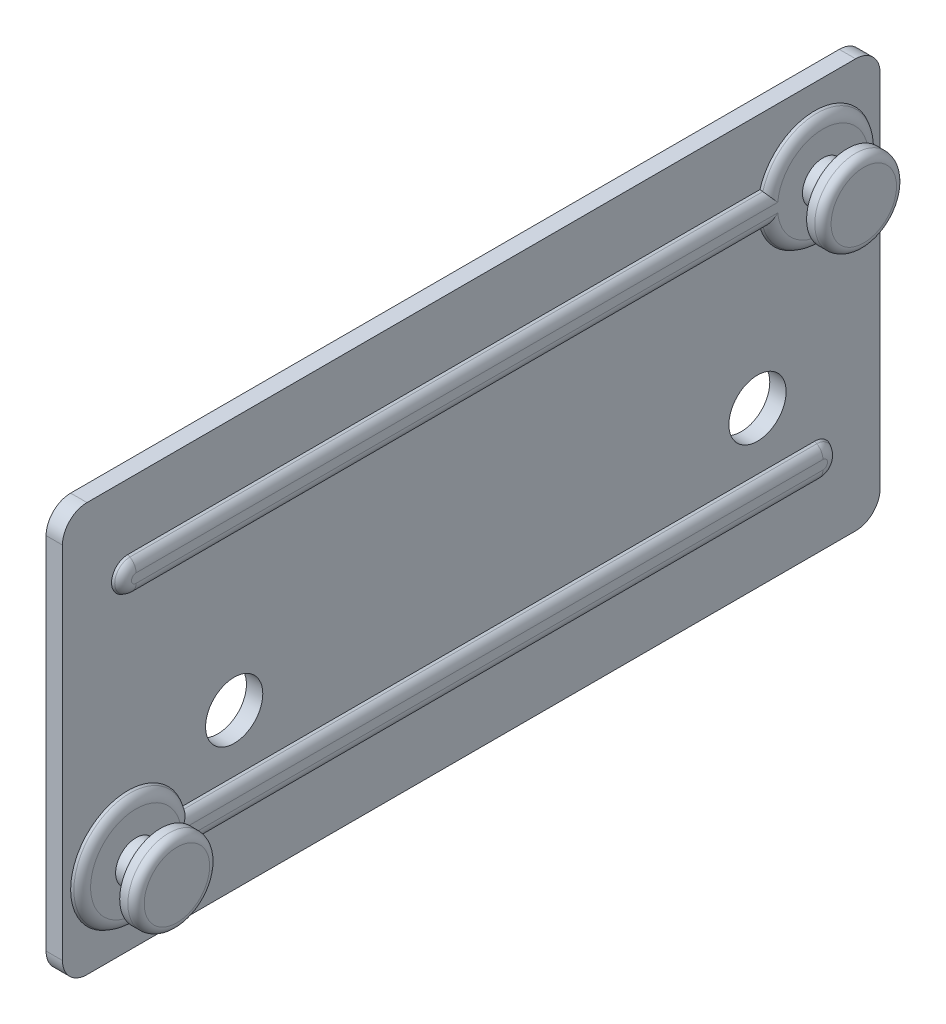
ISO-10303-21;
HEADER;
FILE_DESCRIPTION(('STEP AP214'),'2;1');
FILE_NAME('part.step','',(''),(''),'','','');
FILE_SCHEMA(('AUTOMOTIVE_DESIGN { 1 0 10303 214 1 1 1 1 }'));
ENDSEC;
DATA;
#1=APPLICATION_CONTEXT('core data for automotive mechanical design processes');
#2=APPLICATION_PROTOCOL_DEFINITION('international standard','automotive_design',2000,#1);
#3=PRODUCT_CONTEXT('',#1,'mechanical');
#4=PRODUCT('Part','Part','',(#3));
#5=PRODUCT_RELATED_PRODUCT_CATEGORY('part','',(#4));
#6=PRODUCT_DEFINITION_FORMATION('','',#4);
#7=PRODUCT_DEFINITION_CONTEXT('part definition',#1,'design');
#8=PRODUCT_DEFINITION('design','',#6,#7);
#9=PRODUCT_DEFINITION_SHAPE('','',#8);
#10=(LENGTH_UNIT() NAMED_UNIT(*) SI_UNIT(.MILLI.,.METRE.));
#11=(NAMED_UNIT(*) PLANE_ANGLE_UNIT() SI_UNIT($,.RADIAN.));
#12=(NAMED_UNIT(*) SI_UNIT($,.STERADIAN.) SOLID_ANGLE_UNIT());
#13=UNCERTAINTY_MEASURE_WITH_UNIT(LENGTH_MEASURE(1.E-05),#10,'distance_accuracy_value','');
#14=(GEOMETRIC_REPRESENTATION_CONTEXT(3) GLOBAL_UNCERTAINTY_ASSIGNED_CONTEXT((#13)) GLOBAL_UNIT_ASSIGNED_CONTEXT((#10,
#11,#12)) REPRESENTATION_CONTEXT('',''));
#15=CARTESIAN_POINT('',(0.,0.,0.));
#16=DIRECTION('',(0.,0.,1.));
#17=DIRECTION('',(1.,0.,0.));
#18=AXIS2_PLACEMENT_3D('',#15,#16,#17);
#19=CARTESIAN_POINT('',(3.,40.0000000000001,-91.9999999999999));
#20=DIRECTION('',(0.999999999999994,0.,0.));
#21=DIRECTION('',(0.,0.,-1.));
#22=AXIS2_PLACEMENT_3D('',#19,#20,#21);
#23=PLANE('',#22);
#24=CARTESIAN_POINT('',(3.,40.0000000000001,-91.9999999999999));
#25=DIRECTION('',(0.999999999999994,0.,0.));
#26=DIRECTION('',(0.,0.,-1.));
#27=AXIS2_PLACEMENT_3D('',#24,#25,#26);
#28=CIRCLE('',#27,5.55662432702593);
#29=CARTESIAN_POINT('',(3.,39.4433756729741,-86.4713253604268));
#30=VERTEX_POINT('',#29);
#31=CARTESIAN_POINT('',(3.,40.556624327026,-86.4713253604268));
#32=VERTEX_POINT('',#31);
#33=EDGE_CURVE('E801',#30,#32,#28,.T.);
#34=ORIENTED_EDGE('',*,*,#33,.T.);
#35=DIRECTION('',(0.,0.,-1.));
#36=VECTOR('',#35,1.);
#37=CARTESIAN_POINT('',(3.,40.5566243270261,-8.00000000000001));
#38=LINE('',#37,#36);
#39=CARTESIAN_POINT('',(3.,40.5566243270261,-8.00000000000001));
#40=VERTEX_POINT('',#39);
#41=EDGE_CURVE('E796',#32,#40,#38,.F.);
#42=ORIENTED_EDGE('',*,*,#41,.T.);
#43=CARTESIAN_POINT('',(3.,40.0000000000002,-8.00000000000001));
#44=DIRECTION('',(0.999999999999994,0.,0.));
#45=DIRECTION('',(0.,0.,-1.));
#46=AXIS2_PLACEMENT_3D('',#43,#44,#45);
#47=CIRCLE('',#46,0.556624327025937);
#48=CARTESIAN_POINT('',(3.,39.4433756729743,-8.00000000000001));
#49=VERTEX_POINT('',#48);
#50=EDGE_CURVE('E799',#40,#49,#47,.T.);
#51=ORIENTED_EDGE('',*,*,#50,.T.);
#52=DIRECTION('',(0.,0.,1.));
#53=VECTOR('',#52,1.);
#54=CARTESIAN_POINT('',(3.,39.4433756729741,-85.736893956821));
#55=LINE('',#54,#53);
#56=EDGE_CURVE('E803',#49,#30,#55,.F.);
#57=ORIENTED_EDGE('',*,*,#56,.T.);
#58=EDGE_LOOP('',(#34,#42,#51,#57));
#59=FACE_BOUND('',#58,.T.);
#60=CARTESIAN_POINT('',(3.,40.0000000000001,-91.9999999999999));
#61=DIRECTION('',(0.999999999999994,0.,0.));
#62=DIRECTION('',(0.,0.,-1.));
#63=AXIS2_PLACEMENT_3D('',#60,#61,#62);
#64=CIRCLE('',#63,2.5);
#65=CARTESIAN_POINT('',(3.,40.0000000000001,-89.4999999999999));
#66=VERTEX_POINT('',#65);
#67=EDGE_CURVE('E563',#66,#66,#64,.T.);
#68=ORIENTED_EDGE('',*,*,#67,.F.);
#69=EDGE_LOOP('',(#68));
#70=FACE_BOUND('',#69,.T.);
#71=ADVANCED_FACE('F36',(#59,#70),#23,.T.);
#72=CARTESIAN_POINT('',(3.,10.,-91.9999999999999));
#73=DIRECTION('',(-0.999999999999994,0.,0.));
#74=DIRECTION('',(0.,0.,1.));
#75=AXIS2_PLACEMENT_3D('',#72,#73,#74);
#76=PLANE('',#75);
#77=CARTESIAN_POINT('',(3.,10.,-91.9999999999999));
#78=DIRECTION('',(-0.999999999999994,0.,0.));
#79=DIRECTION('',(0.,0.,1.));
#80=AXIS2_PLACEMENT_3D('',#77,#78,#79);
#81=CIRCLE('',#80,0.556624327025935);
#82=CARTESIAN_POINT('',(3.,9.44337567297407,-91.9999999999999));
#83=VERTEX_POINT('',#82);
#84=CARTESIAN_POINT('',(3.,10.5566243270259,-91.9999999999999));
#85=VERTEX_POINT('',#84);
#86=EDGE_CURVE('E785',#83,#85,#81,.F.);
#87=ORIENTED_EDGE('',*,*,#86,.T.);
#88=DIRECTION('',(0.,0.,-1.));
#89=VECTOR('',#88,1.);
#90=CARTESIAN_POINT('',(3.,10.5566243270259,-91.9999999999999));
#91=LINE('',#90,#89);
#92=CARTESIAN_POINT('',(3.,10.5566243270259,-13.5286746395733));
#93=VERTEX_POINT('',#92);
#94=EDGE_CURVE('E782',#85,#93,#91,.F.);
#95=ORIENTED_EDGE('',*,*,#94,.T.);
#96=CARTESIAN_POINT('',(3.,10.,-8.00000000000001));
#97=DIRECTION('',(-0.999999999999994,0.,0.));
#98=DIRECTION('',(0.,0.,1.));
#99=AXIS2_PLACEMENT_3D('',#96,#97,#98);
#100=CIRCLE('',#99,5.55662432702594);
#101=CARTESIAN_POINT('',(3.,9.44337567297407,-13.5286746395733));
#102=VERTEX_POINT('',#101);
#103=EDGE_CURVE('E787',#93,#102,#100,.F.);
#104=ORIENTED_EDGE('',*,*,#103,.T.);
#105=DIRECTION('',(0.,0.,1.));
#106=VECTOR('',#105,1.);
#107=CARTESIAN_POINT('',(3.,9.44337567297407,-91.9999999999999));
#108=LINE('',#107,#106);
#109=EDGE_CURVE('E789',#102,#83,#108,.F.);
#110=ORIENTED_EDGE('',*,*,#109,.T.);
#111=EDGE_LOOP('',(#87,#95,#104,#110));
#112=FACE_BOUND('',#111,.T.);
#113=CARTESIAN_POINT('',(3.,10.,-8.00000000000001));
#114=DIRECTION('',(-0.999999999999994,0.,0.));
#115=DIRECTION('',(0.,0.,1.));
#116=AXIS2_PLACEMENT_3D('',#113,#114,#115);
#117=CIRCLE('',#116,2.5);
#118=CARTESIAN_POINT('',(3.,10.0000000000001,-5.50000000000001));
#119=VERTEX_POINT('',#118);
#120=EDGE_CURVE('E914',#119,#119,#117,.F.);
#121=ORIENTED_EDGE('',*,*,#120,.F.);
#122=EDGE_LOOP('',(#121));
#123=FACE_BOUND('',#122,.T.);
#124=ADVANCED_FACE('F331',(#112,#123),#76,.F.);
#125=CARTESIAN_POINT('',(2.,50.0000000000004,0.));
#126=DIRECTION('',(-0.999999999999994,0.,0.));
#127=DIRECTION('',(0.,0.,1.));
#128=AXIS2_PLACEMENT_3D('',#125,#126,#127);
#129=PLANE('',#128);
#130=CARTESIAN_POINT('',(2.,19.,-85.));
#131=DIRECTION('',(0.999999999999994,0.,0.));
#132=DIRECTION('',(0.,0.,-1.));
#133=AXIS2_PLACEMENT_3D('',#130,#131,#132);
#134=CIRCLE('',#133,3.49999999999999);
#135=CARTESIAN_POINT('',(2.,19.,-88.5));
#136=VERTEX_POINT('',#135);
#137=EDGE_CURVE('E548',#136,#136,#134,.T.);
#138=ORIENTED_EDGE('',*,*,#137,.F.);
#139=EDGE_LOOP('',(#138));
#140=FACE_BOUND('',#139,.T.);
#141=CARTESIAN_POINT('',(2.,10.,-91.9999999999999));
#142=DIRECTION('',(0.999999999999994,0.,0.));
#143=DIRECTION('',(0.,0.,1.));
#144=AXIS2_PLACEMENT_3D('',#141,#142,#143);
#145=CIRCLE('',#144,2.);
#146=CARTESIAN_POINT('',(2.,8.00000000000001,-91.9999999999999));
#147=VERTEX_POINT('',#146);
#148=CARTESIAN_POINT('',(2.,12.,-91.9999999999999));
#149=VERTEX_POINT('',#148);
#150=EDGE_CURVE('E309',#147,#149,#145,.T.);
#151=ORIENTED_EDGE('',*,*,#150,.F.);
#152=DIRECTION('',(0.,0.,-1.));
#153=VECTOR('',#152,1.);
#154=CARTESIAN_POINT('',(2.,7.99999999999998,-14.7082039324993));
#155=LINE('',#154,#153);
#156=CARTESIAN_POINT('',(2.,7.99999999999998,-14.7082039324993));
#157=VERTEX_POINT('',#156);
#158=EDGE_CURVE('E832',#157,#147,#155,.T.);
#159=ORIENTED_EDGE('',*,*,#158,.F.);
#160=CARTESIAN_POINT('',(2.,10.,-8.00000000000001));
#161=DIRECTION('',(0.999999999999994,0.,0.));
#162=DIRECTION('',(0.,0.,-1.));
#163=AXIS2_PLACEMENT_3D('',#160,#161,#162);
#164=CIRCLE('',#163,7.);
#165=CARTESIAN_POINT('',(2.,12.0000000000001,-14.7082039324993));
#166=VERTEX_POINT('',#165);
#167=EDGE_CURVE('E839',#166,#157,#164,.T.);
#168=ORIENTED_EDGE('',*,*,#167,.F.);
#169=DIRECTION('',(0.,0.,1.));
#170=VECTOR('',#169,1.);
#171=CARTESIAN_POINT('',(2.,12.0000000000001,-14.7082039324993));
#172=LINE('',#171,#170);
#173=EDGE_CURVE('E843',#149,#166,#172,.T.);
#174=ORIENTED_EDGE('',*,*,#173,.F.);
#175=EDGE_LOOP('',(#151,#159,#168,#174));
#176=FACE_BOUND('',#175,.T.);
#177=DIRECTION('',(0.,1.00000000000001,0.));
#178=VECTOR('',#177,1.);
#179=CARTESIAN_POINT('',(2.00000000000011,-1.94289029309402E-13,-99.9999999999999));
#180=LINE('',#179,#178);
#181=CARTESIAN_POINT('',(2.,2.99999999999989,-99.9999999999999));
#182=VERTEX_POINT('',#181);
#183=CARTESIAN_POINT('',(2.,47.0000000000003,-99.9999999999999));
#184=VERTEX_POINT('',#183);
#185=EDGE_CURVE('E808',#182,#184,#180,.T.);
#186=ORIENTED_EDGE('',*,*,#185,.T.);
#187=CARTESIAN_POINT('',(2.,47.0000000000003,-97.));
#188=DIRECTION('',(-0.999999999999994,0.,0.));
#189=DIRECTION('',(0.,0.,1.));
#190=AXIS2_PLACEMENT_3D('',#187,#188,#189);
#191=CIRCLE('',#190,3.);
#192=CARTESIAN_POINT('',(2.,50.0000000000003,-97.));
#193=VERTEX_POINT('',#192);
#194=EDGE_CURVE('E892',#184,#193,#191,.F.);
#195=ORIENTED_EDGE('',*,*,#194,.T.);
#196=DIRECTION('',(0.,0.,1.));
#197=VECTOR('',#196,1.);
#198=CARTESIAN_POINT('',(2.,50.0000000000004,0.));
#199=LINE('',#198,#197);
#200=CARTESIAN_POINT('',(2.,50.0000000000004,-2.99999999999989));
#201=VERTEX_POINT('',#200);
#202=EDGE_CURVE('E805',#193,#201,#199,.T.);
#203=ORIENTED_EDGE('',*,*,#202,.T.);
#204=CARTESIAN_POINT('',(2.,47.0000000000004,-2.99999999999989));
#205=DIRECTION('',(-0.999999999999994,0.,0.));
#206=DIRECTION('',(0.,0.,1.));
#207=AXIS2_PLACEMENT_3D('',#204,#205,#206);
#208=CIRCLE('',#207,3.);
#209=CARTESIAN_POINT('',(2.,47.0000000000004,0.));
#210=VERTEX_POINT('',#209);
#211=EDGE_CURVE('E1291',#201,#210,#208,.F.);
#212=ORIENTED_EDGE('',*,*,#211,.T.);
#213=DIRECTION('',(0.,-1.00000000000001,0.));
#214=VECTOR('',#213,1.);
#215=CARTESIAN_POINT('',(2.,0.,0.));
#216=LINE('',#215,#214);
#217=CARTESIAN_POINT('',(2.,3.00000000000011,0.));
#218=VERTEX_POINT('',#217);
#219=EDGE_CURVE('E813',#210,#218,#216,.T.);
#220=ORIENTED_EDGE('',*,*,#219,.T.);
#221=CARTESIAN_POINT('',(2.,3.,-2.99999999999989));
#222=DIRECTION('',(-0.999999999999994,0.,0.));
#223=DIRECTION('',(0.,0.,1.));
#224=AXIS2_PLACEMENT_3D('',#221,#222,#223);
#225=CIRCLE('',#224,3.);
#226=CARTESIAN_POINT('',(2.,0.,-2.99999999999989));
#227=VERTEX_POINT('',#226);
#228=EDGE_CURVE('E58',#218,#227,#225,.F.);
#229=ORIENTED_EDGE('',*,*,#228,.T.);
#230=DIRECTION('',(0.,0.,-1.));
#231=VECTOR('',#230,1.);
#232=CARTESIAN_POINT('',(2.,0.,0.));
#233=LINE('',#232,#231);
#234=CARTESIAN_POINT('',(2.,-1.94289029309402E-13,-97.));
#235=VERTEX_POINT('',#234);
#236=EDGE_CURVE('E811',#227,#235,#233,.T.);
#237=ORIENTED_EDGE('',*,*,#236,.T.);
#238=CARTESIAN_POINT('',(2.,2.99999999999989,-97.));
#239=DIRECTION('',(-0.999999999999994,0.,0.));
#240=DIRECTION('',(0.,0.,1.));
#241=AXIS2_PLACEMENT_3D('',#238,#239,#240);
#242=CIRCLE('',#241,3.);
#243=EDGE_CURVE('E895',#235,#182,#242,.F.);
#244=ORIENTED_EDGE('',*,*,#243,.T.);
#245=EDGE_LOOP('',(#186,#195,#203,#212,#220,#229,#237,#244));
#246=FACE_BOUND('',#245,.T.);
#247=CARTESIAN_POINT('',(2.,40.0000000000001,-91.9999999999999));
#248=DIRECTION('',(0.999999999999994,0.,0.));
#249=DIRECTION('',(0.,0.,-1.));
#250=AXIS2_PLACEMENT_3D('',#247,#248,#249);
#251=CIRCLE('',#250,7.);
#252=CARTESIAN_POINT('',(2.,38.0000000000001,-85.2917960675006));
#253=VERTEX_POINT('',#252);
#254=CARTESIAN_POINT('',(2.,42.0000000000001,-85.2917960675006));
#255=VERTEX_POINT('',#254);
#256=EDGE_CURVE('E275',#253,#255,#251,.T.);
#257=ORIENTED_EDGE('',*,*,#256,.F.);
#258=DIRECTION('',(0.,0.,-1.));
#259=VECTOR('',#258,1.);
#260=CARTESIAN_POINT('',(2.,38.0000000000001,-85.2917960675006));
#261=LINE('',#260,#259);
#262=CARTESIAN_POINT('',(2.,38.0000000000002,-8.00000000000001));
#263=VERTEX_POINT('',#262);
#264=EDGE_CURVE('E282',#263,#253,#261,.T.);
#265=ORIENTED_EDGE('',*,*,#264,.F.);
#266=CARTESIAN_POINT('',(2.,40.0000000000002,-8.00000000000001));
#267=DIRECTION('',(0.999999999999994,0.,0.));
#268=DIRECTION('',(0.,0.,1.));
#269=AXIS2_PLACEMENT_3D('',#266,#267,#268);
#270=CIRCLE('',#269,2.);
#271=CARTESIAN_POINT('',(2.,42.0000000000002,-8.00000000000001));
#272=VERTEX_POINT('',#271);
#273=EDGE_CURVE('E297',#272,#263,#270,.T.);
#274=ORIENTED_EDGE('',*,*,#273,.F.);
#275=DIRECTION('',(0.,0.,1.));
#276=VECTOR('',#275,1.);
#277=CARTESIAN_POINT('',(2.,42.0000000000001,-85.2917960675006));
#278=LINE('',#277,#276);
#279=EDGE_CURVE('E292',#255,#272,#278,.T.);
#280=ORIENTED_EDGE('',*,*,#279,.F.);
#281=EDGE_LOOP('',(#257,#265,#274,#280));
#282=FACE_BOUND('',#281,.T.);
#283=CARTESIAN_POINT('',(2.,19.0000000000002,-21.0000000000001));
#284=DIRECTION('',(0.999999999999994,0.,0.));
#285=DIRECTION('',(0.,0.,-1.));
#286=AXIS2_PLACEMENT_3D('',#283,#284,#285);
#287=CIRCLE('',#286,3.49999999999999);
#288=CARTESIAN_POINT('',(2.,19.0000000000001,-24.5000000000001));
#289=VERTEX_POINT('',#288);
#290=EDGE_CURVE('E554',#289,#289,#287,.T.);
#291=ORIENTED_EDGE('',*,*,#290,.F.);
#292=EDGE_LOOP('',(#291));
#293=FACE_BOUND('',#292,.T.);
#294=ADVANCED_FACE('F287',(#140,#176,#246,#282,#293),#129,.F.);
#295=CARTESIAN_POINT('',(2.,0.,0.));
#296=DIRECTION('',(0.,0.,-1.));
#297=DIRECTION('',(-0.999999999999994,0.,0.));
#298=AXIS2_PLACEMENT_3D('',#295,#296,#297);
#299=PLANE('',#298);
#300=DIRECTION('',(0.,-1.00000000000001,0.));
#301=VECTOR('',#300,1.);
#302=CARTESIAN_POINT('',(0.,0.,0.));
#303=LINE('',#302,#301);
#304=CARTESIAN_POINT('',(0.,47.0000000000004,0.));
#305=VERTEX_POINT('',#304);
#306=CARTESIAN_POINT('',(0.,3.00000000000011,0.));
#307=VERTEX_POINT('',#306);
#308=EDGE_CURVE('E360',#305,#307,#303,.T.);
#309=ORIENTED_EDGE('',*,*,#308,.T.);
#310=DIRECTION('',(-0.999999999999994,0.,0.));
#311=VECTOR('',#310,1.);
#312=CARTESIAN_POINT('',(2.,3.00000000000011,0.));
#313=LINE('',#312,#311);
#314=EDGE_CURVE('E912',#307,#218,#313,.F.);
#315=ORIENTED_EDGE('',*,*,#314,.T.);
#316=ORIENTED_EDGE('',*,*,#219,.F.);
#317=DIRECTION('',(-0.999999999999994,0.,0.));
#318=VECTOR('',#317,1.);
#319=CARTESIAN_POINT('',(2.,47.0000000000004,0.));
#320=LINE('',#319,#318);
#321=EDGE_CURVE('E910',#210,#305,#320,.T.);
#322=ORIENTED_EDGE('',*,*,#321,.T.);
#323=EDGE_LOOP('',(#309,#315,#316,#322));
#324=FACE_BOUND('',#323,.T.);
#325=ADVANCED_FACE('F38',(#324),#299,.F.);
#326=CARTESIAN_POINT('',(2.,0.,0.));
#327=DIRECTION('',(0.,1.00000000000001,0.));
#328=DIRECTION('',(0.,0.,1.));
#329=AXIS2_PLACEMENT_3D('',#326,#327,#328);
#330=PLANE('',#329);
#331=DIRECTION('',(0.,0.,-1.));
#332=VECTOR('',#331,1.);
#333=CARTESIAN_POINT('',(0.,0.,0.));
#334=LINE('',#333,#332);
#335=CARTESIAN_POINT('',(0.,0.,-2.99999999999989));
#336=VERTEX_POINT('',#335);
#337=CARTESIAN_POINT('',(0.,-1.94289029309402E-13,-97.));
#338=VERTEX_POINT('',#337);
#339=EDGE_CURVE('E820',#336,#338,#334,.T.);
#340=ORIENTED_EDGE('',*,*,#339,.T.);
#341=DIRECTION('',(-0.999999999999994,0.,0.));
#342=VECTOR('',#341,1.);
#343=CARTESIAN_POINT('',(2.,-1.94289029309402E-13,-97.));
#344=LINE('',#343,#342);
#345=EDGE_CURVE('E51',#338,#235,#344,.F.);
#346=ORIENTED_EDGE('',*,*,#345,.T.);
#347=ORIENTED_EDGE('',*,*,#236,.F.);
#348=DIRECTION('',(-0.999999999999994,0.,0.));
#349=VECTOR('',#348,1.);
#350=CARTESIAN_POINT('',(2.,0.,-2.99999999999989));
#351=LINE('',#350,#349);
#352=EDGE_CURVE('E903',#227,#336,#351,.T.);
#353=ORIENTED_EDGE('',*,*,#352,.T.);
#354=EDGE_LOOP('',(#340,#346,#347,#353));
#355=FACE_BOUND('',#354,.T.);
#356=ADVANCED_FACE('F383',(#355),#330,.F.);
#357=CARTESIAN_POINT('',(2.00000000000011,-1.94289029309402E-13,-99.9999999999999));
#358=DIRECTION('',(0.,0.,1.));
#359=DIRECTION('',(0.999999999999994,0.,0.));
#360=AXIS2_PLACEMENT_3D('',#357,#358,#359);
#361=PLANE('',#360);
#362=DIRECTION('',(0.,1.00000000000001,0.));
#363=VECTOR('',#362,1.);
#364=CARTESIAN_POINT('',(1.11022302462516E-13,-1.94289029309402E-13,-99.9999999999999));
#365=LINE('',#364,#363);
#366=CARTESIAN_POINT('',(1.11022302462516E-13,2.99999999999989,-99.9999999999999));
#367=VERTEX_POINT('',#366);
#368=CARTESIAN_POINT('',(0.,47.0000000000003,-99.9999999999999));
#369=VERTEX_POINT('',#368);
#370=EDGE_CURVE('E818',#367,#369,#365,.T.);
#371=ORIENTED_EDGE('',*,*,#370,.T.);
#372=DIRECTION('',(-0.999999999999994,0.,0.));
#373=VECTOR('',#372,1.);
#374=CARTESIAN_POINT('',(2.,47.0000000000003,-99.9999999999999));
#375=LINE('',#374,#373);
#376=EDGE_CURVE('E900',#369,#184,#375,.F.);
#377=ORIENTED_EDGE('',*,*,#376,.T.);
#378=ORIENTED_EDGE('',*,*,#185,.F.);
#379=DIRECTION('',(-0.999999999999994,0.,0.));
#380=VECTOR('',#379,1.);
#381=CARTESIAN_POINT('',(2.,2.99999999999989,-99.9999999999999));
#382=LINE('',#381,#380);
#383=EDGE_CURVE('E1288',#182,#367,#382,.T.);
#384=ORIENTED_EDGE('',*,*,#383,.T.);
#385=EDGE_LOOP('',(#371,#377,#378,#384));
#386=FACE_BOUND('',#385,.T.);
#387=ADVANCED_FACE('F380',(#386),#361,.F.);
#388=CARTESIAN_POINT('',(2.,50.0000000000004,0.));
#389=DIRECTION('',(0.,-1.00000000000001,0.));
#390=DIRECTION('',(0.,0.,-1.));
#391=AXIS2_PLACEMENT_3D('',#388,#389,#390);
#392=PLANE('',#391);
#393=ORIENTED_EDGE('',*,*,#202,.F.);
#394=DIRECTION('',(-0.999999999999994,0.,0.));
#395=VECTOR('',#394,1.);
#396=CARTESIAN_POINT('',(2.,50.0000000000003,-97.));
#397=LINE('',#396,#395);
#398=CARTESIAN_POINT('',(0.,50.0000000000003,-97.));
#399=VERTEX_POINT('',#398);
#400=EDGE_CURVE('E902',#193,#399,#397,.T.);
#401=ORIENTED_EDGE('',*,*,#400,.T.);
#402=DIRECTION('',(0.,0.,1.));
#403=VECTOR('',#402,1.);
#404=CARTESIAN_POINT('',(0.,50.0000000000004,0.));
#405=LINE('',#404,#403);
#406=CARTESIAN_POINT('',(0.,50.0000000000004,-2.99999999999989));
#407=VERTEX_POINT('',#406);
#408=EDGE_CURVE('E815',#399,#407,#405,.T.);
#409=ORIENTED_EDGE('',*,*,#408,.T.);
#410=DIRECTION('',(-0.999999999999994,0.,0.));
#411=VECTOR('',#410,1.);
#412=CARTESIAN_POINT('',(2.,50.0000000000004,-2.99999999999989));
#413=LINE('',#412,#411);
#414=EDGE_CURVE('E1268',#407,#201,#413,.F.);
#415=ORIENTED_EDGE('',*,*,#414,.T.);
#416=EDGE_LOOP('',(#393,#401,#409,#415));
#417=FACE_BOUND('',#416,.T.);
#418=ADVANCED_FACE('F373',(#417),#392,.F.);
#419=CARTESIAN_POINT('',(0.,50.0000000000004,0.));
#420=DIRECTION('',(-0.999999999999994,0.,0.));
#421=DIRECTION('',(0.,0.,1.));
#422=AXIS2_PLACEMENT_3D('',#419,#420,#421);
#423=PLANE('',#422);
#424=CARTESIAN_POINT('',(0.,19.0000000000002,-21.0000000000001));
#425=DIRECTION('',(-0.999999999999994,0.,0.));
#426=DIRECTION('',(0.,0.,1.));
#427=AXIS2_PLACEMENT_3D('',#424,#425,#426);
#428=CIRCLE('',#427,3.49999999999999);
#429=CARTESIAN_POINT('',(0.,19.0000000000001,-24.5000000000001));
#430=VERTEX_POINT('',#429);
#431=EDGE_CURVE('E551',#430,#430,#428,.T.);
#432=ORIENTED_EDGE('',*,*,#431,.F.);
#433=EDGE_LOOP('',(#432));
#434=FACE_BOUND('',#433,.T.);
#435=CARTESIAN_POINT('',(0.,19.,-85.));
#436=DIRECTION('',(-0.999999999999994,0.,0.));
#437=DIRECTION('',(0.,0.,1.));
#438=AXIS2_PLACEMENT_3D('',#435,#436,#437);
#439=CIRCLE('',#438,3.49999999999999);
#440=CARTESIAN_POINT('',(0.,19.,-88.5));
#441=VERTEX_POINT('',#440);
#442=EDGE_CURVE('E545',#441,#441,#439,.T.);
#443=ORIENTED_EDGE('',*,*,#442,.F.);
#444=EDGE_LOOP('',(#443));
#445=FACE_BOUND('',#444,.T.);
#446=CARTESIAN_POINT('',(0.,40.0567283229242,-91.9999999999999));
#447=DIRECTION('',(-0.999999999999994,0.,0.));
#448=DIRECTION('',(0.,0.,1.));
#449=AXIS2_PLACEMENT_3D('',#446,#447,#448);
#450=CIRCLE('',#449,6.57735026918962);
#451=CARTESIAN_POINT('',(1.11022302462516E-13,38.4793780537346,-85.6145867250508));
#452=VERTEX_POINT('',#451);
#453=CARTESIAN_POINT('',(0.,41.6340785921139,-85.6145867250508));
#454=VERTEX_POINT('',#453);
#455=EDGE_CURVE('E754',#452,#454,#450,.F.);
#456=ORIENTED_EDGE('',*,*,#455,.T.);
#457=DIRECTION('',(0.,0.,-1.));
#458=VECTOR('',#457,1.);
#459=CARTESIAN_POINT('',(1.11022302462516E-13,41.6340785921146,-8.00000000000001));
#460=LINE('',#459,#458);
#461=CARTESIAN_POINT('',(1.11022302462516E-13,41.6340785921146,-8.00000000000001));
#462=VERTEX_POINT('',#461);
#463=EDGE_CURVE('E749',#454,#462,#460,.F.);
#464=ORIENTED_EDGE('',*,*,#463,.T.);
#465=CARTESIAN_POINT('',(1.11022302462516E-13,40.0567283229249,-8.00000000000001));
#466=DIRECTION('',(-0.999999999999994,0.,0.));
#467=DIRECTION('',(0.,0.,1.));
#468=AXIS2_PLACEMENT_3D('',#465,#466,#467);
#469=CIRCLE('',#468,1.57735026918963);
#470=CARTESIAN_POINT('',(0.,38.4793780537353,-8.00000000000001));
#471=VERTEX_POINT('',#470);
#472=EDGE_CURVE('E752',#462,#471,#469,.F.);
#473=ORIENTED_EDGE('',*,*,#472,.T.);
#474=DIRECTION('',(0.,0.,1.));
#475=VECTOR('',#474,1.);
#476=CARTESIAN_POINT('',(1.11022302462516E-13,38.4793780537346,-86.0839202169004));
#477=LINE('',#476,#475);
#478=EDGE_CURVE('E756',#471,#452,#477,.F.);
#479=ORIENTED_EDGE('',*,*,#478,.T.);
#480=EDGE_LOOP('',(#456,#464,#473,#479));
#481=FACE_BOUND('',#480,.T.);
#482=CARTESIAN_POINT('',(0.,10.,-91.9999999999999));
#483=DIRECTION('',(-0.999999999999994,0.,0.));
#484=DIRECTION('',(0.,0.,1.));
#485=AXIS2_PLACEMENT_3D('',#482,#483,#484);
#486=CIRCLE('',#485,1.57735026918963);
#487=CARTESIAN_POINT('',(0.,8.42264973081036,-91.9999999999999));
#488=VERTEX_POINT('',#487);
#489=CARTESIAN_POINT('',(0.,11.5773502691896,-91.9999999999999));
#490=VERTEX_POINT('',#489);
#491=EDGE_CURVE('E761',#488,#490,#486,.F.);
#492=ORIENTED_EDGE('',*,*,#491,.T.);
#493=DIRECTION('',(0.,0.,-1.));
#494=VECTOR('',#493,1.);
#495=CARTESIAN_POINT('',(0.,11.5773502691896,-13.9160797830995));
#496=LINE('',#495,#494);
#497=CARTESIAN_POINT('',(0.,11.5773502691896,-14.385413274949));
#498=VERTEX_POINT('',#497);
#499=EDGE_CURVE('E758',#490,#498,#496,.F.);
#500=ORIENTED_EDGE('',*,*,#499,.T.);
#501=CARTESIAN_POINT('',(1.11022302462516E-13,10.,-8.00000000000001));
#502=DIRECTION('',(-0.999999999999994,0.,0.));
#503=DIRECTION('',(0.,0.,1.));
#504=AXIS2_PLACEMENT_3D('',#501,#502,#503);
#505=CIRCLE('',#504,6.57735026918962);
#506=CARTESIAN_POINT('',(1.11022302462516E-13,8.42264973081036,-14.3854132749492));
#507=VERTEX_POINT('',#506);
#508=EDGE_CURVE('E763',#498,#507,#505,.F.);
#509=ORIENTED_EDGE('',*,*,#508,.T.);
#510=DIRECTION('',(0.,0.,1.));
#511=VECTOR('',#510,1.);
#512=CARTESIAN_POINT('',(0.,8.42264973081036,-91.9999999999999));
#513=LINE('',#512,#511);
#514=EDGE_CURVE('E765',#507,#488,#513,.F.);
#515=ORIENTED_EDGE('',*,*,#514,.T.);
#516=EDGE_LOOP('',(#492,#500,#509,#515));
#517=FACE_BOUND('',#516,.T.);
#518=ORIENTED_EDGE('',*,*,#408,.F.);
#519=CARTESIAN_POINT('',(0.,47.0000000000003,-97.));
#520=DIRECTION('',(-0.999999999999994,0.,0.));
#521=DIRECTION('',(0.,0.,1.));
#522=AXIS2_PLACEMENT_3D('',#519,#520,#521);
#523=CIRCLE('',#522,3.);
#524=EDGE_CURVE('E1286',#399,#369,#523,.T.);
#525=ORIENTED_EDGE('',*,*,#524,.T.);
#526=ORIENTED_EDGE('',*,*,#370,.F.);
#527=CARTESIAN_POINT('',(1.11022302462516E-13,2.99999999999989,-97.));
#528=DIRECTION('',(-0.999999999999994,0.,0.));
#529=DIRECTION('',(0.,0.,1.));
#530=AXIS2_PLACEMENT_3D('',#527,#528,#529);
#531=CIRCLE('',#530,3.);
#532=EDGE_CURVE('E1284',#367,#338,#531,.T.);
#533=ORIENTED_EDGE('',*,*,#532,.T.);
#534=ORIENTED_EDGE('',*,*,#339,.F.);
#535=CARTESIAN_POINT('',(0.,3.,-2.99999999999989));
#536=DIRECTION('',(-0.999999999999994,0.,0.));
#537=DIRECTION('',(0.,0.,1.));
#538=AXIS2_PLACEMENT_3D('',#535,#536,#537);
#539=CIRCLE('',#538,3.);
#540=EDGE_CURVE('E1282',#336,#307,#539,.T.);
#541=ORIENTED_EDGE('',*,*,#540,.T.);
#542=ORIENTED_EDGE('',*,*,#308,.F.);
#543=CARTESIAN_POINT('',(0.,47.0000000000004,-2.99999999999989));
#544=DIRECTION('',(-0.999999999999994,0.,0.));
#545=DIRECTION('',(0.,0.,1.));
#546=AXIS2_PLACEMENT_3D('',#543,#544,#545);
#547=CIRCLE('',#546,3.);
#548=EDGE_CURVE('E1280',#305,#407,#547,.T.);
#549=ORIENTED_EDGE('',*,*,#548,.T.);
#550=EDGE_LOOP('',(#518,#525,#526,#533,#534,#541,#542,#549));
#551=FACE_BOUND('',#550,.T.);
#552=ADVANCED_FACE('F369',(#434,#445,#481,#517,#551),#423,.T.);
#553=CARTESIAN_POINT('',(2.,10.,-91.9999999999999));
#554=DIRECTION('',(-0.999999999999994,0.,0.));
#555=DIRECTION('',(0.,0.,1.));
#556=AXIS2_PLACEMENT_3D('',#553,#554,#555);
#557=CONICAL_SURFACE('',#556,2.,0.5235987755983);
#558=DIRECTION('',(-0.866025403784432,0.500000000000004,0.));
#559=VECTOR('',#558,1.);
#560=CARTESIAN_POINT('',(2.,12.,-91.9999999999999));
#561=LINE('',#560,#559);
#562=CARTESIAN_POINT('',(2.24999999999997,11.8556624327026,-91.9999999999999));
#563=VERTEX_POINT('',#562);
#564=EDGE_CURVE('E359',#563,#149,#561,.T.);
#565=ORIENTED_EDGE('',*,*,#564,.F.);
#566=CARTESIAN_POINT('',(2.24999999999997,10.,-91.9999999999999));
#567=DIRECTION('',(0.999999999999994,0.,0.));
#568=DIRECTION('',(0.,0.,-1.));
#569=AXIS2_PLACEMENT_3D('',#566,#567,#568);
#570=CIRCLE('',#569,1.85566243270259);
#571=CARTESIAN_POINT('',(2.24999999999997,8.14433756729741,-91.9999999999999));
#572=VERTEX_POINT('',#571);
#573=EDGE_CURVE('E777',#563,#572,#570,.F.);
#574=ORIENTED_EDGE('',*,*,#573,.T.);
#575=DIRECTION('',(-0.866025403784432,-0.500000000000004,0.));
#576=VECTOR('',#575,1.);
#577=CARTESIAN_POINT('',(2.,8.00000000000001,-91.9999999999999));
#578=LINE('',#577,#576);
#579=EDGE_CURVE('E834',#572,#147,#578,.T.);
#580=ORIENTED_EDGE('',*,*,#579,.T.);
#581=ORIENTED_EDGE('',*,*,#150,.T.);
#582=EDGE_LOOP('',(#565,#574,#580,#581));
#583=FACE_BOUND('',#582,.T.);
#584=ADVANCED_FACE('F365',(#583),#557,.T.);
#585=CARTESIAN_POINT('',(2.,12.0000000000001,-14.7082039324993));
#586=DIRECTION('',(0.499999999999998,0.866025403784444,0.));
#587=DIRECTION('',(-0.866025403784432,0.500000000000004,0.));
#588=AXIS2_PLACEMENT_3D('',#585,#586,#587);
#589=PLANE('',#588);
#590=CARTESIAN_POINT('',(3.,11.4226497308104,-14.2631060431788));
#591=CARTESIAN_POINT('',(2.91705025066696,11.4705407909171,-14.3013383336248));
#592=CARTESIAN_POINT('',(2.83399649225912,11.5184919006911,-14.3392692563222));
#593=CARTESIAN_POINT('',(2.66769548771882,11.6145058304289,-14.4145519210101));
#594=CARTESIAN_POINT('',(2.58444824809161,11.662568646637,-14.4519036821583));
#595=CARTESIAN_POINT('',(2.41776961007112,11.7588006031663,-14.5260539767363));
#596=CARTESIAN_POINT('',(2.33433821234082,11.8069697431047,-14.5628525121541));
#597=CARTESIAN_POINT('',(2.16729851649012,11.9034101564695,-14.6359200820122));
#598=CARTESIAN_POINT('',(2.08369021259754,11.9516814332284,-14.6721890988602));
#599=CARTESIAN_POINT('',(2.00000000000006,12.0000000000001,-14.7082039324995));
#600=B_SPLINE_CURVE_WITH_KNOTS('',3,(#590,#591,#592,#593,#594,#595,#596,#597,#598,#599),
.UNSPECIFIED.,.F.,.F.,(4,2,2,2,4),(0.,0.309391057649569,0.618771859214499,0.928151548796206,
1.23754149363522),.UNSPECIFIED.);
#601=CARTESIAN_POINT('',(2.25000000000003,11.8556624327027,-14.5997442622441));
#602=VERTEX_POINT('',#601);
#603=EDGE_CURVE('E353',#602,#166,#600,.T.);
#604=ORIENTED_EDGE('',*,*,#603,.F.);
#605=DIRECTION('',(0.,0.,1.));
#606=VECTOR('',#605,1.);
#607=CARTESIAN_POINT('',(2.24999999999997,11.8556624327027,-14.7082039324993));
#608=LINE('',#607,#606);
#609=EDGE_CURVE('E779',#602,#563,#608,.F.);
#610=ORIENTED_EDGE('',*,*,#609,.T.);
#611=ORIENTED_EDGE('',*,*,#564,.T.);
#612=ORIENTED_EDGE('',*,*,#173,.T.);
#613=EDGE_LOOP('',(#604,#610,#611,#612));
#614=FACE_BOUND('',#613,.T.);
#615=ADVANCED_FACE('F340',(#614),#589,.T.);
#616=CARTESIAN_POINT('',(2.,10.,-8.00000000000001));
#617=DIRECTION('',(-0.999999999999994,0.,0.));
#618=DIRECTION('',(0.,0.,-1.));
#619=AXIS2_PLACEMENT_3D('',#616,#617,#618);
#620=CONICAL_SURFACE('',#619,7.,0.5235987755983);
#621=CARTESIAN_POINT('',(3.,8.57735026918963,-14.2631060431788));
#622=CARTESIAN_POINT('',(2.91705025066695,8.52945920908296,-14.3013383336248));
#623=CARTESIAN_POINT('',(2.8339964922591,8.48150809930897,-14.3392692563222));
#624=CARTESIAN_POINT('',(2.6676954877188,8.38549416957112,-14.4145519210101));
#625=CARTESIAN_POINT('',(2.5844482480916,8.33743135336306,-14.4519036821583));
#626=CARTESIAN_POINT('',(2.41776961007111,8.24119939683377,-14.5260539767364));
#627=CARTESIAN_POINT('',(2.33433821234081,8.19303025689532,-14.5628525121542));
#628=CARTESIAN_POINT('',(2.16729851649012,8.09658984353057,-14.6359200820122));
#629=CARTESIAN_POINT('',(2.08369021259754,8.0483185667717,-14.6721890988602));
#630=CARTESIAN_POINT('',(2.00000000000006,8.00000000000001,-14.7082039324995));
#631=B_SPLINE_CURVE_WITH_KNOTS('',3,(#621,#622,#623,#624,#625,#626,#627,#628,#629,#630),
.UNSPECIFIED.,.F.,.F.,(4,2,2,2,4),(0.,0.309391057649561,0.618771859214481,0.928151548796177,
1.23754149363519),.UNSPECIFIED.);
#632=CARTESIAN_POINT('',(2.25000000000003,8.14433756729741,-14.5997442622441));
#633=VERTEX_POINT('',#632);
#634=EDGE_CURVE('E346',#633,#157,#631,.T.);
#635=ORIENTED_EDGE('',*,*,#634,.F.);
#636=CARTESIAN_POINT('',(2.25000000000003,10.,-8.00000000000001));
#637=DIRECTION('',(0.999999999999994,0.,0.));
#638=DIRECTION('',(0.,0.,-1.));
#639=AXIS2_PLACEMENT_3D('',#636,#637,#638);
#640=CIRCLE('',#639,6.85566243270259);
#641=EDGE_CURVE('E772',#633,#602,#640,.F.);
#642=ORIENTED_EDGE('',*,*,#641,.T.);
#643=ORIENTED_EDGE('',*,*,#603,.T.);
#644=ORIENTED_EDGE('',*,*,#167,.T.);
#645=EDGE_LOOP('',(#635,#642,#643,#644));
#646=FACE_BOUND('',#645,.T.);
#647=ADVANCED_FACE('F335',(#646),#620,.T.);
#648=CARTESIAN_POINT('',(2.,7.99999999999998,-14.7082039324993));
#649=DIRECTION('',(0.499999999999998,-0.866025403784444,0.));
#650=DIRECTION('',(0.866025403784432,0.500000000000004,0.));
#651=AXIS2_PLACEMENT_3D('',#648,#649,#650);
#652=PLANE('',#651);
#653=ORIENTED_EDGE('',*,*,#579,.F.);
#654=DIRECTION('',(0.,0.,-1.));
#655=VECTOR('',#654,1.);
#656=CARTESIAN_POINT('',(2.25000000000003,8.14433756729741,-14.7082039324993));
#657=LINE('',#656,#655);
#658=EDGE_CURVE('E770',#572,#633,#657,.F.);
#659=ORIENTED_EDGE('',*,*,#658,.T.);
#660=ORIENTED_EDGE('',*,*,#634,.T.);
#661=ORIENTED_EDGE('',*,*,#158,.T.);
#662=EDGE_LOOP('',(#653,#659,#660,#661));
#663=FACE_BOUND('',#662,.T.);
#664=ADVANCED_FACE('F339',(#663),#652,.T.);
#665=CARTESIAN_POINT('',(2.,40.0000000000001,-91.9999999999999));
#666=DIRECTION('',(-0.999999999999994,0.,0.));
#667=DIRECTION('',(0.,0.,-1.));
#668=AXIS2_PLACEMENT_3D('',#665,#666,#667);
#669=CONICAL_SURFACE('',#668,7.,0.5235987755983);
#670=CARTESIAN_POINT('',(3.,41.4226497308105,-85.736893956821));
#671=CARTESIAN_POINT('',(2.91705025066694,41.4705407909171,-85.698661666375));
#672=CARTESIAN_POINT('',(2.83399649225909,41.5184919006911,-85.6607307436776));
#673=CARTESIAN_POINT('',(2.6676954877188,41.614505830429,-85.5854480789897));
#674=CARTESIAN_POINT('',(2.58444824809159,41.662568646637,-85.5480963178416));
#675=CARTESIAN_POINT('',(2.41776961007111,41.7588006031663,-85.4739460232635));
#676=CARTESIAN_POINT('',(2.33433821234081,41.8069697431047,-85.4371474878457));
#677=CARTESIAN_POINT('',(2.16729851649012,41.9034101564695,-85.3640799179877));
#678=CARTESIAN_POINT('',(2.08369021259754,41.9516814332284,-85.3278109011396));
#679=CARTESIAN_POINT('',(2.00000000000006,42.0000000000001,-85.2917960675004));
#680=B_SPLINE_CURVE_WITH_KNOTS('',3,(#670,#671,#672,#673,#674,#675,#676,#677,#678,#679),
.UNSPECIFIED.,.F.,.F.,(4,2,2,2,4),(0.,0.309391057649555,0.618771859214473,0.92815154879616,
1.23754149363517),.UNSPECIFIED.);
#681=CARTESIAN_POINT('',(2.24999999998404,41.8556624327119,-85.4002557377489));
#682=VERTEX_POINT('',#681);
#683=EDGE_CURVE('E302',#682,#255,#680,.T.);
#684=ORIENTED_EDGE('',*,*,#683,.F.);
#685=CARTESIAN_POINT('',(2.24999999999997,40.0000000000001,-91.9999999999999));
#686=DIRECTION('',(-0.999999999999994,0.,0.));
#687=DIRECTION('',(0.,0.,1.));
#688=AXIS2_PLACEMENT_3D('',#685,#686,#687);
#689=CIRCLE('',#688,6.85566243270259);
#690=CARTESIAN_POINT('',(2.24999999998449,38.1443375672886,-85.4002557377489));
#691=VERTEX_POINT('',#690);
#692=EDGE_CURVE('E277',#682,#691,#689,.T.);
#693=ORIENTED_EDGE('',*,*,#692,.T.);
#694=CARTESIAN_POINT('',(3.,38.5773502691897,-85.736893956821));
#695=CARTESIAN_POINT('',(2.91705025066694,38.5294592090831,-85.698661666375));
#696=CARTESIAN_POINT('',(2.83399649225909,38.4815080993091,-85.6607307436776));
#697=CARTESIAN_POINT('',(2.66769548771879,38.3854941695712,-85.5854480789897));
#698=CARTESIAN_POINT('',(2.58444824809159,38.3374313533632,-85.5480963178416));
#699=CARTESIAN_POINT('',(2.4177696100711,38.2411993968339,-85.4739460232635));
#700=CARTESIAN_POINT('',(2.33433821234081,38.1930302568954,-85.4371474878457));
#701=CARTESIAN_POINT('',(2.16729851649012,38.0965898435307,-85.3640799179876));
#702=CARTESIAN_POINT('',(2.08369021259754,38.0483185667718,-85.3278109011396));
#703=CARTESIAN_POINT('',(2.00000000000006,38.0000000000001,-85.2917960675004));
#704=B_SPLINE_CURVE_WITH_KNOTS('',3,(#694,#695,#696,#697,#698,#699,#700,#701,#702,#703),
.UNSPECIFIED.,.F.,.F.,(4,2,2,2,4),(0.,0.309391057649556,0.61877185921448,0.928151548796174,
1.23754149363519),.UNSPECIFIED.);
#705=EDGE_CURVE('E271',#691,#253,#704,.T.);
#706=ORIENTED_EDGE('',*,*,#705,.T.);
#707=ORIENTED_EDGE('',*,*,#256,.T.);
#708=EDGE_LOOP('',(#684,#693,#706,#707));
#709=FACE_BOUND('',#708,.T.);
#710=ADVANCED_FACE('F274',(#709),#669,.T.);
#711=CARTESIAN_POINT('',(2.,42.0000000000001,-85.2917960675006));
#712=DIRECTION('',(0.499999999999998,0.866025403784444,0.));
#713=DIRECTION('',(-0.866025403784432,0.500000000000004,0.));
#714=AXIS2_PLACEMENT_3D('',#711,#712,#713);
#715=PLANE('',#714);
#716=DIRECTION('',(-0.866025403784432,0.500000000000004,0.));
#717=VECTOR('',#716,1.);
#718=CARTESIAN_POINT('',(2.,42.0000000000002,-8.00000000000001));
#719=LINE('',#718,#717);
#720=CARTESIAN_POINT('',(2.24999999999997,41.8556624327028,-8.00000000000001));
#721=VERTEX_POINT('',#720);
#722=EDGE_CURVE('E310',#721,#272,#719,.T.);
#723=ORIENTED_EDGE('',*,*,#722,.F.);
#724=DIRECTION('',(0.,0.,1.));
#725=VECTOR('',#724,1.);
#726=CARTESIAN_POINT('',(2.24999999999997,41.8556624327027,-85.736893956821));
#727=LINE('',#726,#725);
#728=EDGE_CURVE('E793',#721,#682,#727,.F.);
#729=ORIENTED_EDGE('',*,*,#728,.T.);
#730=ORIENTED_EDGE('',*,*,#683,.T.);
#731=ORIENTED_EDGE('',*,*,#279,.T.);
#732=EDGE_LOOP('',(#723,#729,#730,#731));
#733=FACE_BOUND('',#732,.T.);
#734=ADVANCED_FACE('F319',(#733),#715,.T.);
#735=CARTESIAN_POINT('',(2.,40.0000000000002,-8.00000000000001));
#736=DIRECTION('',(-0.999999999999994,0.,0.));
#737=DIRECTION('',(0.,0.,1.));
#738=AXIS2_PLACEMENT_3D('',#735,#736,#737);
#739=CONICAL_SURFACE('',#738,2.,0.5235987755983);
#740=DIRECTION('',(-0.866025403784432,-0.500000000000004,0.));
#741=VECTOR('',#740,1.);
#742=CARTESIAN_POINT('',(2.,38.0000000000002,-8.00000000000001));
#743=LINE('',#742,#741);
#744=CARTESIAN_POINT('',(2.24999999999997,38.1443375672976,-8.00000000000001));
#745=VERTEX_POINT('',#744);
#746=EDGE_CURVE('E281',#745,#263,#743,.T.);
#747=ORIENTED_EDGE('',*,*,#746,.F.);
#748=CARTESIAN_POINT('',(2.24999999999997,40.0000000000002,-8.00000000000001));
#749=DIRECTION('',(-0.999999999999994,0.,0.));
#750=DIRECTION('',(0.,0.,1.));
#751=AXIS2_PLACEMENT_3D('',#748,#749,#750);
#752=CIRCLE('',#751,1.85566243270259);
#753=EDGE_CURVE('E791',#745,#721,#752,.T.);
#754=ORIENTED_EDGE('',*,*,#753,.T.);
#755=ORIENTED_EDGE('',*,*,#722,.T.);
#756=ORIENTED_EDGE('',*,*,#273,.T.);
#757=EDGE_LOOP('',(#747,#754,#755,#756));
#758=FACE_BOUND('',#757,.T.);
#759=ADVANCED_FACE('F322',(#758),#739,.T.);
#760=CARTESIAN_POINT('',(2.,38.0000000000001,-85.2917960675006));
#761=DIRECTION('',(0.499999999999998,-0.866025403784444,0.));
#762=DIRECTION('',(0.866025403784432,0.500000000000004,0.));
#763=AXIS2_PLACEMENT_3D('',#760,#761,#762);
#764=PLANE('',#763);
#765=ORIENTED_EDGE('',*,*,#705,.F.);
#766=DIRECTION('',(0.,0.,-1.));
#767=VECTOR('',#766,1.);
#768=CARTESIAN_POINT('',(2.24999999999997,38.1443375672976,-8.00000000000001));
#769=LINE('',#768,#767);
#770=EDGE_CURVE('E774',#691,#745,#769,.F.);
#771=ORIENTED_EDGE('',*,*,#770,.T.);
#772=ORIENTED_EDGE('',*,*,#746,.T.);
#773=ORIENTED_EDGE('',*,*,#264,.T.);
#774=EDGE_LOOP('',(#765,#771,#772,#773));
#775=FACE_BOUND('',#774,.T.);
#776=ADVANCED_FACE('F295',(#775),#764,.T.);
#777=CARTESIAN_POINT('',(1.5,39.4433756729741,-91.9999999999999));
#778=DIRECTION('',(0.,0.,-1.));
#779=DIRECTION('',(-0.999999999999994,0.,0.));
#780=AXIS2_PLACEMENT_3D('',#777,#778,#779);
#781=CYLINDRICAL_SURFACE('',#780,1.5);
#782=CARTESIAN_POINT('',(1.50000000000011,39.4433756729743,-8.00000000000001));
#783=DIRECTION('',(0.,0.,1.));
#784=DIRECTION('',(0.999999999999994,0.,0.));
#785=AXIS2_PLACEMENT_3D('',#782,#783,#784);
#786=CIRCLE('',#785,1.5);
#787=EDGE_CURVE('E410',#745,#49,#786,.T.);
#788=ORIENTED_EDGE('',*,*,#787,.F.);
#789=ORIENTED_EDGE('',*,*,#770,.F.);
#790=CARTESIAN_POINT('',(2.24999999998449,38.1443375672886,-85.4002557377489));
#791=CARTESIAN_POINT('',(2.32697611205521,38.1887572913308,-85.4338981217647));
#792=CARTESIAN_POINT('',(2.39809603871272,38.2389407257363,-85.4721823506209));
#793=CARTESIAN_POINT('',(2.52774531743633,38.3475636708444,-85.5559283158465));
#794=CARTESIAN_POINT('',(2.58637229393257,38.4059327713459,-85.60132919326));
#795=CARTESIAN_POINT('',(2.69115872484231,38.5281659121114,-85.6975674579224));
#796=CARTESIAN_POINT('',(2.73737854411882,38.5920012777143,-85.7483767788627));
#797=CARTESIAN_POINT('',(2.81823119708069,38.7234897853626,-85.8544389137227));
#798=CARTESIAN_POINT('',(2.8528324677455,38.7911527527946,-85.9097033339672));
#799=CARTESIAN_POINT('',(2.91662296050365,38.9421947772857,-86.0348755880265));
#800=CARTESIAN_POINT('',(2.94334791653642,39.0260118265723,-86.1055023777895));
#801=CARTESIAN_POINT('',(2.98165556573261,39.1941402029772,-86.2498868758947));
#802=CARTESIAN_POINT('',(2.99326045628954,39.2784506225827,-86.3236398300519));
#803=CARTESIAN_POINT('',(2.99916652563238,39.3873654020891,-86.4208552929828));
#804=CARTESIAN_POINT('',(2.99989258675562,39.4125236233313,-86.4434472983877));
#805=CARTESIAN_POINT('',(2.99999631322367,39.4395355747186,-86.4678532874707));
#806=CARTESIAN_POINT('',(2.99999999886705,39.4414558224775,-86.4695890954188));
#807=CARTESIAN_POINT('',(3.,39.4433756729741,-86.4713253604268));
#808=B_SPLINE_CURVE_WITH_KNOTS('',3,(#790,#791,#792,#793,#794,#795,#796,#797,#798,#799,#800,
#801,#802,#803,#804,#805,#806,#807),.UNSPECIFIED.,.F.,.F.,(4,2,2,2,2,2,2,2,4),(0.,
0.284040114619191,0.565771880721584,0.846107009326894,1.12719765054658,1.46447437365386,
1.80125538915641,1.90270456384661,1.91047009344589),.UNSPECIFIED.);
#809=EDGE_CURVE('E293',#30,#691,#808,.F.);
#810=ORIENTED_EDGE('',*,*,#809,.F.);
#811=ORIENTED_EDGE('',*,*,#56,.F.);
#812=EDGE_LOOP('',(#788,#789,#810,#811));
#813=FACE_BOUND('',#812,.T.);
#814=ADVANCED_FACE('F327',(#813),#781,.T.);
#815=CARTESIAN_POINT('',(1.5,40.0000000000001,-91.9999999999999));
#816=DIRECTION('',(0.999999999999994,0.,0.));
#817=DIRECTION('',(0.,0.,-1.));
#818=AXIS2_PLACEMENT_3D('',#815,#816,#817);
#819=TOROIDAL_SURFACE('',#818,5.55662432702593,1.5);
#820=ORIENTED_EDGE('',*,*,#809,.T.);
#821=ORIENTED_EDGE('',*,*,#692,.F.);
#822=CARTESIAN_POINT('',(2.24999999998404,41.8556624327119,-85.4002557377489));
#823=CARTESIAN_POINT('',(2.32697611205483,41.8112427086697,-85.4338981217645));
#824=CARTESIAN_POINT('',(2.39809603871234,41.7610592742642,-85.4721823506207));
#825=CARTESIAN_POINT('',(2.52774531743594,41.6524363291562,-85.5559283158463));
#826=CARTESIAN_POINT('',(2.58637229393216,41.5940672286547,-85.6013291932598));
#827=CARTESIAN_POINT('',(2.69115872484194,41.4718340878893,-85.6975674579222));
#828=CARTESIAN_POINT('',(2.73737854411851,41.4079987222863,-85.7483767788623));
#829=CARTESIAN_POINT('',(2.81823119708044,41.2765102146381,-85.8544389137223));
#830=CARTESIAN_POINT('',(2.85283246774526,41.2088472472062,-85.9097033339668));
#831=CARTESIAN_POINT('',(2.91662296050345,41.057805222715,-86.034875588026));
#832=CARTESIAN_POINT('',(2.94334791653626,40.9739881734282,-86.1055023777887));
#833=CARTESIAN_POINT('',(2.98165556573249,40.8058597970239,-86.2498868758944));
#834=CARTESIAN_POINT('',(2.99326045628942,40.7215493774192,-86.3236398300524));
#835=CARTESIAN_POINT('',(2.99916652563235,40.6126345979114,-86.4208552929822));
#836=CARTESIAN_POINT('',(2.99989258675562,40.5874763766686,-86.4434472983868));
#837=CARTESIAN_POINT('',(2.99999631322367,40.5604644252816,-86.4678532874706));
#838=CARTESIAN_POINT('',(2.99999999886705,40.5585441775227,-86.4695890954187));
#839=CARTESIAN_POINT('',(3.,40.556624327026,-86.4713253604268));
#840=B_SPLINE_CURVE_WITH_KNOTS('',3,(#822,#823,#824,#825,#826,#827,#828,#829,#830,#831,#832,
#833,#834,#835,#836,#837,#838,#839),.UNSPECIFIED.,.F.,.F.,(4,2,2,2,2,2,2,2,4),(0.,
0.284040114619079,0.565771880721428,0.846107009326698,1.12719765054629,1.46447437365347,
1.80125538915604,1.90270456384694,1.91047009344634),.UNSPECIFIED.);
#841=EDGE_CURVE('E420',#32,#682,#840,.F.);
#842=ORIENTED_EDGE('',*,*,#841,.F.);
#843=ORIENTED_EDGE('',*,*,#33,.F.);
#844=EDGE_LOOP('',(#820,#821,#842,#843));
#845=FACE_BOUND('',#844,.T.);
#846=ADVANCED_FACE('F399',(#845),#819,.T.);
#847=CARTESIAN_POINT('',(1.5,40.0000000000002,-8.00000000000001));
#848=DIRECTION('',(0.999999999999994,0.,0.));
#849=DIRECTION('',(0.,0.,-1.));
#850=AXIS2_PLACEMENT_3D('',#847,#848,#849);
#851=DEGENERATE_TOROIDAL_SURFACE('',#850,0.556624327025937,1.5,.T.);
#852=ORIENTED_EDGE('',*,*,#787,.T.);
#853=ORIENTED_EDGE('',*,*,#50,.F.);
#854=CARTESIAN_POINT('',(1.5,40.5566243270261,-8.00000000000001));
#855=DIRECTION('',(0.,0.,-1.));
#856=DIRECTION('',(-0.999999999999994,0.,0.));
#857=AXIS2_PLACEMENT_3D('',#854,#855,#856);
#858=CIRCLE('',#857,1.5);
#859=EDGE_CURVE('E426',#721,#40,#858,.T.);
#860=ORIENTED_EDGE('',*,*,#859,.F.);
#861=ORIENTED_EDGE('',*,*,#753,.F.);
#862=EDGE_LOOP('',(#852,#853,#860,#861));
#863=FACE_BOUND('',#862,.T.);
#864=ADVANCED_FACE('F401',(#863),#851,.T.);
#865=CARTESIAN_POINT('',(1.5,40.556624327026,-91.9999999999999));
#866=DIRECTION('',(0.,0.,1.));
#867=DIRECTION('',(0.,-1.00000000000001,0.));
#868=AXIS2_PLACEMENT_3D('',#865,#866,#867);
#869=CYLINDRICAL_SURFACE('',#868,1.5);
#870=ORIENTED_EDGE('',*,*,#841,.T.);
#871=ORIENTED_EDGE('',*,*,#728,.F.);
#872=ORIENTED_EDGE('',*,*,#859,.T.);
#873=ORIENTED_EDGE('',*,*,#41,.F.);
#874=EDGE_LOOP('',(#870,#871,#872,#873));
#875=FACE_BOUND('',#874,.T.);
#876=ADVANCED_FACE('F416',(#875),#869,.T.);
#877=CARTESIAN_POINT('',(1.5,9.44337567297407,-91.9999999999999));
#878=DIRECTION('',(0.,0.,1.));
#879=DIRECTION('',(0.999999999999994,0.,0.));
#880=AXIS2_PLACEMENT_3D('',#877,#878,#879);
#881=CYLINDRICAL_SURFACE('',#880,1.5);
#882=CARTESIAN_POINT('',(2.25000000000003,8.14433756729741,-14.5997442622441));
#883=CARTESIAN_POINT('',(2.32697611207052,8.1887572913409,-14.5661018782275));
#884=CARTESIAN_POINT('',(2.39809603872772,8.23894072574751,-14.5278176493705));
#885=CARTESIAN_POINT('',(2.52774531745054,8.34756367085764,-14.4440716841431));
#886=CARTESIAN_POINT('',(2.58637229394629,8.40593277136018,-14.3986708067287));
#887=CARTESIAN_POINT('',(2.69115872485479,8.5281659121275,-14.3024325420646));
#888=CARTESIAN_POINT('',(2.73737854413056,8.59200127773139,-14.2516232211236));
#889=CARTESIAN_POINT('',(2.81823119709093,8.72348978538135,-14.145561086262));
#890=CARTESIAN_POINT('',(2.85283246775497,8.79115275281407,-14.0902966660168));
#891=CARTESIAN_POINT('',(2.91662296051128,8.94219477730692,-13.9651244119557));
#892=CARTESIAN_POINT('',(2.9433479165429,9.02601182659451,-13.8944976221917));
#893=CARTESIAN_POINT('',(2.9816555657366,9.19414020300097,-13.7501131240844));
#894=CARTESIAN_POINT('',(2.9932604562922,9.27845062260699,-13.676360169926));
#895=CARTESIAN_POINT('',(2.99916652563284,9.38736540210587,-13.579144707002));
#896=CARTESIAN_POINT('',(2.99989258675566,9.41252362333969,-13.5565527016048));
#897=CARTESIAN_POINT('',(2.99999631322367,9.43953557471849,-13.5321467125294));
#898=CARTESIAN_POINT('',(2.99999999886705,9.44145582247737,-13.5304109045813));
#899=CARTESIAN_POINT('',(3.,9.44337567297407,-13.5286746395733));
#900=B_SPLINE_CURVE_WITH_KNOTS('',3,(#882,#883,#884,#885,#886,#887,#888,#889,#890,#891,#892,
#893,#894,#895,#896,#897,#898,#899),.UNSPECIFIED.,.F.,.F.,(4,2,2,2,2,2,2,2,4),(0.,
0.284040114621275,0.565771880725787,0.84610700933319,1.12719765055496,1.46447437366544,
1.80125538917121,1.90270456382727,1.91047009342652),.UNSPECIFIED.);
#901=EDGE_CURVE('E431',#633,#102,#900,.T.);
#902=ORIENTED_EDGE('',*,*,#901,.F.);
#903=ORIENTED_EDGE('',*,*,#658,.F.);
#904=CARTESIAN_POINT('',(1.5,9.44337567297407,-91.9999999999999));
#905=DIRECTION('',(0.,0.,-1.));
#906=DIRECTION('',(-0.999999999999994,0.,0.));
#907=AXIS2_PLACEMENT_3D('',#904,#905,#906);
#908=CIRCLE('',#907,1.5);
#909=EDGE_CURVE('E428',#83,#572,#908,.T.);
#910=ORIENTED_EDGE('',*,*,#909,.F.);
#911=ORIENTED_EDGE('',*,*,#109,.F.);
#912=EDGE_LOOP('',(#902,#903,#910,#911));
#913=FACE_BOUND('',#912,.T.);
#914=ADVANCED_FACE('F442',(#913),#881,.T.);
#915=CARTESIAN_POINT('',(1.5,10.,-91.9999999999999));
#916=DIRECTION('',(-0.999999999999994,0.,0.));
#917=DIRECTION('',(0.,0.,1.));
#918=AXIS2_PLACEMENT_3D('',#915,#916,#917);
#919=DEGENERATE_TOROIDAL_SURFACE('',#918,0.556624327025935,1.5,.T.);
#920=ORIENTED_EDGE('',*,*,#909,.T.);
#921=ORIENTED_EDGE('',*,*,#573,.F.);
#922=CARTESIAN_POINT('',(1.5,10.5566243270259,-91.9999999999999));
#923=DIRECTION('',(0.,0.,1.));
#924=DIRECTION('',(0.999999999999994,0.,0.));
#925=AXIS2_PLACEMENT_3D('',#922,#923,#924);
#926=CIRCLE('',#925,1.5);
#927=EDGE_CURVE('E440',#85,#563,#926,.T.);
#928=ORIENTED_EDGE('',*,*,#927,.F.);
#929=ORIENTED_EDGE('',*,*,#86,.F.);
#930=EDGE_LOOP('',(#920,#921,#928,#929));
#931=FACE_BOUND('',#930,.T.);
#932=ADVANCED_FACE('F450',(#931),#919,.T.);
#933=CARTESIAN_POINT('',(1.5,10.,-8.00000000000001));
#934=DIRECTION('',(-0.999999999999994,0.,0.));
#935=DIRECTION('',(0.,0.,1.));
#936=AXIS2_PLACEMENT_3D('',#933,#934,#935);
#937=TOROIDAL_SURFACE('',#936,5.55662432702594,1.5);
#938=ORIENTED_EDGE('',*,*,#901,.T.);
#939=ORIENTED_EDGE('',*,*,#103,.F.);
#940=CARTESIAN_POINT('',(2.25000000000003,11.8556624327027,-14.5997442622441));
#941=CARTESIAN_POINT('',(2.32697611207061,11.8112427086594,-14.5661018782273));
#942=CARTESIAN_POINT('',(2.39809603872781,11.7610592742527,-14.5278176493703));
#943=CARTESIAN_POINT('',(2.52774531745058,11.6524363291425,-14.444071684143));
#944=CARTESIAN_POINT('',(2.58637229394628,11.5940672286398,-14.3986708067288));
#945=CARTESIAN_POINT('',(2.69115872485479,11.4718340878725,-14.3024325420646));
#946=CARTESIAN_POINT('',(2.73737854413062,11.4079987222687,-14.2516232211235));
#947=CARTESIAN_POINT('',(2.81823119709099,11.2765102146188,-14.1455610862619));
#948=CARTESIAN_POINT('',(2.85283246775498,11.2088472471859,-14.0902966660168));
#949=CARTESIAN_POINT('',(2.91662296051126,11.057805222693,-13.9651244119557));
#950=CARTESIAN_POINT('',(2.94334791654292,10.9739881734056,-13.8944976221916));
#951=CARTESIAN_POINT('',(2.98165556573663,10.8058597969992,-13.7501131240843));
#952=CARTESIAN_POINT('',(2.9932604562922,10.721549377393,-13.676360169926));
#953=CARTESIAN_POINT('',(2.99916652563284,10.6126345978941,-13.579144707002));
#954=CARTESIAN_POINT('',(2.99989258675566,10.5874763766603,-13.5565527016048));
#955=CARTESIAN_POINT('',(2.99999631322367,10.5604644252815,-13.5321467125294));
#956=CARTESIAN_POINT('',(2.99999999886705,10.5585441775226,-13.5304109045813));
#957=CARTESIAN_POINT('',(3.,10.5566243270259,-13.5286746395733));
#958=B_SPLINE_CURVE_WITH_KNOTS('',3,(#940,#941,#942,#943,#944,#945,#946,#947,#948,#949,#950,
#951,#952,#953,#954,#955,#956,#957),.UNSPECIFIED.,.F.,.F.,(4,2,2,2,2,2,2,2,4),(0.,
0.284040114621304,0.565771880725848,0.846107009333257,1.12719765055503,1.46447437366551,
1.80125538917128,1.90270456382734,1.91047009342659),.UNSPECIFIED.);
#959=EDGE_CURVE('E456',#602,#93,#958,.T.);
#960=ORIENTED_EDGE('',*,*,#959,.F.);
#961=ORIENTED_EDGE('',*,*,#641,.F.);
#962=EDGE_LOOP('',(#938,#939,#960,#961));
#963=FACE_BOUND('',#962,.T.);
#964=ADVANCED_FACE('F445',(#963),#937,.T.);
#965=CARTESIAN_POINT('',(1.5,10.5566243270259,-91.9999999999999));
#966=DIRECTION('',(0.,0.,-1.));
#967=DIRECTION('',(0.,1.00000000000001,0.));
#968=AXIS2_PLACEMENT_3D('',#965,#966,#967);
#969=CYLINDRICAL_SURFACE('',#968,1.5);
#970=ORIENTED_EDGE('',*,*,#927,.T.);
#971=ORIENTED_EDGE('',*,*,#609,.F.);
#972=ORIENTED_EDGE('',*,*,#959,.T.);
#973=ORIENTED_EDGE('',*,*,#94,.F.);
#974=EDGE_LOOP('',(#970,#971,#972,#973));
#975=FACE_BOUND('',#974,.T.);
#976=ADVANCED_FACE('F449',(#975),#969,.T.);
#977=CARTESIAN_POINT('',(1.11022302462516E-13,41.0567283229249,-8.00000000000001));
#978=DIRECTION('',(0.499999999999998,0.866025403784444,0.));
#979=DIRECTION('',(-0.866025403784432,0.500000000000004,0.));
#980=AXIS2_PLACEMENT_3D('',#977,#978,#979);
#981=PLANE('',#980);
#982=CARTESIAN_POINT('',(0.5,40.7680531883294,-86.333144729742));
#983=CARTESIAN_POINT('',(0.544512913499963,40.7423536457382,-86.3557736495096));
#984=CARTESIAN_POINT('',(0.58754112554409,40.7175112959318,-86.3824848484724));
#985=CARTESIAN_POINT('',(0.669437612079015,40.670228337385,-86.4437060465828));
#986=CARTESIAN_POINT('',(0.708289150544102,40.6477973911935,-86.4782458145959));
#987=CARTESIAN_POINT('',(0.780385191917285,40.6061727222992,-86.5546913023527));
#988=CARTESIAN_POINT('',(0.813612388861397,40.5869889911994,-86.5966189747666));
#989=CARTESIAN_POINT('',(0.872858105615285,40.5527834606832,-86.6867247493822));
#990=CARTESIAN_POINT('',(0.898888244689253,40.5377549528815,-86.7348925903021));
#991=CARTESIAN_POINT('',(0.940959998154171,40.5134648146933,-86.8323667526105));
#992=CARTESIAN_POINT('',(0.957591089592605,40.5038628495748,-86.8813345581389));
#993=CARTESIAN_POINT('',(0.982899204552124,40.48925120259,-86.9819134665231));
#994=CARTESIAN_POINT('',(0.991588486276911,40.4842344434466,-87.0335203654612));
#995=CARTESIAN_POINT('',(0.99744603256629,40.4808525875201,-87.1000971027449));
#996=CARTESIAN_POINT('',(0.998405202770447,40.4802988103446,-87.1147039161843));
#997=CARTESIAN_POINT('',(0.999681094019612,40.4795621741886,-87.1439281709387));
#998=CARTESIAN_POINT('',(0.999998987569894,40.4793786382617,-87.1585455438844));
#999=CARTESIAN_POINT('',(1.,40.4793780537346,-87.1731693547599));
#1000=B_SPLINE_CURVE_WITH_KNOTS('',3,(#982,#983,#984,#985,#986,#987,#988,#989,#990,#991,#992,
#993,#994,#995,#996,#997,#998,#999),.UNSPECIFIED.,.F.,.F.,(4,2,2,2,2,2,2,2,4),(0.,
0.168428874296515,0.337509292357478,0.507100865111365,0.67641702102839,0.833399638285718,
0.990139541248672,1.03407377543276,1.07792760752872),.UNSPECIFIED.);
#1001=CARTESIAN_POINT('',(0.500000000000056,40.7680531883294,-86.333144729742));
#1002=VERTEX_POINT('',#1001);
#1003=CARTESIAN_POINT('',(0.749999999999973,40.623715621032,-86.5225296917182));
#1004=VERTEX_POINT('',#1003);
#1005=EDGE_CURVE('E712',#1002,#1004,#1000,.T.);
#1006=ORIENTED_EDGE('',*,*,#1005,.T.);
#1007=DIRECTION('',(0.,0.,-1.));
#1008=VECTOR('',#1007,1.);
#1009=CARTESIAN_POINT('',(0.750000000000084,40.6237156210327,-8.00000000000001));
#1010=LINE('',#1009,#1008);
#1011=CARTESIAN_POINT('',(0.750000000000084,40.6237156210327,-8.00000000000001));
#1012=VERTEX_POINT('',#1011);
#1013=EDGE_CURVE('E1234',#1004,#1012,#1010,.F.);
#1014=ORIENTED_EDGE('',*,*,#1013,.T.);
#1015=DIRECTION('',(-0.866025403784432,0.500000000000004,0.));
#1016=VECTOR('',#1015,1.);
#1017=CARTESIAN_POINT('',(1.11022302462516E-13,41.0567283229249,-8.00000000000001));
#1018=LINE('',#1017,#1016);
#1019=CARTESIAN_POINT('',(0.500000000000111,40.7680531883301,-8.00000000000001));
#1020=VERTEX_POINT('',#1019);
#1021=EDGE_CURVE('E462',#1012,#1020,#1018,.T.);
#1022=ORIENTED_EDGE('',*,*,#1021,.T.);
#1023=DIRECTION('',(0.,0.,-1.));
#1024=VECTOR('',#1023,1.);
#1025=CARTESIAN_POINT('',(0.5,40.7680531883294,-86.0839202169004));
#1026=LINE('',#1025,#1024);
#1027=EDGE_CURVE('E767',#1020,#1002,#1026,.T.);
#1028=ORIENTED_EDGE('',*,*,#1027,.T.);
#1029=EDGE_LOOP('',(#1006,#1014,#1022,#1028));
#1030=FACE_BOUND('',#1029,.T.);
#1031=ADVANCED_FACE('F707',(#1030),#981,.F.);
#1032=CARTESIAN_POINT('',(1.11022302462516E-13,40.0567283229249,-8.00000000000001));
#1033=DIRECTION('',(-0.999999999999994,0.,0.));
#1034=DIRECTION('',(0.,0.,1.));
#1035=AXIS2_PLACEMENT_3D('',#1032,#1033,#1034);
#1036=CONICAL_SURFACE('',#1035,1.,0.5235987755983);
#1037=ORIENTED_EDGE('',*,*,#1021,.F.);
#1038=CARTESIAN_POINT('',(0.750000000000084,40.0567283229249,-8.00000000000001));
#1039=DIRECTION('',(0.999999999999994,0.,0.));
#1040=DIRECTION('',(0.,0.,-1.));
#1041=AXIS2_PLACEMENT_3D('',#1038,#1039,#1040);
#1042=CIRCLE('',#1041,0.566987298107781);
#1043=CARTESIAN_POINT('',(0.750000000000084,39.4897410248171,-8.00000000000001));
#1044=VERTEX_POINT('',#1043);
#1045=EDGE_CURVE('E1227',#1012,#1044,#1042,.T.);
#1046=ORIENTED_EDGE('',*,*,#1045,.T.);
#1047=DIRECTION('',(-0.866025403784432,-0.500000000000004,0.));
#1048=VECTOR('',#1047,1.);
#1049=CARTESIAN_POINT('',(1.11022302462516E-13,39.0567283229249,-8.00000000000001));
#1050=LINE('',#1049,#1048);
#1051=CARTESIAN_POINT('',(0.500000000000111,39.3454034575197,-8.00000000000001));
#1052=VERTEX_POINT('',#1051);
#1053=EDGE_CURVE('E464',#1044,#1052,#1050,.T.);
#1054=ORIENTED_EDGE('',*,*,#1053,.T.);
#1055=CARTESIAN_POINT('',(0.500000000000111,40.0567283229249,-8.00000000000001));
#1056=DIRECTION('',(-0.999999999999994,0.,0.));
#1057=DIRECTION('',(0.,0.,1.));
#1058=AXIS2_PLACEMENT_3D('',#1055,#1056,#1057);
#1059=CIRCLE('',#1058,0.711324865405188);
#1060=EDGE_CURVE('E746',#1052,#1020,#1059,.T.);
#1061=ORIENTED_EDGE('',*,*,#1060,.T.);
#1062=EDGE_LOOP('',(#1037,#1046,#1054,#1061));
#1063=FACE_BOUND('',#1062,.T.);
#1064=ADVANCED_FACE('F452',(#1063),#1036,.F.);
#1065=CARTESIAN_POINT('',(1.11022302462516E-13,39.0567283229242,-86.0839202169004));
#1066=DIRECTION('',(0.499999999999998,-0.866025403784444,0.));
#1067=DIRECTION('',(0.866025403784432,0.500000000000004,0.));
#1068=AXIS2_PLACEMENT_3D('',#1065,#1066,#1067);
#1069=PLANE('',#1068);
#1070=ORIENTED_EDGE('',*,*,#1053,.F.);
#1071=DIRECTION('',(0.,0.,1.));
#1072=VECTOR('',#1071,1.);
#1073=CARTESIAN_POINT('',(0.750000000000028,39.4897410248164,-86.0839202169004));
#1074=LINE('',#1073,#1072);
#1075=CARTESIAN_POINT('',(0.750000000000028,39.4897410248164,-86.5225296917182));
#1076=VERTEX_POINT('',#1075);
#1077=EDGE_CURVE('E1239',#1044,#1076,#1074,.F.);
#1078=ORIENTED_EDGE('',*,*,#1077,.T.);
#1079=CARTESIAN_POINT('',(1.,39.6340785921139,-87.1731693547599));
#1080=CARTESIAN_POINT('',(1.00000132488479,39.6340793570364,-87.1484803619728));
#1081=CARTESIAN_POINT('',(0.999091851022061,39.6335542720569,-87.1238022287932));
#1082=CARTESIAN_POINT('',(0.995452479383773,39.6314530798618,-87.0746280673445));
#1083=CARTESIAN_POINT('',(0.99272274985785,39.6298770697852,-87.0501320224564));
#1084=CARTESIAN_POINT('',(0.9818305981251,39.6235884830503,-86.9773239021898));
#1085=CARTESIAN_POINT('',(0.970965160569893,39.617315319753,-86.929513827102));
#1086=CARTESIAN_POINT('',(0.942403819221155,39.6008254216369,-86.8367231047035));
#1087=CARTESIAN_POINT('',(0.924706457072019,39.5906078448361,-86.7917430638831));
#1088=CARTESIAN_POINT('',(0.883156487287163,39.566618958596,-86.7057447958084));
#1089=CARTESIAN_POINT('',(0.859302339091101,39.5528467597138,-86.6647275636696));
#1090=CARTESIAN_POINT('',(0.805714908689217,39.521908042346,-86.5867203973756));
#1091=CARTESIAN_POINT('',(0.775863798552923,39.5046734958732,-86.549838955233));
#1092=CARTESIAN_POINT('',(0.711597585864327,39.4675693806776,-86.481813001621));
#1093=CARTESIAN_POINT('',(0.677181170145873,39.4476990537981,-86.4506701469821));
#1094=CARTESIAN_POINT('',(0.618672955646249,39.4139193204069,-86.4053088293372));
#1095=CARTESIAN_POINT('',(0.595671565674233,39.4006394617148,-86.3891750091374));
#1096=CARTESIAN_POINT('',(0.548599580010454,39.3734624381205,-86.3593446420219));
#1097=CARTESIAN_POINT('',(0.52453233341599,39.3595672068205,-86.3456410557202));
#1098=CARTESIAN_POINT('',(0.499999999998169,39.345403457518,-86.3331447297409));
#1099=B_SPLINE_CURVE_WITH_KNOTS('',3,(#1079,#1080,#1081,#1082,#1083,#1084,#1085,#1086,#1087,
#1088,#1089,#1090,#1091,#1092,#1093,#1094,#1095,#1096,#1097,#1098),.UNSPECIFIED.,.F.,.F.,(4,2,2,
2,2,2,2,2,2,4),(0.,0.0740223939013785,0.148037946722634,0.295542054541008,0.44307766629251,
0.590650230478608,0.741470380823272,0.892334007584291,0.98545236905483,1.07829643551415),.UNSPECIFIED.);
#1100=CARTESIAN_POINT('',(0.499999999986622,39.3454034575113,-86.3331447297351));
#1101=VERTEX_POINT('',#1100);
#1102=EDGE_CURVE('E719',#1076,#1101,#1099,.T.);
#1103=ORIENTED_EDGE('',*,*,#1102,.T.);
#1104=DIRECTION('',(0.,0.,1.));
#1105=VECTOR('',#1104,1.);
#1106=CARTESIAN_POINT('',(0.500000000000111,39.3454034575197,-8.00000000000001));
#1107=LINE('',#1106,#1105);
#1108=EDGE_CURVE('E734',#1101,#1052,#1107,.T.);
#1109=ORIENTED_EDGE('',*,*,#1108,.T.);
#1110=EDGE_LOOP('',(#1070,#1078,#1103,#1109));
#1111=FACE_BOUND('',#1110,.T.);
#1112=ADVANCED_FACE('F705',(#1111),#1069,.F.);
#1113=CARTESIAN_POINT('',(1.,40.0567283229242,-91.9999999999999));
#1114=DIRECTION('',(-0.999999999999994,0.,0.));
#1115=DIRECTION('',(0.,0.,1.));
#1116=AXIS2_PLACEMENT_3D('',#1113,#1114,#1115);
#1117=PLANE('',#1116);
#1118=CARTESIAN_POINT('',(1.,40.0567283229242,-91.9999999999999));
#1119=DIRECTION('',(-0.999999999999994,0.,0.));
#1120=DIRECTION('',(0.,0.,1.));
#1121=AXIS2_PLACEMENT_3D('',#1118,#1119,#1120);
#1122=CIRCLE('',#1121,4.84529946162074);
#1123=CARTESIAN_POINT('',(1.,40.1907029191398,-87.1565531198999));
#1124=VERTEX_POINT('',#1123);
#1125=CARTESIAN_POINT('',(1.,39.9227537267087,-87.1565531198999));
#1126=VERTEX_POINT('',#1125);
#1127=EDGE_CURVE('E727',#1124,#1126,#1122,.T.);
#1128=ORIENTED_EDGE('',*,*,#1127,.T.);
#1129=DIRECTION('',(0.,0.,1.));
#1130=VECTOR('',#1129,1.);
#1131=CARTESIAN_POINT('',(1.,39.9227537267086,-91.9999999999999));
#1132=LINE('',#1131,#1130);
#1133=CARTESIAN_POINT('',(1.00000000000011,39.9227537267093,-8.00000000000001));
#1134=VERTEX_POINT('',#1133);
#1135=EDGE_CURVE('E1244',#1126,#1134,#1132,.T.);
#1136=ORIENTED_EDGE('',*,*,#1135,.T.);
#1137=CARTESIAN_POINT('',(1.00000000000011,40.0567283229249,-8.00000000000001));
#1138=DIRECTION('',(-0.999999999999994,0.,0.));
#1139=DIRECTION('',(0.,0.,1.));
#1140=AXIS2_PLACEMENT_3D('',#1137,#1138,#1139);
#1141=CIRCLE('',#1140,0.133974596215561);
#1142=CARTESIAN_POINT('',(1.00000000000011,40.1907029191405,-8.00000000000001));
#1143=VERTEX_POINT('',#1142);
#1144=EDGE_CURVE('E1266',#1134,#1143,#1141,.T.);
#1145=ORIENTED_EDGE('',*,*,#1144,.T.);
#1146=DIRECTION('',(0.,0.,-1.));
#1147=VECTOR('',#1146,1.);
#1148=CARTESIAN_POINT('',(1.,40.1907029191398,-91.9999999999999));
#1149=LINE('',#1148,#1147);
#1150=EDGE_CURVE('E685',#1143,#1124,#1149,.T.);
#1151=ORIENTED_EDGE('',*,*,#1150,.T.);
#1152=EDGE_LOOP('',(#1128,#1136,#1145,#1151));
#1153=FACE_BOUND('',#1152,.T.);
#1154=ADVANCED_FACE('F692',(#1153),#1117,.T.);
#1155=CARTESIAN_POINT('',(0.,9.00000000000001,-91.9999999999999));
#1156=DIRECTION('',(0.499999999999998,-0.866025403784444,0.));
#1157=DIRECTION('',(0.866025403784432,0.500000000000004,0.));
#1158=AXIS2_PLACEMENT_3D('',#1155,#1156,#1157);
#1159=PLANE('',#1158);
#1160=CARTESIAN_POINT('',(0.5,9.28867513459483,-13.6668552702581));
#1161=CARTESIAN_POINT('',(0.544512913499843,9.31437467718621,-13.6442263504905));
#1162=CARTESIAN_POINT('',(0.587541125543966,9.33921702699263,-13.6175151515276));
#1163=CARTESIAN_POINT('',(0.669437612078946,9.38649998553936,-13.5562939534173));
#1164=CARTESIAN_POINT('',(0.708289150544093,9.40893093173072,-13.5217541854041));
#1165=CARTESIAN_POINT('',(0.780385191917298,9.45055560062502,-13.4453086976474));
#1166=CARTESIAN_POINT('',(0.813612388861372,9.46973933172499,-13.4033810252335));
#1167=CARTESIAN_POINT('',(0.872858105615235,9.50394486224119,-13.313275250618));
#1168=CARTESIAN_POINT('',(0.898888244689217,9.51897337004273,-13.265107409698));
#1169=CARTESIAN_POINT('',(0.940959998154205,9.54326350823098,-13.1676332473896));
#1170=CARTESIAN_POINT('',(0.95759108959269,9.55286547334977,-13.1186654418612));
#1171=CARTESIAN_POINT('',(0.982899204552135,9.56747712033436,-13.0180865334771));
#1172=CARTESIAN_POINT('',(0.991588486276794,9.57249387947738,-12.9664796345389));
#1173=CARTESIAN_POINT('',(0.997446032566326,9.57587573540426,-12.8999028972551));
#1174=CARTESIAN_POINT('',(0.998405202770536,9.57642951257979,-12.8852960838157));
#1175=CARTESIAN_POINT('',(0.999681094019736,9.57716614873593,-12.8560718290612));
#1176=CARTESIAN_POINT('',(0.999998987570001,9.57734968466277,-12.8414544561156));
#1177=CARTESIAN_POINT('',(1.,9.57735026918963,-12.8268306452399));
#1178=B_SPLINE_CURVE_WITH_KNOTS('',3,(#1160,#1161,#1162,#1163,#1164,#1165,#1166,#1167,#1168,
#1169,#1170,#1171,#1172,#1173,#1174,#1175,#1176,#1177),.UNSPECIFIED.,.F.,.F.,(4,2,2,2,2,2,2,2,
4),(0.,0.168428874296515,0.337509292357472,0.507100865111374,0.676417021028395,
0.833399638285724,0.990139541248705,1.0340737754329,1.07792760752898),.UNSPECIFIED.);
#1179=CARTESIAN_POINT('',(0.500000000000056,9.28867513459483,-13.6668552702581));
#1180=VERTEX_POINT('',#1179);
#1181=CARTESIAN_POINT('',(0.749999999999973,9.4330127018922,-13.4774703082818));
#1182=VERTEX_POINT('',#1181);
#1183=EDGE_CURVE('E677',#1180,#1182,#1178,.T.);
#1184=ORIENTED_EDGE('',*,*,#1183,.T.);
#1185=DIRECTION('',(0.,0.,1.));
#1186=VECTOR('',#1185,1.);
#1187=CARTESIAN_POINT('',(0.750000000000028,9.43301270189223,-91.9999999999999));
#1188=LINE('',#1187,#1186);
#1189=CARTESIAN_POINT('',(0.750000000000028,9.4330127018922,-91.9999999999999));
#1190=VERTEX_POINT('',#1189);
#1191=EDGE_CURVE('E1256',#1182,#1190,#1188,.F.);
#1192=ORIENTED_EDGE('',*,*,#1191,.T.);
#1193=DIRECTION('',(-0.866025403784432,-0.500000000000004,0.));
#1194=VECTOR('',#1193,1.);
#1195=CARTESIAN_POINT('',(0.,9.00000000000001,-91.9999999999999));
#1196=LINE('',#1195,#1194);
#1197=CARTESIAN_POINT('',(0.5,9.2886751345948,-91.9999999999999));
#1198=VERTEX_POINT('',#1197);
#1199=EDGE_CURVE('E466',#1190,#1198,#1196,.T.);
#1200=ORIENTED_EDGE('',*,*,#1199,.T.);
#1201=DIRECTION('',(0.,0.,1.));
#1202=VECTOR('',#1201,1.);
#1203=CARTESIAN_POINT('',(0.5,9.2886751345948,-13.9160797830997));
#1204=LINE('',#1203,#1202);
#1205=EDGE_CURVE('E729',#1198,#1180,#1204,.T.);
#1206=ORIENTED_EDGE('',*,*,#1205,.T.);
#1207=EDGE_LOOP('',(#1184,#1192,#1200,#1206));
#1208=FACE_BOUND('',#1207,.T.);
#1209=ADVANCED_FACE('F687',(#1208),#1159,.F.);
#1210=CARTESIAN_POINT('',(0.,10.,-91.9999999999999));
#1211=DIRECTION('',(-0.999999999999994,0.,0.));
#1212=DIRECTION('',(0.,0.,1.));
#1213=AXIS2_PLACEMENT_3D('',#1210,#1211,#1212);
#1214=CONICAL_SURFACE('',#1213,1.,0.5235987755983);
#1215=ORIENTED_EDGE('',*,*,#1199,.F.);
#1216=CARTESIAN_POINT('',(0.750000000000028,10.,-91.9999999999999));
#1217=DIRECTION('',(0.999999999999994,0.,0.));
#1218=DIRECTION('',(0.,0.,-1.));
#1219=AXIS2_PLACEMENT_3D('',#1216,#1217,#1218);
#1220=CIRCLE('',#1219,0.566987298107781);
#1221=CARTESIAN_POINT('',(0.750000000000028,10.5669872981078,-91.9999999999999));
#1222=VERTEX_POINT('',#1221);
#1223=EDGE_CURVE('E1254',#1190,#1222,#1220,.T.);
#1224=ORIENTED_EDGE('',*,*,#1223,.T.);
#1225=DIRECTION('',(-0.866025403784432,0.500000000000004,0.));
#1226=VECTOR('',#1225,1.);
#1227=CARTESIAN_POINT('',(0.,11.,-91.9999999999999));
#1228=LINE('',#1227,#1226);
#1229=CARTESIAN_POINT('',(0.5,10.7113248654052,-91.9999999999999));
#1230=VERTEX_POINT('',#1229);
#1231=EDGE_CURVE('E468',#1222,#1230,#1228,.T.);
#1232=ORIENTED_EDGE('',*,*,#1231,.T.);
#1233=CARTESIAN_POINT('',(0.5,10.,-91.9999999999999));
#1234=DIRECTION('',(-0.999999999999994,0.,0.));
#1235=DIRECTION('',(0.,0.,1.));
#1236=AXIS2_PLACEMENT_3D('',#1233,#1234,#1235);
#1237=CIRCLE('',#1236,0.711324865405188);
#1238=EDGE_CURVE('E740',#1230,#1198,#1237,.T.);
#1239=ORIENTED_EDGE('',*,*,#1238,.T.);
#1240=EDGE_LOOP('',(#1215,#1224,#1232,#1239));
#1241=FACE_BOUND('',#1240,.T.);
#1242=ADVANCED_FACE('F691',(#1241),#1214,.F.);
#1243=CARTESIAN_POINT('',(0.,11.,-13.9160797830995));
#1244=DIRECTION('',(0.499999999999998,0.866025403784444,0.));
#1245=DIRECTION('',(-0.866025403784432,0.500000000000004,0.));
#1246=AXIS2_PLACEMENT_3D('',#1243,#1244,#1245);
#1247=PLANE('',#1246);
#1248=ORIENTED_EDGE('',*,*,#1231,.F.);
#1249=DIRECTION('',(0.,0.,-1.));
#1250=VECTOR('',#1249,1.);
#1251=CARTESIAN_POINT('',(0.750000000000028,10.5669872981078,-13.9160797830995));
#1252=LINE('',#1251,#1250);
#1253=CARTESIAN_POINT('',(0.750000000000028,10.5669872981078,-13.4774703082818));
#1254=VERTEX_POINT('',#1253);
#1255=EDGE_CURVE('E1252',#1222,#1254,#1252,.F.);
#1256=ORIENTED_EDGE('',*,*,#1255,.T.);
#1257=CARTESIAN_POINT('',(1.,10.4226497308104,-12.8268306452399));
#1258=CARTESIAN_POINT('',(1.00000132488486,10.4226489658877,-12.8515196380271));
#1259=CARTESIAN_POINT('',(0.999091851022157,10.4231740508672,-12.8761977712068));
#1260=CARTESIAN_POINT('',(0.99545247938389,10.4252752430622,-12.9253719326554));
#1261=CARTESIAN_POINT('',(0.992722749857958,10.4268512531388,-12.9498679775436));
#1262=CARTESIAN_POINT('',(0.98183059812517,10.4331398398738,-13.0226760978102));
#1263=CARTESIAN_POINT('',(0.97096516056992,10.4394130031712,-13.0704861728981));
#1264=CARTESIAN_POINT('',(0.94240381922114,10.4559029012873,-13.1632768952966));
#1265=CARTESIAN_POINT('',(0.92470645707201,10.4661204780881,-13.2082569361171));
#1266=CARTESIAN_POINT('',(0.883156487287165,10.4901093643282,-13.2942552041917));
#1267=CARTESIAN_POINT('',(0.859302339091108,10.5038815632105,-13.3352724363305));
#1268=CARTESIAN_POINT('',(0.805714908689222,10.5348202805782,-13.4132796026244));
#1269=CARTESIAN_POINT('',(0.775863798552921,10.552054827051,-13.450161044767));
#1270=CARTESIAN_POINT('',(0.711597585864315,10.5891589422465,-13.5181869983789));
#1271=CARTESIAN_POINT('',(0.677181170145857,10.6090292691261,-13.5493298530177));
#1272=CARTESIAN_POINT('',(0.618672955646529,10.6428090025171,-13.5946911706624));
#1273=CARTESIAN_POINT('',(0.595671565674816,10.656088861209,-13.6108249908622));
#1274=CARTESIAN_POINT('',(0.548599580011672,10.6832658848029,-13.6406553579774));
#1275=CARTESIAN_POINT('',(0.52453233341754,10.6971611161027,-13.654358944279));
#1276=CARTESIAN_POINT('',(0.500000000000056,10.7113248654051,-13.6668552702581));
#1277=B_SPLINE_CURVE_WITH_KNOTS('',3,(#1257,#1258,#1259,#1260,#1261,#1262,#1263,#1264,#1265,
#1266,#1267,#1268,#1269,#1270,#1271,#1272,#1273,#1274,#1275,#1276),.UNSPECIFIED.,.F.,.F.,(4,2,2,
2,2,2,2,2,2,4),(0.,0.074022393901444,0.148037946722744,0.295542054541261,0.443077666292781,
0.59065023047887,0.741470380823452,0.892334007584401,0.985452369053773,1.07829643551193),.UNSPECIFIED.);
#1278=CARTESIAN_POINT('',(0.500000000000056,10.7113248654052,-13.6668552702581));
#1279=VERTEX_POINT('',#1278);
#1280=EDGE_CURVE('E668',#1254,#1279,#1277,.T.);
#1281=ORIENTED_EDGE('',*,*,#1280,.T.);
#1282=DIRECTION('',(0.,0.,-1.));
#1283=VECTOR('',#1282,1.);
#1284=CARTESIAN_POINT('',(0.5,10.7113248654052,-91.9999999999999));
#1285=LINE('',#1284,#1283);
#1286=EDGE_CURVE('E743',#1279,#1230,#1285,.T.);
#1287=ORIENTED_EDGE('',*,*,#1286,.T.);
#1288=EDGE_LOOP('',(#1248,#1256,#1281,#1287));
#1289=FACE_BOUND('',#1288,.T.);
#1290=ADVANCED_FACE('F695',(#1289),#1247,.F.);
#1291=CARTESIAN_POINT('',(1.00000000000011,10.,-8.00000000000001));
#1292=DIRECTION('',(-0.999999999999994,0.,0.));
#1293=DIRECTION('',(0.,0.,1.));
#1294=AXIS2_PLACEMENT_3D('',#1291,#1292,#1293);
#1295=PLANE('',#1294);
#1296=CARTESIAN_POINT('',(1.00000000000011,10.,-8.00000000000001));
#1297=DIRECTION('',(-0.999999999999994,0.,0.));
#1298=DIRECTION('',(0.,0.,1.));
#1299=AXIS2_PLACEMENT_3D('',#1296,#1297,#1298);
#1300=CIRCLE('',#1299,4.84529946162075);
#1301=CARTESIAN_POINT('',(1.,9.86602540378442,-12.8434468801));
#1302=VERTEX_POINT('',#1301);
#1303=CARTESIAN_POINT('',(1.,10.1339745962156,-12.8434468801));
#1304=VERTEX_POINT('',#1303);
#1305=EDGE_CURVE('E725',#1302,#1304,#1300,.T.);
#1306=ORIENTED_EDGE('',*,*,#1305,.T.);
#1307=DIRECTION('',(0.,0.,-1.));
#1308=VECTOR('',#1307,1.);
#1309=CARTESIAN_POINT('',(1.,10.1339745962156,-8.00000000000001));
#1310=LINE('',#1309,#1308);
#1311=CARTESIAN_POINT('',(1.,10.1339745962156,-91.9999999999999));
#1312=VERTEX_POINT('',#1311);
#1313=EDGE_CURVE('E1249',#1304,#1312,#1310,.T.);
#1314=ORIENTED_EDGE('',*,*,#1313,.T.);
#1315=CARTESIAN_POINT('',(1.,10.,-91.9999999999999));
#1316=DIRECTION('',(-0.999999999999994,0.,0.));
#1317=DIRECTION('',(0.,0.,1.));
#1318=AXIS2_PLACEMENT_3D('',#1315,#1316,#1317);
#1319=CIRCLE('',#1318,0.133974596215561);
#1320=CARTESIAN_POINT('',(1.,9.86602540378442,-91.9999999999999));
#1321=VERTEX_POINT('',#1320);
#1322=EDGE_CURVE('E1242',#1312,#1321,#1319,.T.);
#1323=ORIENTED_EDGE('',*,*,#1322,.T.);
#1324=DIRECTION('',(0.,0.,1.));
#1325=VECTOR('',#1324,1.);
#1326=CARTESIAN_POINT('',(1.00000000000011,9.86602540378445,-8.00000000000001));
#1327=LINE('',#1326,#1325);
#1328=EDGE_CURVE('E1238',#1321,#1302,#1327,.T.);
#1329=ORIENTED_EDGE('',*,*,#1328,.T.);
#1330=EDGE_LOOP('',(#1306,#1314,#1323,#1329));
#1331=FACE_BOUND('',#1330,.T.);
#1332=ADVANCED_FACE('F694',(#1331),#1295,.T.);
#1333=CARTESIAN_POINT('',(1.,38.4793780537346,-86.0839202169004));
#1334=DIRECTION('',(0.,0.,-1.));
#1335=DIRECTION('',(0.,1.00000000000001,0.));
#1336=AXIS2_PLACEMENT_3D('',#1333,#1334,#1335);
#1337=CYLINDRICAL_SURFACE('',#1336,1.);
#1338=CARTESIAN_POINT('',(0.499999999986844,39.3454034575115,-86.3331447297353));
#1339=CARTESIAN_POINT('',(0.473234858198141,39.3299477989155,-86.3195072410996));
#1340=CARTESIAN_POINT('',(0.447546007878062,39.3134650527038,-86.305013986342));
#1341=CARTESIAN_POINT('',(0.398377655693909,39.2787254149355,-86.2745953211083));
#1342=CARTESIAN_POINT('',(0.374894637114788,39.2604714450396,-86.2586722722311));
#1343=CARTESIAN_POINT('',(0.308008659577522,39.2036407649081,-86.2093222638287));
#1344=CARTESIAN_POINT('',(0.267817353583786,39.1627857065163,-86.1741286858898));
#1345=CARTESIAN_POINT('',(0.188078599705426,39.067150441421,-86.0925650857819));
#1346=CARTESIAN_POINT('',(0.150630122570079,39.0112867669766,-86.045442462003));
#1347=CARTESIAN_POINT('',(0.088031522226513,38.8949329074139,-85.9485282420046));
#1348=CARTESIAN_POINT('',(0.0629148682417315,38.8344306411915,-85.8987297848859));
#1349=CARTESIAN_POINT('',(0.0295623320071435,38.7256601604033,-85.8103198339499));
#1350=CARTESIAN_POINT('',(0.0187085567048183,38.6779879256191,-85.7719276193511));
#1351=CARTESIAN_POINT('',(0.004065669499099,38.5817304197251,-85.6951251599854));
#1352=CARTESIAN_POINT('',(0.000258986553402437,38.5331477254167,-85.6567151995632));
#1353=CARTESIAN_POINT('',(4.25538062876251E-06,38.4827470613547,-85.6172251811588));
#1354=CARTESIAN_POINT('',(-1.3412602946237E-09,38.4810626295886,-85.6159058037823));
#1355=CARTESIAN_POINT('',(0.,38.4793780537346,-85.6145867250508));
#1356=B_SPLINE_CURVE_WITH_KNOTS('',3,(#1338,#1339,#1340,#1341,#1342,#1343,#1344,#1345,#1346,
#1347,#1348,#1349,#1350,#1351,#1352,#1353,#1354,#1355),.UNSPECIFIED.,.F.,.F.,(4,2,2,2,2,2,2,2,
4),(0.,0.101242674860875,0.202321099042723,0.403149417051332,0.648291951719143,
0.894096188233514,1.08022363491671,1.26588636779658,1.27230528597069),.UNSPECIFIED.);
#1357=EDGE_CURVE('E473',#452,#1101,#1356,.F.);
#1358=ORIENTED_EDGE('',*,*,#1357,.F.);
#1359=ORIENTED_EDGE('',*,*,#478,.F.);
#1360=CARTESIAN_POINT('',(1.,38.4793780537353,-8.00000000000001));
#1361=DIRECTION('',(0.,0.,1.));
#1362=DIRECTION('',(0.999999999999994,0.,0.));
#1363=AXIS2_PLACEMENT_3D('',#1360,#1361,#1362);
#1364=CIRCLE('',#1363,1.);
#1365=EDGE_CURVE('E470',#1052,#471,#1364,.T.);
#1366=ORIENTED_EDGE('',*,*,#1365,.F.);
#1367=ORIENTED_EDGE('',*,*,#1108,.F.);
#1368=EDGE_LOOP('',(#1358,#1359,#1366,#1367));
#1369=FACE_BOUND('',#1368,.T.);
#1370=ADVANCED_FACE('F484',(#1369),#1337,.T.);
#1371=CARTESIAN_POINT('',(1.00000000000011,40.0567283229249,-8.00000000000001));
#1372=DIRECTION('',(-0.999999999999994,0.,0.));
#1373=DIRECTION('',(0.,0.,1.));
#1374=AXIS2_PLACEMENT_3D('',#1371,#1372,#1373);
#1375=TOROIDAL_SURFACE('',#1374,1.57735026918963,1.);
#1376=ORIENTED_EDGE('',*,*,#1365,.T.);
#1377=ORIENTED_EDGE('',*,*,#472,.F.);
#1378=CARTESIAN_POINT('',(1.,41.6340785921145,-8.00000000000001));
#1379=DIRECTION('',(0.,0.,-1.));
#1380=DIRECTION('',(-0.999999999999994,0.,0.));
#1381=AXIS2_PLACEMENT_3D('',#1378,#1379,#1380);
#1382=CIRCLE('',#1381,1.);
#1383=EDGE_CURVE('E482',#1020,#462,#1382,.T.);
#1384=ORIENTED_EDGE('',*,*,#1383,.F.);
#1385=ORIENTED_EDGE('',*,*,#1060,.F.);
#1386=EDGE_LOOP('',(#1376,#1377,#1384,#1385));
#1387=FACE_BOUND('',#1386,.T.);
#1388=ADVANCED_FACE('F493',(#1387),#1375,.T.);
#1389=CARTESIAN_POINT('',(1.,40.0567283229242,-91.9999999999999));
#1390=DIRECTION('',(-0.999999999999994,0.,0.));
#1391=DIRECTION('',(0.,0.,1.));
#1392=AXIS2_PLACEMENT_3D('',#1389,#1390,#1391);
#1393=TOROIDAL_SURFACE('',#1392,6.57735026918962,1.);
#1394=ORIENTED_EDGE('',*,*,#1357,.T.);
#1395=CARTESIAN_POINT('',(0.5,40.0567283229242,-91.9999999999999));
#1396=DIRECTION('',(-0.999999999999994,0.,0.));
#1397=DIRECTION('',(0.,0.,1.));
#1398=AXIS2_PLACEMENT_3D('',#1395,#1396,#1397);
#1399=CIRCLE('',#1398,5.71132486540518);
#1400=EDGE_CURVE('E737',#1002,#1101,#1399,.T.);
#1401=ORIENTED_EDGE('',*,*,#1400,.F.);
#1402=CARTESIAN_POINT('',(0.500000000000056,40.7680531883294,-86.333144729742));
#1403=CARTESIAN_POINT('',(0.473234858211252,40.7835088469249,-86.3195072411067));
#1404=CARTESIAN_POINT('',(0.447546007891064,40.799991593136,-86.3050139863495));
#1405=CARTESIAN_POINT('',(0.398377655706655,40.8347312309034,-86.2745953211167));
#1406=CARTESIAN_POINT('',(0.374894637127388,40.8529852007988,-86.2586722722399));
#1407=CARTESIAN_POINT('',(0.308008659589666,40.9098158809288,-86.2093222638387));
#1408=CARTESIAN_POINT('',(0.267817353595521,40.9506709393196,-86.1741286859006));
#1409=CARTESIAN_POINT('',(0.188078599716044,41.0463062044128,-86.0925650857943));
#1410=CARTESIAN_POINT('',(0.150630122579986,41.1021698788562,-86.0454424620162));
#1411=CARTESIAN_POINT('',(0.0880315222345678,41.2185237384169,-85.9485282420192));
#1412=CARTESIAN_POINT('',(0.0629148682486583,41.2790260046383,-85.8987297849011));
#1413=CARTESIAN_POINT('',(0.0295623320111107,41.3877964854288,-85.8103198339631));
#1414=CARTESIAN_POINT('',(0.0187085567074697,41.4354687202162,-85.7719276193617));
#1415=CARTESIAN_POINT('',(0.00406566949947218,41.5317262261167,-85.6951251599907));
#1416=CARTESIAN_POINT('',(0.000258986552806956,41.5803089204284,-85.6567151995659));
#1417=CARTESIAN_POINT('',(4.25538053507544E-06,41.6307095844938,-85.6172251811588));
#1418=CARTESIAN_POINT('',(-1.34133549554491E-09,41.6323940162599,-85.6159058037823));
#1419=CARTESIAN_POINT('',(0.,41.6340785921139,-85.6145867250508));
#1420=B_SPLINE_CURVE_WITH_KNOTS('',3,(#1402,#1403,#1404,#1405,#1406,#1407,#1408,#1409,#1410,
#1411,#1412,#1413,#1414,#1415,#1416,#1417,#1418,#1419),.UNSPECIFIED.,.F.,.F.,(4,2,2,2,2,2,2,2,
4),(0.,0.101242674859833,0.202321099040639,0.403149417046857,0.648291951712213,
0.894096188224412,1.08022363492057,1.26588636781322,1.27230528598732),.UNSPECIFIED.);
#1421=EDGE_CURVE('E500',#454,#1002,#1420,.F.);
#1422=ORIENTED_EDGE('',*,*,#1421,.F.);
#1423=ORIENTED_EDGE('',*,*,#455,.F.);
#1424=EDGE_LOOP('',(#1394,#1401,#1422,#1423));
#1425=FACE_BOUND('',#1424,.T.);
#1426=ADVANCED_FACE('F488',(#1425),#1393,.T.);
#1427=CARTESIAN_POINT('',(1.,41.6340785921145,-8.00000000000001));
#1428=DIRECTION('',(0.,0.,1.));
#1429=DIRECTION('',(0.,-1.00000000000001,0.));
#1430=AXIS2_PLACEMENT_3D('',#1427,#1428,#1429);
#1431=CYLINDRICAL_SURFACE('',#1430,1.);
#1432=ORIENTED_EDGE('',*,*,#1383,.T.);
#1433=ORIENTED_EDGE('',*,*,#463,.F.);
#1434=ORIENTED_EDGE('',*,*,#1421,.T.);
#1435=ORIENTED_EDGE('',*,*,#1027,.F.);
#1436=EDGE_LOOP('',(#1432,#1433,#1434,#1435));
#1437=FACE_BOUND('',#1436,.T.);
#1438=ADVANCED_FACE('F492',(#1437),#1431,.T.);
#1439=CARTESIAN_POINT('',(1.,8.42264973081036,-91.9999999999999));
#1440=DIRECTION('',(0.,0.,-1.));
#1441=DIRECTION('',(-0.999999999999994,0.,0.));
#1442=AXIS2_PLACEMENT_3D('',#1439,#1440,#1441);
#1443=CYLINDRICAL_SURFACE('',#1442,1.);
#1444=CARTESIAN_POINT('',(1.,8.42264973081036,-91.9999999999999));
#1445=DIRECTION('',(0.,0.,-1.));
#1446=DIRECTION('',(-0.999999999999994,0.,0.));
#1447=AXIS2_PLACEMENT_3D('',#1444,#1445,#1446);
#1448=CIRCLE('',#1447,1.);
#1449=EDGE_CURVE('E514',#488,#1198,#1448,.T.);
#1450=ORIENTED_EDGE('',*,*,#1449,.F.);
#1451=ORIENTED_EDGE('',*,*,#514,.F.);
#1452=CARTESIAN_POINT('',(0.499999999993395,9.288675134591,-13.6668552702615));
#1453=CARTESIAN_POINT('',(0.473234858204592,9.27321947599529,-13.6804927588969));
#1454=CARTESIAN_POINT('',(0.44754600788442,9.2567367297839,-13.6949860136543));
#1455=CARTESIAN_POINT('',(0.3983776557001,9.22199709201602,-13.7254046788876));
#1456=CARTESIAN_POINT('',(0.374894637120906,9.20374312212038,-13.7413277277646));
#1457=CARTESIAN_POINT('',(0.308008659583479,9.14691244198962,-13.7906777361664));
#1458=CARTESIAN_POINT('',(0.267817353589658,9.10605738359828,-13.8258713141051));
#1459=CARTESIAN_POINT('',(0.188078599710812,9.01042211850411,-13.9074349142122));
#1460=CARTESIAN_POINT('',(0.150630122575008,8.95455844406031,-13.9545575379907));
#1461=CARTESIAN_POINT('',(0.0880315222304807,8.83820458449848,-14.0514717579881));
#1462=CARTESIAN_POINT('',(0.0629148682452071,8.77770231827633,-14.1012702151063));
#1463=CARTESIAN_POINT('',(0.0295623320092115,8.66893183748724,-14.1896801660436));
#1464=CARTESIAN_POINT('',(0.018708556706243,8.62125960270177,-14.228072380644));
#1465=CARTESIAN_POINT('',(0.00406566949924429,8.52500209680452,-14.3048748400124));
#1466=CARTESIAN_POINT('',(0.000258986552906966,8.47641940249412,-14.3432848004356));
#1467=CARTESIAN_POINT('',(4.25538064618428E-06,8.42601873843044,-14.3827748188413));
#1468=CARTESIAN_POINT('',(-1.34122438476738E-09,8.42433430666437,-14.3840941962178));
#1469=CARTESIAN_POINT('',(1.11022302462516E-13,8.42264973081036,-14.3854132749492));
#1470=B_SPLINE_CURVE_WITH_KNOTS('',3,(#1452,#1453,#1454,#1455,#1456,#1457,#1458,#1459,#1460,
#1461,#1462,#1463,#1464,#1465,#1466,#1467,#1468,#1469),.UNSPECIFIED.,.F.,.F.,(4,2,2,2,2,2,2,2,
4),(0.,0.101242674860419,0.202321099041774,0.403149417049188,0.64829195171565,0.894096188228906,
1.08022363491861,1.26588636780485,1.27230528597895),.UNSPECIFIED.);
#1471=EDGE_CURVE('E506',#1180,#507,#1470,.T.);
#1472=ORIENTED_EDGE('',*,*,#1471,.F.);
#1473=ORIENTED_EDGE('',*,*,#1205,.F.);
#1474=EDGE_LOOP('',(#1450,#1451,#1472,#1473));
#1475=FACE_BOUND('',#1474,.T.);
#1476=ADVANCED_FACE('F495',(#1475),#1443,.T.);
#1477=CARTESIAN_POINT('',(1.00000000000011,10.,-8.00000000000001));
#1478=DIRECTION('',(-0.999999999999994,0.,0.));
#1479=DIRECTION('',(0.,0.,1.));
#1480=AXIS2_PLACEMENT_3D('',#1477,#1478,#1479);
#1481=TOROIDAL_SURFACE('',#1480,6.57735026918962,1.);
#1482=ORIENTED_EDGE('',*,*,#1471,.T.);
#1483=ORIENTED_EDGE('',*,*,#508,.F.);
#1484=CARTESIAN_POINT('',(0.499999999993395,10.711324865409,-13.6668552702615));
#1485=CARTESIAN_POINT('',(0.47323485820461,10.7267805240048,-13.6804927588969));
#1486=CARTESIAN_POINT('',(0.447546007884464,10.7432632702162,-13.6949860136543));
#1487=CARTESIAN_POINT('',(0.398377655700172,10.7780029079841,-13.7254046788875));
#1488=CARTESIAN_POINT('',(0.374894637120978,10.7962568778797,-13.7413277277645));
#1489=CARTESIAN_POINT('',(0.308008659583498,10.8530875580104,-13.7906777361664));
#1490=CARTESIAN_POINT('',(0.26781735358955,10.8939426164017,-13.8258713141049));
#1491=CARTESIAN_POINT('',(0.18807859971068,10.9895778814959,-13.907434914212));
#1492=CARTESIAN_POINT('',(0.150630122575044,11.0454415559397,-13.9545575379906));
#1493=CARTESIAN_POINT('',(0.0880315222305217,11.1617954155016,-14.0514717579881));
#1494=CARTESIAN_POINT('',(0.062914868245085,11.2222976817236,-14.1012702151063));
#1495=CARTESIAN_POINT('',(0.0295623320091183,11.3310681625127,-14.1896801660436));
#1496=CARTESIAN_POINT('',(0.0187085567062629,11.3787403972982,-14.228072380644));
#1497=CARTESIAN_POINT('',(0.00406566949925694,11.4749979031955,-14.3048748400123));
#1498=CARTESIAN_POINT('',(0.000258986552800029,11.5235805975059,-14.3432848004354));
#1499=CARTESIAN_POINT('',(4.25538053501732E-06,11.5739812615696,-14.3827748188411));
#1500=CARTESIAN_POINT('',(-1.34133555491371E-09,11.5756656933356,-14.3840941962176));
#1501=CARTESIAN_POINT('',(0.,11.5773502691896,-14.385413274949));
#1502=B_SPLINE_CURVE_WITH_KNOTS('',3,(#1484,#1485,#1486,#1487,#1488,#1489,#1490,#1491,#1492,
#1493,#1494,#1495,#1496,#1497,#1498,#1499,#1500,#1501),.UNSPECIFIED.,.F.,.F.,(4,2,2,2,2,2,2,2,
4),(0.,0.101242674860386,0.202321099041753,0.403149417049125,0.648291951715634,
0.894096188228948,1.08022363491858,1.26588636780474,1.27230528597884),.UNSPECIFIED.);
#1503=EDGE_CURVE('E526',#1279,#498,#1502,.T.);
#1504=ORIENTED_EDGE('',*,*,#1503,.F.);
#1505=CARTESIAN_POINT('',(0.500000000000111,10.,-8.00000000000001));
#1506=DIRECTION('',(-0.999999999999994,0.,0.));
#1507=DIRECTION('',(0.,0.,1.));
#1508=AXIS2_PLACEMENT_3D('',#1505,#1506,#1507);
#1509=CIRCLE('',#1508,5.71132486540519);
#1510=EDGE_CURVE('E731',#1180,#1279,#1509,.T.);
#1511=ORIENTED_EDGE('',*,*,#1510,.F.);
#1512=EDGE_LOOP('',(#1482,#1483,#1504,#1511));
#1513=FACE_BOUND('',#1512,.T.);
#1514=ADVANCED_FACE('F516',(#1513),#1481,.T.);
#1515=CARTESIAN_POINT('',(1.,10.,-91.9999999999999));
#1516=DIRECTION('',(-0.999999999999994,0.,0.));
#1517=DIRECTION('',(0.,0.,1.));
#1518=AXIS2_PLACEMENT_3D('',#1515,#1516,#1517);
#1519=TOROIDAL_SURFACE('',#1518,1.57735026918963,1.);
#1520=ORIENTED_EDGE('',*,*,#1449,.T.);
#1521=ORIENTED_EDGE('',*,*,#1238,.F.);
#1522=CARTESIAN_POINT('',(1.,11.5773502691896,-91.9999999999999));
#1523=DIRECTION('',(0.,0.,1.));
#1524=DIRECTION('',(0.999999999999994,0.,0.));
#1525=AXIS2_PLACEMENT_3D('',#1522,#1523,#1524);
#1526=CIRCLE('',#1525,1.);
#1527=EDGE_CURVE('E532',#490,#1230,#1526,.T.);
#1528=ORIENTED_EDGE('',*,*,#1527,.F.);
#1529=ORIENTED_EDGE('',*,*,#491,.F.);
#1530=EDGE_LOOP('',(#1520,#1521,#1528,#1529));
#1531=FACE_BOUND('',#1530,.T.);
#1532=ADVANCED_FACE('F520',(#1531),#1519,.T.);
#1533=CARTESIAN_POINT('',(1.,11.5773502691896,-13.9160797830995));
#1534=DIRECTION('',(0.,0.,1.));
#1535=DIRECTION('',(0.999999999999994,0.,0.));
#1536=AXIS2_PLACEMENT_3D('',#1533,#1534,#1535);
#1537=CYLINDRICAL_SURFACE('',#1536,1.);
#1538=ORIENTED_EDGE('',*,*,#1503,.T.);
#1539=ORIENTED_EDGE('',*,*,#499,.F.);
#1540=ORIENTED_EDGE('',*,*,#1527,.T.);
#1541=ORIENTED_EDGE('',*,*,#1286,.F.);
#1542=EDGE_LOOP('',(#1538,#1539,#1540,#1541));
#1543=FACE_BOUND('',#1542,.T.);
#1544=ADVANCED_FACE('F522',(#1543),#1537,.T.);
#1545=CARTESIAN_POINT('',(0.,40.0567283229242,-91.9999999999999));
#1546=DIRECTION('',(-0.999999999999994,0.,0.));
#1547=DIRECTION('',(0.,0.,1.));
#1548=AXIS2_PLACEMENT_3D('',#1545,#1546,#1547);
#1549=TOROIDAL_SURFACE('',#1548,4.84529946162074,1.);
#1550=ORIENTED_EDGE('',*,*,#1005,.F.);
#1551=ORIENTED_EDGE('',*,*,#1400,.T.);
#1552=ORIENTED_EDGE('',*,*,#1102,.F.);
#1553=CARTESIAN_POINT('',(0.750000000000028,39.4897410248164,-86.5225296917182));
#1554=CARTESIAN_POINT('',(0.767186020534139,39.4996690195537,-86.541093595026));
#1555=CARTESIAN_POINT('',(0.783430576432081,39.5104057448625,-86.5600562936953));
#1556=CARTESIAN_POINT('',(0.814037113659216,39.5332087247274,-86.5986349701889));
#1557=CARTESIAN_POINT('',(0.828401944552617,39.5452729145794,-86.6182499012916));
#1558=CARTESIAN_POINT('',(0.868638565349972,39.5829698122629,-86.6777768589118));
#1559=CARTESIAN_POINT('',(0.891796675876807,39.6101950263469,-86.7185292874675));
#1560=CARTESIAN_POINT('',(0.93784764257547,39.6768945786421,-86.8155627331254));
#1561=CARTESIAN_POINT('',(0.957989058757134,39.7173925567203,-86.8724245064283));
#1562=CARTESIAN_POINT('',(0.986757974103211,39.8003145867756,-86.9876016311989));
#1563=CARTESIAN_POINT('',(0.995382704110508,39.8427390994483,-87.0459173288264));
#1564=CARTESIAN_POINT('',(0.999435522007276,39.8964317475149,-87.1200935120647));
#1565=CARTESIAN_POINT('',(0.999902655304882,39.9077500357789,-87.1357506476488));
#1566=CARTESIAN_POINT('',(0.999995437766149,39.9202871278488,-87.1531321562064));
#1567=CARTESIAN_POINT('',(0.999999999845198,39.9215205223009,-87.1548425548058));
#1568=CARTESIAN_POINT('',(1.,39.9227537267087,-87.1565531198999));
#1569=B_SPLINE_CURVE_WITH_KNOTS('',3,(#1553,#1554,#1555,#1556,#1557,#1558,#1559,#1560,#1561,
#1562,#1563,#1564,#1565,#1566,#1567,#1568),.UNSPECIFIED.,.F.,.F.,(4,2,2,2,2,2,2,4),(0.,
0.0814534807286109,0.162782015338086,0.324753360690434,0.54163467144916,0.758568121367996,
0.816536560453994,0.822862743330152),.UNSPECIFIED.);
#1570=EDGE_CURVE('E643',#1076,#1126,#1569,.T.);
#1571=ORIENTED_EDGE('',*,*,#1570,.T.);
#1572=ORIENTED_EDGE('',*,*,#1127,.F.);
#1573=CARTESIAN_POINT('',(0.750000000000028,40.623715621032,-86.5225296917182));
#1574=CARTESIAN_POINT('',(0.767186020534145,40.6137876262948,-86.541093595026));
#1575=CARTESIAN_POINT('',(0.783430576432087,40.603050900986,-86.5600562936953));
#1576=CARTESIAN_POINT('',(0.814037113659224,40.5802479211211,-86.598634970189));
#1577=CARTESIAN_POINT('',(0.828401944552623,40.5681837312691,-86.6182499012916));
#1578=CARTESIAN_POINT('',(0.868638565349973,40.5304868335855,-86.6777768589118));
#1579=CARTESIAN_POINT('',(0.891796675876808,40.5032616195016,-86.7185292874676));
#1580=CARTESIAN_POINT('',(0.937847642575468,40.4365620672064,-86.8155627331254));
#1581=CARTESIAN_POINT('',(0.957989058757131,40.3960640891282,-86.8724245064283));
#1582=CARTESIAN_POINT('',(0.986757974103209,40.3131420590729,-86.9876016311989));
#1583=CARTESIAN_POINT('',(0.995382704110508,40.2707175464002,-87.0459173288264));
#1584=CARTESIAN_POINT('',(0.999435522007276,40.2170248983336,-87.1200935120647));
#1585=CARTESIAN_POINT('',(0.999902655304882,40.2057066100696,-87.1357506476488));
#1586=CARTESIAN_POINT('',(0.999995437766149,40.1931695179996,-87.1531321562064));
#1587=CARTESIAN_POINT('',(0.999999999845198,40.1919361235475,-87.1548425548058));
#1588=CARTESIAN_POINT('',(1.,40.1907029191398,-87.1565531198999));
#1589=B_SPLINE_CURVE_WITH_KNOTS('',3,(#1573,#1574,#1575,#1576,#1577,#1578,#1579,#1580,#1581,
#1582,#1583,#1584,#1585,#1586,#1587,#1588),.UNSPECIFIED.,.F.,.F.,(4,2,2,2,2,2,2,4),(0.,
0.081453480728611,0.162782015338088,0.324753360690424,0.541634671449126,0.758568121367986,
0.816536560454,0.822862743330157),.UNSPECIFIED.);
#1590=EDGE_CURVE('E642',#1124,#1004,#1589,.F.);
#1591=ORIENTED_EDGE('',*,*,#1590,.T.);
#1592=EDGE_LOOP('',(#1550,#1551,#1552,#1571,#1572,#1591));
#1593=FACE_BOUND('',#1592,.T.);
#1594=ADVANCED_FACE('F660',(#1593),#1549,.F.);
#1595=CARTESIAN_POINT('',(1.11022302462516E-13,10.,-8.00000000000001));
#1596=DIRECTION('',(-0.999999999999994,0.,0.));
#1597=DIRECTION('',(0.,0.,1.));
#1598=AXIS2_PLACEMENT_3D('',#1595,#1596,#1597);
#1599=TOROIDAL_SURFACE('',#1598,4.84529946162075,1.);
#1600=ORIENTED_EDGE('',*,*,#1183,.F.);
#1601=ORIENTED_EDGE('',*,*,#1510,.T.);
#1602=ORIENTED_EDGE('',*,*,#1280,.F.);
#1603=CARTESIAN_POINT('',(0.750000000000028,10.5669872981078,-13.4774703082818));
#1604=CARTESIAN_POINT('',(0.767186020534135,10.5570593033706,-13.458906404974));
#1605=CARTESIAN_POINT('',(0.78343057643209,10.5463225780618,-13.4399437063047));
#1606=CARTESIAN_POINT('',(0.814037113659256,10.5235195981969,-13.401365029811));
#1607=CARTESIAN_POINT('',(0.828401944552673,10.5114554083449,-13.3817500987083));
#1608=CARTESIAN_POINT('',(0.868638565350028,10.4737585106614,-13.3222231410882));
#1609=CARTESIAN_POINT('',(0.891796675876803,10.4465332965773,-13.2814707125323));
#1610=CARTESIAN_POINT('',(0.937847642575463,10.3798337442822,-13.1844372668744));
#1611=CARTESIAN_POINT('',(0.957989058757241,10.339335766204,-13.1275754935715));
#1612=CARTESIAN_POINT('',(0.986757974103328,10.2564137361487,-13.012398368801));
#1613=CARTESIAN_POINT('',(0.995382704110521,10.2139892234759,-12.9540826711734));
#1614=CARTESIAN_POINT('',(0.999435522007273,10.1602965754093,-12.8799064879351));
#1615=CARTESIAN_POINT('',(0.999902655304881,10.1489782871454,-12.864249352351));
#1616=CARTESIAN_POINT('',(0.999995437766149,10.1364411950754,-12.8468678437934));
#1617=CARTESIAN_POINT('',(0.999999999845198,10.1352078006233,-12.845157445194));
#1618=CARTESIAN_POINT('',(1.,10.1339745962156,-12.8434468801));
#1619=B_SPLINE_CURVE_WITH_KNOTS('',3,(#1603,#1604,#1605,#1606,#1607,#1608,#1609,#1610,#1611,
#1612,#1613,#1614,#1615,#1616,#1617,#1618),.UNSPECIFIED.,.F.,.F.,(4,2,2,2,2,2,2,4),(0.,
0.0814534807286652,0.162782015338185,0.324753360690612,0.541634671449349,0.758568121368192,
0.81653656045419,0.822862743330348),.UNSPECIFIED.);
#1620=EDGE_CURVE('E633',#1254,#1304,#1619,.T.);
#1621=ORIENTED_EDGE('',*,*,#1620,.T.);
#1622=ORIENTED_EDGE('',*,*,#1305,.F.);
#1623=CARTESIAN_POINT('',(0.750000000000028,9.4330127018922,-13.4774703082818));
#1624=CARTESIAN_POINT('',(0.767186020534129,9.44294069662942,-13.458906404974));
#1625=CARTESIAN_POINT('',(0.783430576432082,9.45367742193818,-13.4399437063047));
#1626=CARTESIAN_POINT('',(0.814037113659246,9.47648040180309,-13.401365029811));
#1627=CARTESIAN_POINT('',(0.828401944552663,9.48854459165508,-13.3817500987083));
#1628=CARTESIAN_POINT('',(0.868638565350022,9.52624148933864,-13.3222231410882));
#1629=CARTESIAN_POINT('',(0.891796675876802,9.55346670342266,-13.2814707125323));
#1630=CARTESIAN_POINT('',(0.937847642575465,9.62016625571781,-13.1844372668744));
#1631=CARTESIAN_POINT('',(0.957989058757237,9.66066423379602,-13.1275754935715));
#1632=CARTESIAN_POINT('',(0.986757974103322,9.74358626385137,-13.012398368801));
#1633=CARTESIAN_POINT('',(0.99538270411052,9.78601077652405,-12.9540826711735));
#1634=CARTESIAN_POINT('',(0.999435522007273,9.83970342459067,-12.8799064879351));
#1635=CARTESIAN_POINT('',(0.999902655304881,9.85102171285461,-12.864249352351));
#1636=CARTESIAN_POINT('',(0.999995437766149,9.86355880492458,-12.8468678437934));
#1637=CARTESIAN_POINT('',(0.999999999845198,9.8647921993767,-12.845157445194));
#1638=CARTESIAN_POINT('',(1.,9.86602540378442,-12.8434468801));
#1639=B_SPLINE_CURVE_WITH_KNOTS('',3,(#1623,#1624,#1625,#1626,#1627,#1628,#1629,#1630,#1631,
#1632,#1633,#1634,#1635,#1636,#1637,#1638),.UNSPECIFIED.,.F.,.F.,(4,2,2,2,2,2,2,4),(0.,
0.0814534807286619,0.162782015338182,0.324753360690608,0.541634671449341,0.758568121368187,
0.816536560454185,0.822862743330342),.UNSPECIFIED.);
#1640=EDGE_CURVE('E1267',#1302,#1182,#1639,.F.);
#1641=ORIENTED_EDGE('',*,*,#1640,.T.);
#1642=EDGE_LOOP('',(#1600,#1601,#1602,#1621,#1622,#1641));
#1643=FACE_BOUND('',#1642,.T.);
#1644=ADVANCED_FACE('F656',(#1643),#1599,.F.);
#1645=CARTESIAN_POINT('',(0.5,40.1907029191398,-91.9999999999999));
#1646=DIRECTION('',(0.,0.,-1.));
#1647=DIRECTION('',(0.,1.00000000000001,0.));
#1648=AXIS2_PLACEMENT_3D('',#1645,#1646,#1647);
#1649=CYLINDRICAL_SURFACE('',#1648,0.5);
#1650=ORIENTED_EDGE('',*,*,#1590,.F.);
#1651=ORIENTED_EDGE('',*,*,#1150,.F.);
#1652=CARTESIAN_POINT('',(0.500000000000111,40.1907029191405,-8.00000000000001));
#1653=DIRECTION('',(0.,0.,-1.));
#1654=DIRECTION('',(-0.999999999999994,0.,0.));
#1655=AXIS2_PLACEMENT_3D('',#1652,#1653,#1654);
#1656=CIRCLE('',#1655,0.5);
#1657=EDGE_CURVE('E535',#1012,#1143,#1656,.T.);
#1658=ORIENTED_EDGE('',*,*,#1657,.F.);
#1659=ORIENTED_EDGE('',*,*,#1013,.F.);
#1660=EDGE_LOOP('',(#1650,#1651,#1658,#1659));
#1661=FACE_BOUND('',#1660,.T.);
#1662=ADVANCED_FACE('F659',(#1661),#1649,.F.);
#1663=CARTESIAN_POINT('',(0.500000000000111,40.0567283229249,-8.00000000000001));
#1664=DIRECTION('',(-0.999999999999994,0.,0.));
#1665=DIRECTION('',(0.,0.,1.));
#1666=AXIS2_PLACEMENT_3D('',#1663,#1664,#1665);
#1667=DEGENERATE_TOROIDAL_SURFACE('',#1666,0.133974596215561,0.5,.T.);
#1668=ORIENTED_EDGE('',*,*,#1657,.T.);
#1669=ORIENTED_EDGE('',*,*,#1144,.F.);
#1670=CARTESIAN_POINT('',(0.500000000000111,39.9227537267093,-8.00000000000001));
#1671=DIRECTION('',(0.,0.,1.));
#1672=DIRECTION('',(0.999999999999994,0.,0.));
#1673=AXIS2_PLACEMENT_3D('',#1670,#1671,#1672);
#1674=CIRCLE('',#1673,0.5);
#1675=EDGE_CURVE('E538',#1044,#1134,#1674,.T.);
#1676=ORIENTED_EDGE('',*,*,#1675,.F.);
#1677=ORIENTED_EDGE('',*,*,#1045,.F.);
#1678=EDGE_LOOP('',(#1668,#1669,#1676,#1677));
#1679=FACE_BOUND('',#1678,.T.);
#1680=ADVANCED_FACE('F1030',(#1679),#1667,.F.);
#1681=CARTESIAN_POINT('',(0.5,39.9227537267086,-91.9999999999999));
#1682=DIRECTION('',(0.,0.,1.));
#1683=DIRECTION('',(0.,-1.00000000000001,0.));
#1684=AXIS2_PLACEMENT_3D('',#1681,#1682,#1683);
#1685=CYLINDRICAL_SURFACE('',#1684,0.5);
#1686=ORIENTED_EDGE('',*,*,#1570,.F.);
#1687=ORIENTED_EDGE('',*,*,#1077,.F.);
#1688=ORIENTED_EDGE('',*,*,#1675,.T.);
#1689=ORIENTED_EDGE('',*,*,#1135,.F.);
#1690=EDGE_LOOP('',(#1686,#1687,#1688,#1689));
#1691=FACE_BOUND('',#1690,.T.);
#1692=ADVANCED_FACE('F1023',(#1691),#1685,.F.);
#1693=CARTESIAN_POINT('',(0.500000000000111,9.86602540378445,-8.00000000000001));
#1694=DIRECTION('',(0.,0.,1.));
#1695=DIRECTION('',(0.999999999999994,0.,0.));
#1696=AXIS2_PLACEMENT_3D('',#1693,#1694,#1695);
#1697=CYLINDRICAL_SURFACE('',#1696,0.5);
#1698=ORIENTED_EDGE('',*,*,#1640,.F.);
#1699=ORIENTED_EDGE('',*,*,#1328,.F.);
#1700=CARTESIAN_POINT('',(0.5,9.86602540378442,-91.9999999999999));
#1701=DIRECTION('',(0.,0.,1.));
#1702=DIRECTION('',(0.999999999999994,0.,0.));
#1703=AXIS2_PLACEMENT_3D('',#1700,#1701,#1702);
#1704=CIRCLE('',#1703,0.5);
#1705=EDGE_CURVE('E540',#1190,#1321,#1704,.T.);
#1706=ORIENTED_EDGE('',*,*,#1705,.F.);
#1707=ORIENTED_EDGE('',*,*,#1191,.F.);
#1708=EDGE_LOOP('',(#1698,#1699,#1706,#1707));
#1709=FACE_BOUND('',#1708,.T.);
#1710=ADVANCED_FACE('F1016',(#1709),#1697,.F.);
#1711=CARTESIAN_POINT('',(0.5,10.,-91.9999999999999));
#1712=DIRECTION('',(-0.999999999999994,0.,0.));
#1713=DIRECTION('',(0.,0.,1.));
#1714=AXIS2_PLACEMENT_3D('',#1711,#1712,#1713);
#1715=DEGENERATE_TOROIDAL_SURFACE('',#1714,0.133974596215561,0.5,.T.);
#1716=ORIENTED_EDGE('',*,*,#1705,.T.);
#1717=ORIENTED_EDGE('',*,*,#1322,.F.);
#1718=CARTESIAN_POINT('',(0.5,10.1339745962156,-91.9999999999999));
#1719=DIRECTION('',(0.,0.,-1.));
#1720=DIRECTION('',(-0.999999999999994,0.,0.));
#1721=AXIS2_PLACEMENT_3D('',#1718,#1719,#1720);
#1722=CIRCLE('',#1721,0.5);
#1723=EDGE_CURVE('E543',#1222,#1312,#1722,.T.);
#1724=ORIENTED_EDGE('',*,*,#1723,.F.);
#1725=ORIENTED_EDGE('',*,*,#1223,.F.);
#1726=EDGE_LOOP('',(#1716,#1717,#1724,#1725));
#1727=FACE_BOUND('',#1726,.T.);
#1728=ADVANCED_FACE('F629',(#1727),#1715,.F.);
#1729=CARTESIAN_POINT('',(0.500000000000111,10.1339745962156,-8.00000000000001));
#1730=DIRECTION('',(0.,0.,-1.));
#1731=DIRECTION('',(-0.999999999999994,0.,0.));
#1732=AXIS2_PLACEMENT_3D('',#1729,#1730,#1731);
#1733=CYLINDRICAL_SURFACE('',#1732,0.5);
#1734=ORIENTED_EDGE('',*,*,#1620,.F.);
#1735=ORIENTED_EDGE('',*,*,#1255,.F.);
#1736=ORIENTED_EDGE('',*,*,#1723,.T.);
#1737=ORIENTED_EDGE('',*,*,#1313,.F.);
#1738=EDGE_LOOP('',(#1734,#1735,#1736,#1737));
#1739=FACE_BOUND('',#1738,.T.);
#1740=ADVANCED_FACE('F624',(#1739),#1733,.F.);
#1741=CARTESIAN_POINT('',(2.,47.0000000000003,-97.));
#1742=DIRECTION('',(-0.999999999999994,0.,0.));
#1743=DIRECTION('',(0.,0.,1.));
#1744=AXIS2_PLACEMENT_3D('',#1741,#1742,#1743);
#1745=CYLINDRICAL_SURFACE('',#1744,3.);
#1746=ORIENTED_EDGE('',*,*,#194,.F.);
#1747=ORIENTED_EDGE('',*,*,#376,.F.);
#1748=ORIENTED_EDGE('',*,*,#524,.F.);
#1749=ORIENTED_EDGE('',*,*,#400,.F.);
#1750=EDGE_LOOP('',(#1746,#1747,#1748,#1749));
#1751=FACE_BOUND('',#1750,.T.);
#1752=ADVANCED_FACE('F620',(#1751),#1745,.T.);
#1753=CARTESIAN_POINT('',(2.,2.99999999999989,-97.));
#1754=DIRECTION('',(-0.999999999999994,0.,0.));
#1755=DIRECTION('',(0.,0.,1.));
#1756=AXIS2_PLACEMENT_3D('',#1753,#1754,#1755);
#1757=CYLINDRICAL_SURFACE('',#1756,3.);
#1758=ORIENTED_EDGE('',*,*,#243,.F.);
#1759=ORIENTED_EDGE('',*,*,#345,.F.);
#1760=ORIENTED_EDGE('',*,*,#532,.F.);
#1761=ORIENTED_EDGE('',*,*,#383,.F.);
#1762=EDGE_LOOP('',(#1758,#1759,#1760,#1761));
#1763=FACE_BOUND('',#1762,.T.);
#1764=ADVANCED_FACE('F616',(#1763),#1757,.T.);
#1765=CARTESIAN_POINT('',(2.,3.,-2.99999999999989));
#1766=DIRECTION('',(-0.999999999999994,0.,0.));
#1767=DIRECTION('',(0.,0.,1.));
#1768=AXIS2_PLACEMENT_3D('',#1765,#1766,#1767);
#1769=CYLINDRICAL_SURFACE('',#1768,3.);
#1770=ORIENTED_EDGE('',*,*,#228,.F.);
#1771=ORIENTED_EDGE('',*,*,#314,.F.);
#1772=ORIENTED_EDGE('',*,*,#540,.F.);
#1773=ORIENTED_EDGE('',*,*,#352,.F.);
#1774=EDGE_LOOP('',(#1770,#1771,#1772,#1773));
#1775=FACE_BOUND('',#1774,.T.);
#1776=ADVANCED_FACE('F612',(#1775),#1769,.T.);
#1777=CARTESIAN_POINT('',(2.,47.0000000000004,-2.99999999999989));
#1778=DIRECTION('',(-0.999999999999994,0.,0.));
#1779=DIRECTION('',(0.,0.,1.));
#1780=AXIS2_PLACEMENT_3D('',#1777,#1778,#1779);
#1781=CYLINDRICAL_SURFACE('',#1780,3.);
#1782=ORIENTED_EDGE('',*,*,#211,.F.);
#1783=ORIENTED_EDGE('',*,*,#414,.F.);
#1784=ORIENTED_EDGE('',*,*,#548,.F.);
#1785=ORIENTED_EDGE('',*,*,#321,.F.);
#1786=EDGE_LOOP('',(#1782,#1783,#1784,#1785));
#1787=FACE_BOUND('',#1786,.T.);
#1788=ADVANCED_FACE('F608',(#1787),#1781,.T.);
#1789=CARTESIAN_POINT('',(2.,19.,-85.));
#1790=DIRECTION('',(0.999999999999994,0.,0.));
#1791=DIRECTION('',(0.,0.,-1.));
#1792=AXIS2_PLACEMENT_3D('',#1789,#1790,#1791);
#1793=CYLINDRICAL_SURFACE('',#1792,3.49999999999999);
#1794=CARTESIAN_POINT('',(2.,19.,-88.5));
#1795=CARTESIAN_POINT('',(1.97916666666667,19.,-88.5));
#1796=CARTESIAN_POINT('',(1.95833333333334,19.,-88.5));
#1797=CARTESIAN_POINT('',(1.91666666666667,19.,-88.5));
#1798=CARTESIAN_POINT('',(1.89583333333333,19.,-88.5));
#1799=CARTESIAN_POINT('',(1.85416666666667,19.,-88.5));
#1800=CARTESIAN_POINT('',(1.83333333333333,19.,-88.5));
#1801=CARTESIAN_POINT('',(1.79166666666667,19.,-88.5));
#1802=CARTESIAN_POINT('',(1.77083333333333,19.,-88.5));
#1803=CARTESIAN_POINT('',(1.72916666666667,19.,-88.5));
#1804=CARTESIAN_POINT('',(1.70833333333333,19.,-88.5));
#1805=CARTESIAN_POINT('',(1.66666666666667,19.,-88.5));
#1806=CARTESIAN_POINT('',(1.64583333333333,19.,-88.5));
#1807=CARTESIAN_POINT('',(1.60416666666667,19.,-88.5));
#1808=CARTESIAN_POINT('',(1.58333333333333,19.,-88.5));
#1809=CARTESIAN_POINT('',(1.54166666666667,19.,-88.5));
#1810=CARTESIAN_POINT('',(1.52083333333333,19.,-88.5));
#1811=CARTESIAN_POINT('',(1.47916666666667,19.,-88.5));
#1812=CARTESIAN_POINT('',(1.45833333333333,19.,-88.5));
#1813=CARTESIAN_POINT('',(1.41666666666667,19.,-88.5));
#1814=CARTESIAN_POINT('',(1.39583333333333,19.,-88.5));
#1815=CARTESIAN_POINT('',(1.35416666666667,19.,-88.5));
#1816=CARTESIAN_POINT('',(1.33333333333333,19.,-88.5));
#1817=CARTESIAN_POINT('',(1.29166666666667,19.,-88.5));
#1818=CARTESIAN_POINT('',(1.27083333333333,19.,-88.5));
#1819=CARTESIAN_POINT('',(1.22916666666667,19.,-88.5));
#1820=CARTESIAN_POINT('',(1.20833333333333,19.,-88.5));
#1821=CARTESIAN_POINT('',(1.16666666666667,19.,-88.5));
#1822=CARTESIAN_POINT('',(1.14583333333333,19.,-88.5));
#1823=CARTESIAN_POINT('',(1.10416666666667,19.,-88.5));
#1824=CARTESIAN_POINT('',(1.08333333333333,19.,-88.5));
#1825=CARTESIAN_POINT('',(1.04166666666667,19.,-88.5));
#1826=CARTESIAN_POINT('',(1.02083333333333,19.,-88.5));
#1827=CARTESIAN_POINT('',(0.979166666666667,19.,-88.5));
#1828=CARTESIAN_POINT('',(0.958333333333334,19.,-88.5));
#1829=CARTESIAN_POINT('',(0.916666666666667,19.,-88.5));
#1830=CARTESIAN_POINT('',(0.895833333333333,19.,-88.5));
#1831=CARTESIAN_POINT('',(0.854166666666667,19.,-88.5));
#1832=CARTESIAN_POINT('',(0.833333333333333,19.,-88.5));
#1833=CARTESIAN_POINT('',(0.791666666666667,19.,-88.5));
#1834=CARTESIAN_POINT('',(0.770833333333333,19.,-88.5));
#1835=CARTESIAN_POINT('',(0.729166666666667,19.,-88.5));
#1836=CARTESIAN_POINT('',(0.708333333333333,19.,-88.5));
#1837=CARTESIAN_POINT('',(0.666666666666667,19.,-88.5));
#1838=CARTESIAN_POINT('',(0.645833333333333,19.,-88.5));
#1839=CARTESIAN_POINT('',(0.604166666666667,19.,-88.5));
#1840=CARTESIAN_POINT('',(0.583333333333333,19.,-88.5));
#1841=CARTESIAN_POINT('',(0.541666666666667,19.,-88.5));
#1842=CARTESIAN_POINT('',(0.520833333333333,19.,-88.5));
#1843=CARTESIAN_POINT('',(0.479166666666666,19.,-88.5));
#1844=CARTESIAN_POINT('',(0.458333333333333,19.,-88.5));
#1845=CARTESIAN_POINT('',(0.416666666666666,19.,-88.5));
#1846=CARTESIAN_POINT('',(0.395833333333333,19.,-88.5));
#1847=CARTESIAN_POINT('',(0.354166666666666,19.,-88.5));
#1848=CARTESIAN_POINT('',(0.333333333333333,19.,-88.5));
#1849=CARTESIAN_POINT('',(0.291666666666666,19.,-88.5));
#1850=CARTESIAN_POINT('',(0.270833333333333,19.,-88.5));
#1851=CARTESIAN_POINT('',(0.229166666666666,19.,-88.5));
#1852=CARTESIAN_POINT('',(0.208333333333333,19.,-88.5));
#1853=CARTESIAN_POINT('',(0.166666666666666,19.,-88.5));
#1854=CARTESIAN_POINT('',(0.145833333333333,19.,-88.5));
#1855=CARTESIAN_POINT('',(0.104166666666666,19.,-88.5));
#1856=CARTESIAN_POINT('',(0.0833333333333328,19.,-88.5));
#1857=CARTESIAN_POINT('',(0.0416666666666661,19.,-88.5));
#1858=CARTESIAN_POINT('',(0.0208333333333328,19.,-88.5));
#1859=CARTESIAN_POINT('',(0.,19.,-88.5));
#1860=B_SPLINE_CURVE_WITH_KNOTS('',3,(#1794,#1795,#1796,#1797,#1798,#1799,#1800,#1801,#1802,
#1803,#1804,#1805,#1806,#1807,#1808,#1809,#1810,#1811,#1812,#1813,#1814,#1815,#1816,#1817,#1818,
#1819,#1820,#1821,#1822,#1823,#1824,#1825,#1826,#1827,#1828,#1829,#1830,#1831,#1832,#1833,#1834,
#1835,#1836,#1837,#1838,#1839,#1840,#1841,#1842,#1843,#1844,#1845,#1846,#1847,#1848,#1849,#1850,
#1851,#1852,#1853,#1854,#1855,#1856,#1857,#1858,#1859),.UNSPECIFIED.,.F.,.F.,(4,2,2,2,2,2,2,2,2,
2,2,2,2,2,2,2,2,2,2,2,2,2,2,2,2,2,2,2,2,2,2,2,4),(0.,0.0625000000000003,0.125,0.1875,0.25,
0.312500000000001,0.375000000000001,0.437500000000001,0.500000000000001,0.562500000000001,
0.625000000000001,0.687500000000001,0.750000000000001,0.812500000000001,0.875000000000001,
0.937500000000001,1.,1.0625,1.125,1.1875,1.25,1.3125,1.375,1.4375,1.5,1.5625,1.625,1.6875,1.75,
1.8125,1.875,1.9375,2.),.UNSPECIFIED.);
#1861=EDGE_CURVE('BSEAM604',#136,#441,#1860,.T.);
#1862=ORIENTED_EDGE('',*,*,#137,.T.);
#1863=ORIENTED_EDGE('',*,*,#442,.T.);
#1864=ORIENTED_EDGE('',*,*,#1861,.T.);
#1865=ORIENTED_EDGE('',*,*,#1861,.F.);
#1866=EDGE_LOOP('',(#1862,#1864,#1863,#1865));
#1867=FACE_BOUND('',#1866,.T.);
#1868=ADVANCED_FACE('F604',(#1867),#1793,.F.);
#1869=CARTESIAN_POINT('',(2.,19.0000000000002,-21.0000000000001));
#1870=DIRECTION('',(0.999999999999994,0.,0.));
#1871=DIRECTION('',(0.,0.,-1.));
#1872=AXIS2_PLACEMENT_3D('',#1869,#1870,#1871);
#1873=CYLINDRICAL_SURFACE('',#1872,3.49999999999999);
#1874=CARTESIAN_POINT('',(2.,19.0000000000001,-24.5000000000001));
#1875=CARTESIAN_POINT('',(1.97916666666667,19.0000000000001,-24.5000000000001));
#1876=CARTESIAN_POINT('',(1.95833333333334,19.0000000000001,-24.5000000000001));
#1877=CARTESIAN_POINT('',(1.91666666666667,19.0000000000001,-24.5000000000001));
#1878=CARTESIAN_POINT('',(1.89583333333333,19.0000000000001,-24.5000000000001));
#1879=CARTESIAN_POINT('',(1.85416666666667,19.0000000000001,-24.5000000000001));
#1880=CARTESIAN_POINT('',(1.83333333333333,19.0000000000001,-24.5000000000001));
#1881=CARTESIAN_POINT('',(1.79166666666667,19.0000000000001,-24.5000000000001));
#1882=CARTESIAN_POINT('',(1.77083333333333,19.0000000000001,-24.5000000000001));
#1883=CARTESIAN_POINT('',(1.72916666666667,19.0000000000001,-24.5000000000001));
#1884=CARTESIAN_POINT('',(1.70833333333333,19.0000000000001,-24.5000000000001));
#1885=CARTESIAN_POINT('',(1.66666666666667,19.0000000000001,-24.5000000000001));
#1886=CARTESIAN_POINT('',(1.64583333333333,19.0000000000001,-24.5000000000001));
#1887=CARTESIAN_POINT('',(1.60416666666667,19.0000000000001,-24.5000000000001));
#1888=CARTESIAN_POINT('',(1.58333333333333,19.0000000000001,-24.5000000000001));
#1889=CARTESIAN_POINT('',(1.54166666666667,19.0000000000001,-24.5000000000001));
#1890=CARTESIAN_POINT('',(1.52083333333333,19.0000000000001,-24.5000000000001));
#1891=CARTESIAN_POINT('',(1.47916666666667,19.0000000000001,-24.5000000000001));
#1892=CARTESIAN_POINT('',(1.45833333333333,19.0000000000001,-24.5000000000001));
#1893=CARTESIAN_POINT('',(1.41666666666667,19.0000000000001,-24.5000000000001));
#1894=CARTESIAN_POINT('',(1.39583333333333,19.0000000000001,-24.5000000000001));
#1895=CARTESIAN_POINT('',(1.35416666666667,19.0000000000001,-24.5000000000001));
#1896=CARTESIAN_POINT('',(1.33333333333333,19.0000000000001,-24.5000000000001));
#1897=CARTESIAN_POINT('',(1.29166666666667,19.0000000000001,-24.5000000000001));
#1898=CARTESIAN_POINT('',(1.27083333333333,19.0000000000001,-24.5000000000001));
#1899=CARTESIAN_POINT('',(1.22916666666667,19.0000000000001,-24.5000000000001));
#1900=CARTESIAN_POINT('',(1.20833333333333,19.0000000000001,-24.5000000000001));
#1901=CARTESIAN_POINT('',(1.16666666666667,19.0000000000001,-24.5000000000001));
#1902=CARTESIAN_POINT('',(1.14583333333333,19.0000000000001,-24.5000000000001));
#1903=CARTESIAN_POINT('',(1.10416666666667,19.0000000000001,-24.5000000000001));
#1904=CARTESIAN_POINT('',(1.08333333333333,19.0000000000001,-24.5000000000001));
#1905=CARTESIAN_POINT('',(1.04166666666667,19.0000000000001,-24.5000000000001));
#1906=CARTESIAN_POINT('',(1.02083333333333,19.0000000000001,-24.5000000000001));
#1907=CARTESIAN_POINT('',(0.979166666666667,19.0000000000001,-24.5000000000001));
#1908=CARTESIAN_POINT('',(0.958333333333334,19.0000000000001,-24.5000000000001));
#1909=CARTESIAN_POINT('',(0.916666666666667,19.0000000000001,-24.5000000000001));
#1910=CARTESIAN_POINT('',(0.895833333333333,19.0000000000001,-24.5000000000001));
#1911=CARTESIAN_POINT('',(0.854166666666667,19.0000000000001,-24.5000000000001));
#1912=CARTESIAN_POINT('',(0.833333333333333,19.0000000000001,-24.5000000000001));
#1913=CARTESIAN_POINT('',(0.791666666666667,19.0000000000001,-24.5000000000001));
#1914=CARTESIAN_POINT('',(0.770833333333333,19.0000000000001,-24.5000000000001));
#1915=CARTESIAN_POINT('',(0.729166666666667,19.0000000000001,-24.5000000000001));
#1916=CARTESIAN_POINT('',(0.708333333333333,19.0000000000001,-24.5000000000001));
#1917=CARTESIAN_POINT('',(0.666666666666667,19.0000000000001,-24.5000000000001));
#1918=CARTESIAN_POINT('',(0.645833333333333,19.0000000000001,-24.5000000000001));
#1919=CARTESIAN_POINT('',(0.604166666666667,19.0000000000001,-24.5000000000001));
#1920=CARTESIAN_POINT('',(0.583333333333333,19.0000000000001,-24.5000000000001));
#1921=CARTESIAN_POINT('',(0.541666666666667,19.0000000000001,-24.5000000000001));
#1922=CARTESIAN_POINT('',(0.520833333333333,19.0000000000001,-24.5000000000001));
#1923=CARTESIAN_POINT('',(0.479166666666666,19.0000000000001,-24.5000000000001));
#1924=CARTESIAN_POINT('',(0.458333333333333,19.0000000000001,-24.5000000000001));
#1925=CARTESIAN_POINT('',(0.416666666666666,19.0000000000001,-24.5000000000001));
#1926=CARTESIAN_POINT('',(0.395833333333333,19.0000000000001,-24.5000000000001));
#1927=CARTESIAN_POINT('',(0.354166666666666,19.0000000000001,-24.5000000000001));
#1928=CARTESIAN_POINT('',(0.333333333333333,19.0000000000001,-24.5000000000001));
#1929=CARTESIAN_POINT('',(0.291666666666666,19.0000000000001,-24.5000000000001));
#1930=CARTESIAN_POINT('',(0.270833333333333,19.0000000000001,-24.5000000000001));
#1931=CARTESIAN_POINT('',(0.229166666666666,19.0000000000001,-24.5000000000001));
#1932=CARTESIAN_POINT('',(0.208333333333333,19.0000000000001,-24.5000000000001));
#1933=CARTESIAN_POINT('',(0.166666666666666,19.0000000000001,-24.5000000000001));
#1934=CARTESIAN_POINT('',(0.145833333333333,19.0000000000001,-24.5000000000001));
#1935=CARTESIAN_POINT('',(0.104166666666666,19.0000000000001,-24.5000000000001));
#1936=CARTESIAN_POINT('',(0.0833333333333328,19.0000000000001,-24.5000000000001));
#1937=CARTESIAN_POINT('',(0.0416666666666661,19.0000000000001,-24.5000000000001));
#1938=CARTESIAN_POINT('',(0.0208333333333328,19.0000000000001,-24.5000000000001));
#1939=CARTESIAN_POINT('',(0.,19.0000000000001,-24.5000000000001));
#1940=B_SPLINE_CURVE_WITH_KNOTS('',3,(#1874,#1875,#1876,#1877,#1878,#1879,#1880,#1881,#1882,
#1883,#1884,#1885,#1886,#1887,#1888,#1889,#1890,#1891,#1892,#1893,#1894,#1895,#1896,#1897,#1898,
#1899,#1900,#1901,#1902,#1903,#1904,#1905,#1906,#1907,#1908,#1909,#1910,#1911,#1912,#1913,#1914,
#1915,#1916,#1917,#1918,#1919,#1920,#1921,#1922,#1923,#1924,#1925,#1926,#1927,#1928,#1929,#1930,
#1931,#1932,#1933,#1934,#1935,#1936,#1937,#1938,#1939),.UNSPECIFIED.,.F.,.F.,(4,2,2,2,2,2,2,2,2,
2,2,2,2,2,2,2,2,2,2,2,2,2,2,2,2,2,2,2,2,2,2,2,4),(0.,0.0625000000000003,0.125,0.1875,0.25,
0.312500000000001,0.375000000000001,0.437500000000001,0.500000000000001,0.562500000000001,
0.625000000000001,0.687500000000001,0.750000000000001,0.812500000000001,0.875000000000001,
0.937500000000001,1.,1.0625,1.125,1.1875,1.25,1.3125,1.375,1.4375,1.5,1.5625,1.625,1.6875,1.75,
1.8125,1.875,1.9375,2.),.UNSPECIFIED.);
#1941=EDGE_CURVE('BSEAM596',#289,#430,#1940,.T.);
#1942=ORIENTED_EDGE('',*,*,#290,.T.);
#1943=ORIENTED_EDGE('',*,*,#431,.T.);
#1944=ORIENTED_EDGE('',*,*,#1941,.T.);
#1945=ORIENTED_EDGE('',*,*,#1941,.F.);
#1946=EDGE_LOOP('',(#1942,#1944,#1943,#1945));
#1947=FACE_BOUND('',#1946,.T.);
#1948=ADVANCED_FACE('F596',(#1947),#1873,.F.);
#1949=CARTESIAN_POINT('',(6.00000000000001,10.0000000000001,-8.00000000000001));
#1950=DIRECTION('',(-0.999999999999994,0.,0.));
#1951=DIRECTION('',(0.,0.,1.));
#1952=AXIS2_PLACEMENT_3D('',#1949,#1950,#1951);
#1953=CYLINDRICAL_SURFACE('',#1952,2.5);
#1954=CARTESIAN_POINT('',(6.00000000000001,10.0000000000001,-8.00000000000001));
#1955=DIRECTION('',(0.999999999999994,0.,0.));
#1956=DIRECTION('',(0.,0.,-1.));
#1957=AXIS2_PLACEMENT_3D('',#1954,#1955,#1956);
#1958=CIRCLE('',#1957,2.5);
#1959=CARTESIAN_POINT('',(6.00000000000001,10.0000000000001,-5.50000000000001));
#1960=VERTEX_POINT('',#1959);
#1961=EDGE_CURVE('E557',#1960,#1960,#1958,.T.);
#1962=CARTESIAN_POINT('',(6.00000000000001,10.0000000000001,-5.50000000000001));
#1963=CARTESIAN_POINT('',(5.96875000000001,10.0000000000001,-5.50000000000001));
#1964=CARTESIAN_POINT('',(5.93750000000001,10.0000000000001,-5.50000000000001));
#1965=CARTESIAN_POINT('',(5.87500000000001,10.0000000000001,-5.50000000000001));
#1966=CARTESIAN_POINT('',(5.84375000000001,10.0000000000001,-5.50000000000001));
#1967=CARTESIAN_POINT('',(5.78125000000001,10.0000000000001,-5.50000000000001));
#1968=CARTESIAN_POINT('',(5.75000000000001,10.0000000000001,-5.50000000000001));
#1969=CARTESIAN_POINT('',(5.68750000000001,10.0000000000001,-5.50000000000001));
#1970=CARTESIAN_POINT('',(5.65625000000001,10.0000000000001,-5.50000000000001));
#1971=CARTESIAN_POINT('',(5.59375000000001,10.0000000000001,-5.50000000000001));
#1972=CARTESIAN_POINT('',(5.56250000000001,10.0000000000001,-5.50000000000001));
#1973=CARTESIAN_POINT('',(5.50000000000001,10.0000000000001,-5.50000000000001));
#1974=CARTESIAN_POINT('',(5.46875,10.0000000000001,-5.50000000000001));
#1975=CARTESIAN_POINT('',(5.40625,10.0000000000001,-5.50000000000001));
#1976=CARTESIAN_POINT('',(5.375,10.0000000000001,-5.50000000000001));
#1977=CARTESIAN_POINT('',(5.3125,10.0000000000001,-5.50000000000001));
#1978=CARTESIAN_POINT('',(5.28125,10.0000000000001,-5.50000000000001));
#1979=CARTESIAN_POINT('',(5.21875,10.0000000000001,-5.50000000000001));
#1980=CARTESIAN_POINT('',(5.1875,10.0000000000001,-5.50000000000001));
#1981=CARTESIAN_POINT('',(5.125,10.0000000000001,-5.50000000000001));
#1982=CARTESIAN_POINT('',(5.09375,10.0000000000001,-5.50000000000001));
#1983=CARTESIAN_POINT('',(5.03125,10.0000000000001,-5.50000000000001));
#1984=CARTESIAN_POINT('',(5.,10.0000000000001,-5.50000000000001));
#1985=CARTESIAN_POINT('',(4.9375,10.0000000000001,-5.50000000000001));
#1986=CARTESIAN_POINT('',(4.90625,10.0000000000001,-5.50000000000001));
#1987=CARTESIAN_POINT('',(4.84375,10.0000000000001,-5.50000000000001));
#1988=CARTESIAN_POINT('',(4.8125,10.0000000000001,-5.50000000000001));
#1989=CARTESIAN_POINT('',(4.75,10.0000000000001,-5.50000000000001));
#1990=CARTESIAN_POINT('',(4.71875,10.0000000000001,-5.50000000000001));
#1991=CARTESIAN_POINT('',(4.65625,10.0000000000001,-5.50000000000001));
#1992=CARTESIAN_POINT('',(4.625,10.0000000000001,-5.50000000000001));
#1993=CARTESIAN_POINT('',(4.5625,10.0000000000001,-5.50000000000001));
#1994=CARTESIAN_POINT('',(4.53125,10.0000000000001,-5.50000000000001));
#1995=CARTESIAN_POINT('',(4.46875,10.0000000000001,-5.50000000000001));
#1996=CARTESIAN_POINT('',(4.4375,10.0000000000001,-5.50000000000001));
#1997=CARTESIAN_POINT('',(4.375,10.0000000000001,-5.50000000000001));
#1998=CARTESIAN_POINT('',(4.34375,10.0000000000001,-5.50000000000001));
#1999=CARTESIAN_POINT('',(4.28125,10.0000000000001,-5.50000000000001));
#2000=CARTESIAN_POINT('',(4.25,10.0000000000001,-5.50000000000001));
#2001=CARTESIAN_POINT('',(4.1875,10.0000000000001,-5.50000000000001));
#2002=CARTESIAN_POINT('',(4.15625,10.0000000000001,-5.50000000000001));
#2003=CARTESIAN_POINT('',(4.09375,10.0000000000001,-5.50000000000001));
#2004=CARTESIAN_POINT('',(4.0625,10.0000000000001,-5.50000000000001));
#2005=CARTESIAN_POINT('',(4.,10.0000000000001,-5.50000000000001));
#2006=CARTESIAN_POINT('',(3.96875,10.0000000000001,-5.50000000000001));
#2007=CARTESIAN_POINT('',(3.90625,10.0000000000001,-5.50000000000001));
#2008=CARTESIAN_POINT('',(3.875,10.0000000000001,-5.50000000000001));
#2009=CARTESIAN_POINT('',(3.8125,10.0000000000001,-5.50000000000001));
#2010=CARTESIAN_POINT('',(3.78125,10.0000000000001,-5.50000000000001));
#2011=CARTESIAN_POINT('',(3.71875,10.0000000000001,-5.50000000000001));
#2012=CARTESIAN_POINT('',(3.6875,10.0000000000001,-5.50000000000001));
#2013=CARTESIAN_POINT('',(3.625,10.0000000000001,-5.50000000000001));
#2014=CARTESIAN_POINT('',(3.59375,10.0000000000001,-5.50000000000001));
#2015=CARTESIAN_POINT('',(3.53125,10.0000000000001,-5.50000000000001));
#2016=CARTESIAN_POINT('',(3.5,10.0000000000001,-5.50000000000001));
#2017=CARTESIAN_POINT('',(3.4375,10.0000000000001,-5.50000000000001));
#2018=CARTESIAN_POINT('',(3.40625,10.0000000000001,-5.50000000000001));
#2019=CARTESIAN_POINT('',(3.34375,10.0000000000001,-5.50000000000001));
#2020=CARTESIAN_POINT('',(3.3125,10.0000000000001,-5.50000000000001));
#2021=CARTESIAN_POINT('',(3.25,10.0000000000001,-5.50000000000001));
#2022=CARTESIAN_POINT('',(3.21875,10.0000000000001,-5.50000000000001));
#2023=CARTESIAN_POINT('',(3.15625,10.0000000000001,-5.50000000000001));
#2024=CARTESIAN_POINT('',(3.125,10.0000000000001,-5.50000000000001));
#2025=CARTESIAN_POINT('',(3.0625,10.0000000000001,-5.50000000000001));
#2026=CARTESIAN_POINT('',(3.03125,10.0000000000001,-5.50000000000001));
#2027=CARTESIAN_POINT('',(3.,10.0000000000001,-5.50000000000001));
#2028=B_SPLINE_CURVE_WITH_KNOTS('',3,(#1962,#1963,#1964,#1965,#1966,#1967,#1968,#1969,#1970,
#1971,#1972,#1973,#1974,#1975,#1976,#1977,#1978,#1979,#1980,#1981,#1982,#1983,#1984,#1985,#1986,
#1987,#1988,#1989,#1990,#1991,#1992,#1993,#1994,#1995,#1996,#1997,#1998,#1999,#2000,#2001,#2002,
#2003,#2004,#2005,#2006,#2007,#2008,#2009,#2010,#2011,#2012,#2013,#2014,#2015,#2016,#2017,#2018,
#2019,#2020,#2021,#2022,#2023,#2024,#2025,#2026,#2027),.UNSPECIFIED.,.F.,.F.,(4,2,2,2,2,2,2,2,2,
2,2,2,2,2,2,2,2,2,2,2,2,2,2,2,2,2,2,2,2,2,2,2,4),(0.,0.0937500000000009,0.187500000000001,
0.281250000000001,0.375000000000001,0.468750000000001,0.562500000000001,0.656250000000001,
0.750000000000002,0.843750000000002,0.937500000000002,1.03125,1.125,1.21875,1.3125,1.40625,1.5,
1.59375,1.6875,1.78125,1.875,1.96875,2.0625,2.15625,2.25,2.34375,2.4375,2.53125,2.625,2.71875,
2.8125,2.90625,3.),.UNSPECIFIED.);
#2029=EDGE_CURVE('BSEAM586',#1960,#119,#2028,.T.);
#2030=ORIENTED_EDGE('',*,*,#1961,.F.);
#2031=ORIENTED_EDGE('',*,*,#120,.T.);
#2032=ORIENTED_EDGE('',*,*,#2029,.T.);
#2033=ORIENTED_EDGE('',*,*,#2029,.F.);
#2034=EDGE_LOOP('',(#2030,#2032,#2031,#2033));
#2035=FACE_BOUND('',#2034,.T.);
#2036=ADVANCED_FACE('F586',(#2035),#1953,.T.);
#2037=CARTESIAN_POINT('',(6.00000000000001,40.0000000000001,-91.9999999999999));
#2038=DIRECTION('',(-0.999999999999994,0.,0.));
#2039=DIRECTION('',(0.,0.,1.));
#2040=AXIS2_PLACEMENT_3D('',#2037,#2038,#2039);
#2041=CYLINDRICAL_SURFACE('',#2040,2.5);
#2042=CARTESIAN_POINT('',(6.00000000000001,40.0000000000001,-91.9999999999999));
#2043=DIRECTION('',(0.999999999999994,0.,0.));
#2044=DIRECTION('',(0.,0.,-1.));
#2045=AXIS2_PLACEMENT_3D('',#2042,#2043,#2044);
#2046=CIRCLE('',#2045,2.5);
#2047=CARTESIAN_POINT('',(6.00000000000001,40.0000000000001,-89.4999999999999));
#2048=VERTEX_POINT('',#2047);
#2049=EDGE_CURVE('E560',#2048,#2048,#2046,.T.);
#2050=CARTESIAN_POINT('',(6.00000000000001,40.0000000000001,-89.4999999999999));
#2051=CARTESIAN_POINT('',(5.96875000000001,40.0000000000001,-89.4999999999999));
#2052=CARTESIAN_POINT('',(5.93750000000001,40.0000000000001,-89.4999999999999));
#2053=CARTESIAN_POINT('',(5.87500000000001,40.0000000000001,-89.4999999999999));
#2054=CARTESIAN_POINT('',(5.84375000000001,40.0000000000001,-89.4999999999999));
#2055=CARTESIAN_POINT('',(5.78125000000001,40.0000000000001,-89.4999999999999));
#2056=CARTESIAN_POINT('',(5.75000000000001,40.0000000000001,-89.4999999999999));
#2057=CARTESIAN_POINT('',(5.68750000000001,40.0000000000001,-89.4999999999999));
#2058=CARTESIAN_POINT('',(5.65625000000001,40.0000000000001,-89.4999999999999));
#2059=CARTESIAN_POINT('',(5.59375000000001,40.0000000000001,-89.4999999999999));
#2060=CARTESIAN_POINT('',(5.56250000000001,40.0000000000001,-89.4999999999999));
#2061=CARTESIAN_POINT('',(5.50000000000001,40.0000000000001,-89.4999999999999));
#2062=CARTESIAN_POINT('',(5.46875,40.0000000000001,-89.4999999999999));
#2063=CARTESIAN_POINT('',(5.40625,40.0000000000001,-89.4999999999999));
#2064=CARTESIAN_POINT('',(5.375,40.0000000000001,-89.4999999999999));
#2065=CARTESIAN_POINT('',(5.3125,40.0000000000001,-89.4999999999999));
#2066=CARTESIAN_POINT('',(5.28125,40.0000000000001,-89.4999999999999));
#2067=CARTESIAN_POINT('',(5.21875,40.0000000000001,-89.4999999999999));
#2068=CARTESIAN_POINT('',(5.1875,40.0000000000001,-89.4999999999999));
#2069=CARTESIAN_POINT('',(5.125,40.0000000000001,-89.4999999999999));
#2070=CARTESIAN_POINT('',(5.09375,40.0000000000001,-89.4999999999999));
#2071=CARTESIAN_POINT('',(5.03125,40.0000000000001,-89.4999999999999));
#2072=CARTESIAN_POINT('',(5.,40.0000000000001,-89.4999999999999));
#2073=CARTESIAN_POINT('',(4.9375,40.0000000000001,-89.4999999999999));
#2074=CARTESIAN_POINT('',(4.90625,40.0000000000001,-89.4999999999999));
#2075=CARTESIAN_POINT('',(4.84375,40.0000000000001,-89.4999999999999));
#2076=CARTESIAN_POINT('',(4.8125,40.0000000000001,-89.4999999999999));
#2077=CARTESIAN_POINT('',(4.75,40.0000000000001,-89.4999999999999));
#2078=CARTESIAN_POINT('',(4.71875,40.0000000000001,-89.4999999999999));
#2079=CARTESIAN_POINT('',(4.65625,40.0000000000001,-89.4999999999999));
#2080=CARTESIAN_POINT('',(4.625,40.0000000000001,-89.4999999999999));
#2081=CARTESIAN_POINT('',(4.5625,40.0000000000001,-89.4999999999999));
#2082=CARTESIAN_POINT('',(4.53125,40.0000000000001,-89.4999999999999));
#2083=CARTESIAN_POINT('',(4.46875,40.0000000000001,-89.4999999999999));
#2084=CARTESIAN_POINT('',(4.4375,40.0000000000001,-89.4999999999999));
#2085=CARTESIAN_POINT('',(4.375,40.0000000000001,-89.4999999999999));
#2086=CARTESIAN_POINT('',(4.34375,40.0000000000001,-89.4999999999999));
#2087=CARTESIAN_POINT('',(4.28125,40.0000000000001,-89.4999999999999));
#2088=CARTESIAN_POINT('',(4.25,40.0000000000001,-89.4999999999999));
#2089=CARTESIAN_POINT('',(4.1875,40.0000000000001,-89.4999999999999));
#2090=CARTESIAN_POINT('',(4.15625,40.0000000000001,-89.4999999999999));
#2091=CARTESIAN_POINT('',(4.09375,40.0000000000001,-89.4999999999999));
#2092=CARTESIAN_POINT('',(4.0625,40.0000000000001,-89.4999999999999));
#2093=CARTESIAN_POINT('',(4.,40.0000000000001,-89.4999999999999));
#2094=CARTESIAN_POINT('',(3.96875,40.0000000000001,-89.4999999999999));
#2095=CARTESIAN_POINT('',(3.90625,40.0000000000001,-89.4999999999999));
#2096=CARTESIAN_POINT('',(3.875,40.0000000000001,-89.4999999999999));
#2097=CARTESIAN_POINT('',(3.8125,40.0000000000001,-89.4999999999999));
#2098=CARTESIAN_POINT('',(3.78125,40.0000000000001,-89.4999999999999));
#2099=CARTESIAN_POINT('',(3.71875,40.0000000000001,-89.4999999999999));
#2100=CARTESIAN_POINT('',(3.6875,40.0000000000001,-89.4999999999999));
#2101=CARTESIAN_POINT('',(3.625,40.0000000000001,-89.4999999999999));
#2102=CARTESIAN_POINT('',(3.59375,40.0000000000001,-89.4999999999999));
#2103=CARTESIAN_POINT('',(3.53125,40.0000000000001,-89.4999999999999));
#2104=CARTESIAN_POINT('',(3.5,40.0000000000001,-89.4999999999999));
#2105=CARTESIAN_POINT('',(3.4375,40.0000000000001,-89.4999999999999));
#2106=CARTESIAN_POINT('',(3.40625,40.0000000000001,-89.4999999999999));
#2107=CARTESIAN_POINT('',(3.34375,40.0000000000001,-89.4999999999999));
#2108=CARTESIAN_POINT('',(3.3125,40.0000000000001,-89.4999999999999));
#2109=CARTESIAN_POINT('',(3.25,40.0000000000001,-89.4999999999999));
#2110=CARTESIAN_POINT('',(3.21875,40.0000000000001,-89.4999999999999));
#2111=CARTESIAN_POINT('',(3.15625,40.0000000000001,-89.4999999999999));
#2112=CARTESIAN_POINT('',(3.125,40.0000000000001,-89.4999999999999));
#2113=CARTESIAN_POINT('',(3.0625,40.0000000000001,-89.4999999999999));
#2114=CARTESIAN_POINT('',(3.03125,40.0000000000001,-89.4999999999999));
#2115=CARTESIAN_POINT('',(3.,40.0000000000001,-89.4999999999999));
#2116=B_SPLINE_CURVE_WITH_KNOTS('',3,(#2050,#2051,#2052,#2053,#2054,#2055,#2056,#2057,#2058,
#2059,#2060,#2061,#2062,#2063,#2064,#2065,#2066,#2067,#2068,#2069,#2070,#2071,#2072,#2073,#2074,
#2075,#2076,#2077,#2078,#2079,#2080,#2081,#2082,#2083,#2084,#2085,#2086,#2087,#2088,#2089,#2090,
#2091,#2092,#2093,#2094,#2095,#2096,#2097,#2098,#2099,#2100,#2101,#2102,#2103,#2104,#2105,#2106,
#2107,#2108,#2109,#2110,#2111,#2112,#2113,#2114,#2115),.UNSPECIFIED.,.F.,.F.,(4,2,2,2,2,2,2,2,2,
2,2,2,2,2,2,2,2,2,2,2,2,2,2,2,2,2,2,2,2,2,2,2,4),(0.,0.0937500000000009,0.187500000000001,
0.281250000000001,0.375000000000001,0.468750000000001,0.562500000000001,0.656250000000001,
0.750000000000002,0.843750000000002,0.937500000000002,1.03125,1.125,1.21875,1.3125,1.40625,1.5,
1.59375,1.6875,1.78125,1.875,1.96875,2.0625,2.15625,2.25,2.34375,2.4375,2.53125,2.625,2.71875,
2.8125,2.90625,3.),.UNSPECIFIED.);
#2117=EDGE_CURVE('BSEAM582',#2048,#66,#2116,.T.);
#2118=ORIENTED_EDGE('',*,*,#2049,.F.);
#2119=ORIENTED_EDGE('',*,*,#67,.T.);
#2120=ORIENTED_EDGE('',*,*,#2117,.T.);
#2121=ORIENTED_EDGE('',*,*,#2117,.F.);
#2122=EDGE_LOOP('',(#2118,#2120,#2119,#2121));
#2123=FACE_BOUND('',#2122,.T.);
#2124=ADVANCED_FACE('F582',(#2123),#2041,.T.);
#2125=CARTESIAN_POINT('',(6.00000000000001,10.0000000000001,-8.00000000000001));
#2126=DIRECTION('',(0.999999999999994,0.,0.));
#2127=DIRECTION('',(0.,0.,-1.));
#2128=AXIS2_PLACEMENT_3D('',#2125,#2126,#2127);
#2129=PLANE('',#2128);
#2130=CARTESIAN_POINT('',(6.00000000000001,10.0000000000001,-8.00000000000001));
#2131=DIRECTION('',(0.999999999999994,0.,0.));
#2132=DIRECTION('',(0.,0.,-1.));
#2133=AXIS2_PLACEMENT_3D('',#2130,#2131,#2132);
#2134=CIRCLE('',#2133,5.);
#2135=CARTESIAN_POINT('',(6.00000000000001,10.0000000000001,-3.00000000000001));
#2136=VERTEX_POINT('',#2135);
#2137=EDGE_CURVE('E566',#2136,#2136,#2134,.T.);
#2138=ORIENTED_EDGE('',*,*,#2137,.F.);
#2139=EDGE_LOOP('',(#2138));
#2140=FACE_BOUND('',#2139,.T.);
#2141=ORIENTED_EDGE('',*,*,#1961,.T.);
#2142=EDGE_LOOP('',(#2141));
#2143=FACE_BOUND('',#2142,.T.);
#2144=ADVANCED_FACE('F585',(#2140,#2143),#2129,.F.);
#2145=CARTESIAN_POINT('',(8.00000000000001,10.0000000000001,-8.00000000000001));
#2146=DIRECTION('',(-0.999999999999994,0.,0.));
#2147=DIRECTION('',(0.,0.,1.));
#2148=AXIS2_PLACEMENT_3D('',#2145,#2146,#2147);
#2149=CYLINDRICAL_SURFACE('',#2148,5.);
#2150=CARTESIAN_POINT('',(7.00000000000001,10.0000000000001,-8.00000000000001));
#2151=DIRECTION('',(0.999999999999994,0.,0.));
#2152=DIRECTION('',(0.,0.,-1.));
#2153=AXIS2_PLACEMENT_3D('',#2150,#2151,#2152);
#2154=CIRCLE('',#2153,5.);
#2155=CARTESIAN_POINT('',(7.00000000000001,10.0000000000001,-3.00000000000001));
#2156=VERTEX_POINT('',#2155);
#2157=EDGE_CURVE('E11',#2156,#2156,#2154,.F.);
#2158=CARTESIAN_POINT('',(7.00000000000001,10.0000000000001,-3.00000000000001));
#2159=CARTESIAN_POINT('',(6.98958333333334,10.0000000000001,-3.00000000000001));
#2160=CARTESIAN_POINT('',(6.97916666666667,10.0000000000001,-3.00000000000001));
#2161=CARTESIAN_POINT('',(6.95833333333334,10.0000000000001,-3.00000000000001));
#2162=CARTESIAN_POINT('',(6.94791666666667,10.0000000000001,-3.00000000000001));
#2163=CARTESIAN_POINT('',(6.92708333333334,10.0000000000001,-3.00000000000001));
#2164=CARTESIAN_POINT('',(6.91666666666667,10.0000000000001,-3.00000000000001));
#2165=CARTESIAN_POINT('',(6.89583333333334,10.0000000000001,-3.00000000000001));
#2166=CARTESIAN_POINT('',(6.88541666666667,10.0000000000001,-3.00000000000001));
#2167=CARTESIAN_POINT('',(6.86458333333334,10.0000000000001,-3.00000000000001));
#2168=CARTESIAN_POINT('',(6.85416666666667,10.0000000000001,-3.00000000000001));
#2169=CARTESIAN_POINT('',(6.83333333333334,10.0000000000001,-3.00000000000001));
#2170=CARTESIAN_POINT('',(6.82291666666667,10.0000000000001,-3.00000000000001));
#2171=CARTESIAN_POINT('',(6.80208333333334,10.0000000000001,-3.00000000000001));
#2172=CARTESIAN_POINT('',(6.79166666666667,10.0000000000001,-3.00000000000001));
#2173=CARTESIAN_POINT('',(6.77083333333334,10.0000000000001,-3.00000000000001));
#2174=CARTESIAN_POINT('',(6.76041666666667,10.0000000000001,-3.00000000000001));
#2175=CARTESIAN_POINT('',(6.73958333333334,10.0000000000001,-3.00000000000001));
#2176=CARTESIAN_POINT('',(6.72916666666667,10.0000000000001,-3.00000000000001));
#2177=CARTESIAN_POINT('',(6.70833333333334,10.0000000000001,-3.00000000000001));
#2178=CARTESIAN_POINT('',(6.69791666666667,10.0000000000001,-3.00000000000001));
#2179=CARTESIAN_POINT('',(6.67708333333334,10.0000000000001,-3.00000000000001));
#2180=CARTESIAN_POINT('',(6.66666666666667,10.0000000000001,-3.00000000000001));
#2181=CARTESIAN_POINT('',(6.64583333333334,10.0000000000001,-3.00000000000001));
#2182=CARTESIAN_POINT('',(6.63541666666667,10.0000000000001,-3.00000000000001));
#2183=CARTESIAN_POINT('',(6.61458333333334,10.0000000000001,-3.00000000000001));
#2184=CARTESIAN_POINT('',(6.60416666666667,10.0000000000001,-3.00000000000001));
#2185=CARTESIAN_POINT('',(6.58333333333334,10.0000000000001,-3.00000000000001));
#2186=CARTESIAN_POINT('',(6.57291666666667,10.0000000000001,-3.00000000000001));
#2187=CARTESIAN_POINT('',(6.55208333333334,10.0000000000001,-3.00000000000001));
#2188=CARTESIAN_POINT('',(6.54166666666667,10.0000000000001,-3.00000000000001));
#2189=CARTESIAN_POINT('',(6.52083333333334,10.0000000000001,-3.00000000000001));
#2190=CARTESIAN_POINT('',(6.51041666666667,10.0000000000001,-3.00000000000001));
#2191=CARTESIAN_POINT('',(6.48958333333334,10.0000000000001,-3.00000000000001));
#2192=CARTESIAN_POINT('',(6.47916666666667,10.0000000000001,-3.00000000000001));
#2193=CARTESIAN_POINT('',(6.45833333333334,10.0000000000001,-3.00000000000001));
#2194=CARTESIAN_POINT('',(6.44791666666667,10.0000000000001,-3.00000000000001));
#2195=CARTESIAN_POINT('',(6.42708333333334,10.0000000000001,-3.00000000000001));
#2196=CARTESIAN_POINT('',(6.41666666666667,10.0000000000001,-3.00000000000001));
#2197=CARTESIAN_POINT('',(6.39583333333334,10.0000000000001,-3.00000000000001));
#2198=CARTESIAN_POINT('',(6.38541666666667,10.0000000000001,-3.00000000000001));
#2199=CARTESIAN_POINT('',(6.36458333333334,10.0000000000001,-3.00000000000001));
#2200=CARTESIAN_POINT('',(6.35416666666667,10.0000000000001,-3.00000000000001));
#2201=CARTESIAN_POINT('',(6.33333333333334,10.0000000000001,-3.00000000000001));
#2202=CARTESIAN_POINT('',(6.32291666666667,10.0000000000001,-3.00000000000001));
#2203=CARTESIAN_POINT('',(6.30208333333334,10.0000000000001,-3.00000000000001));
#2204=CARTESIAN_POINT('',(6.29166666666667,10.0000000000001,-3.00000000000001));
#2205=CARTESIAN_POINT('',(6.27083333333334,10.0000000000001,-3.00000000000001));
#2206=CARTESIAN_POINT('',(6.26041666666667,10.0000000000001,-3.00000000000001));
#2207=CARTESIAN_POINT('',(6.23958333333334,10.0000000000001,-3.00000000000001));
#2208=CARTESIAN_POINT('',(6.22916666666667,10.0000000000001,-3.00000000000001));
#2209=CARTESIAN_POINT('',(6.20833333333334,10.0000000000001,-3.00000000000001));
#2210=CARTESIAN_POINT('',(6.19791666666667,10.0000000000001,-3.00000000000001));
#2211=CARTESIAN_POINT('',(6.17708333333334,10.0000000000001,-3.00000000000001));
#2212=CARTESIAN_POINT('',(6.16666666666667,10.0000000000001,-3.00000000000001));
#2213=CARTESIAN_POINT('',(6.14583333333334,10.0000000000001,-3.00000000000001));
#2214=CARTESIAN_POINT('',(6.13541666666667,10.0000000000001,-3.00000000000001));
#2215=CARTESIAN_POINT('',(6.11458333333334,10.0000000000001,-3.00000000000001));
#2216=CARTESIAN_POINT('',(6.10416666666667,10.0000000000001,-3.00000000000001));
#2217=CARTESIAN_POINT('',(6.08333333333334,10.0000000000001,-3.00000000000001));
#2218=CARTESIAN_POINT('',(6.07291666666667,10.0000000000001,-3.00000000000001));
#2219=CARTESIAN_POINT('',(6.05208333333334,10.0000000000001,-3.00000000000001));
#2220=CARTESIAN_POINT('',(6.04166666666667,10.0000000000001,-3.00000000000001));
#2221=CARTESIAN_POINT('',(6.02083333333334,10.0000000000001,-3.00000000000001));
#2222=CARTESIAN_POINT('',(6.01041666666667,10.0000000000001,-3.00000000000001));
#2223=CARTESIAN_POINT('',(6.00000000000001,10.0000000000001,-3.00000000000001));
#2224=B_SPLINE_CURVE_WITH_KNOTS('',3,(#2158,#2159,#2160,#2161,#2162,#2163,#2164,#2165,#2166,
#2167,#2168,#2169,#2170,#2171,#2172,#2173,#2174,#2175,#2176,#2177,#2178,#2179,#2180,#2181,#2182,
#2183,#2184,#2185,#2186,#2187,#2188,#2189,#2190,#2191,#2192,#2193,#2194,#2195,#2196,#2197,#2198,
#2199,#2200,#2201,#2202,#2203,#2204,#2205,#2206,#2207,#2208,#2209,#2210,#2211,#2212,#2213,#2214,
#2215,#2216,#2217,#2218,#2219,#2220,#2221,#2222,#2223),.UNSPECIFIED.,.F.,.F.,(4,2,2,2,2,2,2,2,2,
2,2,2,2,2,2,2,2,2,2,2,2,2,2,2,2,2,2,2,2,2,2,2,4),(0.,0.03125,0.0625000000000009,
0.0937500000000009,0.125000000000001,0.156250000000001,0.187500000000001,0.21875,
0.250000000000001,0.28125,0.312500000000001,0.34375,0.375000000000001,0.406250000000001,
0.437500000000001,0.468750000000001,0.500000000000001,0.531250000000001,0.562500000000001,
0.593750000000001,0.625000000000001,0.656250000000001,0.687500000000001,0.718750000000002,
0.750000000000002,0.781250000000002,0.812500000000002,0.843750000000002,0.875000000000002,
0.906250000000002,0.937500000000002,0.968750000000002,1.),.UNSPECIFIED.);
#2225=EDGE_CURVE('BSEAM593',#2156,#2136,#2224,.T.);
#2226=ORIENTED_EDGE('',*,*,#2157,.T.);
#2227=ORIENTED_EDGE('',*,*,#2137,.T.);
#2228=ORIENTED_EDGE('',*,*,#2225,.T.);
#2229=ORIENTED_EDGE('',*,*,#2225,.F.);
#2230=EDGE_LOOP('',(#2226,#2228,#2227,#2229));
#2231=FACE_BOUND('',#2230,.T.);
#2232=ADVANCED_FACE('F593',(#2231),#2149,.T.);
#2233=CARTESIAN_POINT('',(8.00000000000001,10.0000000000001,-8.00000000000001));
#2234=DIRECTION('',(0.999999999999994,0.,0.));
#2235=DIRECTION('',(0.,0.,-1.));
#2236=AXIS2_PLACEMENT_3D('',#2233,#2234,#2235);
#2237=PLANE('',#2236);
#2238=CARTESIAN_POINT('',(8.00000000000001,10.0000000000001,-8.00000000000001));
#2239=DIRECTION('',(0.999999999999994,0.,0.));
#2240=DIRECTION('',(0.,0.,-1.));
#2241=AXIS2_PLACEMENT_3D('',#2238,#2239,#2240);
#2242=CIRCLE('',#2241,4.);
#2243=CARTESIAN_POINT('',(8.00000000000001,10.0000000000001,-12.));
#2244=VERTEX_POINT('',#2243);
#2245=EDGE_CURVE('E44',#2244,#2244,#2242,.T.);
#2246=ORIENTED_EDGE('',*,*,#2245,.T.);
#2247=EDGE_LOOP('',(#2246));
#2248=FACE_BOUND('',#2247,.T.);
#2249=ADVANCED_FACE('F578',(#2248),#2237,.T.);
#2250=CARTESIAN_POINT('',(6.00000000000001,40.0000000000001,-91.9999999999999));
#2251=DIRECTION('',(0.999999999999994,0.,0.));
#2252=DIRECTION('',(0.,0.,-1.));
#2253=AXIS2_PLACEMENT_3D('',#2250,#2251,#2252);
#2254=PLANE('',#2253);
#2255=CARTESIAN_POINT('',(6.00000000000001,40.0000000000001,-91.9999999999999));
#2256=DIRECTION('',(0.999999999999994,0.,0.));
#2257=DIRECTION('',(0.,0.,-1.));
#2258=AXIS2_PLACEMENT_3D('',#2255,#2256,#2257);
#2259=CIRCLE('',#2258,5.00000000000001);
#2260=CARTESIAN_POINT('',(6.00000000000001,40.0000000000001,-86.9999999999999));
#2261=VERTEX_POINT('',#2260);
#2262=EDGE_CURVE('E569',#2261,#2261,#2259,.T.);
#2263=ORIENTED_EDGE('',*,*,#2262,.F.);
#2264=EDGE_LOOP('',(#2263));
#2265=FACE_BOUND('',#2264,.T.);
#2266=ORIENTED_EDGE('',*,*,#2049,.T.);
#2267=EDGE_LOOP('',(#2266));
#2268=FACE_BOUND('',#2267,.T.);
#2269=ADVANCED_FACE('F575',(#2265,#2268),#2254,.F.);
#2270=CARTESIAN_POINT('',(8.00000000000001,40.0000000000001,-91.9999999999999));
#2271=DIRECTION('',(-0.999999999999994,0.,0.));
#2272=DIRECTION('',(0.,0.,1.));
#2273=AXIS2_PLACEMENT_3D('',#2270,#2271,#2272);
#2274=CYLINDRICAL_SURFACE('',#2273,5.00000000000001);
#2275=CARTESIAN_POINT('',(7.00000000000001,40.0000000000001,-91.9999999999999));
#2276=DIRECTION('',(0.999999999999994,0.,0.));
#2277=DIRECTION('',(0.,0.,-1.));
#2278=AXIS2_PLACEMENT_3D('',#2275,#2276,#2277);
#2279=CIRCLE('',#2278,5.00000000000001);
#2280=CARTESIAN_POINT('',(7.00000000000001,40.0000000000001,-86.9999999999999));
#2281=VERTEX_POINT('',#2280);
#2282=EDGE_CURVE('E920',#2281,#2281,#2279,.F.);
#2283=CARTESIAN_POINT('',(7.00000000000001,40.0000000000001,-86.9999999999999));
#2284=CARTESIAN_POINT('',(6.98958333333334,40.0000000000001,-86.9999999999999));
#2285=CARTESIAN_POINT('',(6.97916666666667,40.0000000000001,-86.9999999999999));
#2286=CARTESIAN_POINT('',(6.95833333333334,40.0000000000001,-86.9999999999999));
#2287=CARTESIAN_POINT('',(6.94791666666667,40.0000000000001,-86.9999999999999));
#2288=CARTESIAN_POINT('',(6.92708333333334,40.0000000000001,-86.9999999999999));
#2289=CARTESIAN_POINT('',(6.91666666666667,40.0000000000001,-86.9999999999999));
#2290=CARTESIAN_POINT('',(6.89583333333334,40.0000000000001,-86.9999999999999));
#2291=CARTESIAN_POINT('',(6.88541666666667,40.0000000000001,-86.9999999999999));
#2292=CARTESIAN_POINT('',(6.86458333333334,40.0000000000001,-86.9999999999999));
#2293=CARTESIAN_POINT('',(6.85416666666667,40.0000000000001,-86.9999999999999));
#2294=CARTESIAN_POINT('',(6.83333333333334,40.0000000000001,-86.9999999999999));
#2295=CARTESIAN_POINT('',(6.82291666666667,40.0000000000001,-86.9999999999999));
#2296=CARTESIAN_POINT('',(6.80208333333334,40.0000000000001,-86.9999999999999));
#2297=CARTESIAN_POINT('',(6.79166666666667,40.0000000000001,-86.9999999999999));
#2298=CARTESIAN_POINT('',(6.77083333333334,40.0000000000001,-86.9999999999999));
#2299=CARTESIAN_POINT('',(6.76041666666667,40.0000000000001,-86.9999999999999));
#2300=CARTESIAN_POINT('',(6.73958333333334,40.0000000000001,-86.9999999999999));
#2301=CARTESIAN_POINT('',(6.72916666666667,40.0000000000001,-86.9999999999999));
#2302=CARTESIAN_POINT('',(6.70833333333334,40.0000000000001,-86.9999999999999));
#2303=CARTESIAN_POINT('',(6.69791666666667,40.0000000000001,-86.9999999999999));
#2304=CARTESIAN_POINT('',(6.67708333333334,40.0000000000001,-86.9999999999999));
#2305=CARTESIAN_POINT('',(6.66666666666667,40.0000000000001,-86.9999999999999));
#2306=CARTESIAN_POINT('',(6.64583333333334,40.0000000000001,-86.9999999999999));
#2307=CARTESIAN_POINT('',(6.63541666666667,40.0000000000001,-86.9999999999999));
#2308=CARTESIAN_POINT('',(6.61458333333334,40.0000000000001,-86.9999999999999));
#2309=CARTESIAN_POINT('',(6.60416666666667,40.0000000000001,-86.9999999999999));
#2310=CARTESIAN_POINT('',(6.58333333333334,40.0000000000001,-86.9999999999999));
#2311=CARTESIAN_POINT('',(6.57291666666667,40.0000000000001,-86.9999999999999));
#2312=CARTESIAN_POINT('',(6.55208333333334,40.0000000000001,-86.9999999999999));
#2313=CARTESIAN_POINT('',(6.54166666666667,40.0000000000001,-86.9999999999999));
#2314=CARTESIAN_POINT('',(6.52083333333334,40.0000000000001,-86.9999999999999));
#2315=CARTESIAN_POINT('',(6.51041666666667,40.0000000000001,-86.9999999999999));
#2316=CARTESIAN_POINT('',(6.48958333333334,40.0000000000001,-86.9999999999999));
#2317=CARTESIAN_POINT('',(6.47916666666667,40.0000000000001,-86.9999999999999));
#2318=CARTESIAN_POINT('',(6.45833333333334,40.0000000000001,-86.9999999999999));
#2319=CARTESIAN_POINT('',(6.44791666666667,40.0000000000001,-86.9999999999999));
#2320=CARTESIAN_POINT('',(6.42708333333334,40.0000000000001,-86.9999999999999));
#2321=CARTESIAN_POINT('',(6.41666666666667,40.0000000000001,-86.9999999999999));
#2322=CARTESIAN_POINT('',(6.39583333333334,40.0000000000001,-86.9999999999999));
#2323=CARTESIAN_POINT('',(6.38541666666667,40.0000000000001,-86.9999999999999));
#2324=CARTESIAN_POINT('',(6.36458333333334,40.0000000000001,-86.9999999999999));
#2325=CARTESIAN_POINT('',(6.35416666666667,40.0000000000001,-86.9999999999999));
#2326=CARTESIAN_POINT('',(6.33333333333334,40.0000000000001,-86.9999999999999));
#2327=CARTESIAN_POINT('',(6.32291666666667,40.0000000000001,-86.9999999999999));
#2328=CARTESIAN_POINT('',(6.30208333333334,40.0000000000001,-86.9999999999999));
#2329=CARTESIAN_POINT('',(6.29166666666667,40.0000000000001,-86.9999999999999));
#2330=CARTESIAN_POINT('',(6.27083333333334,40.0000000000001,-86.9999999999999));
#2331=CARTESIAN_POINT('',(6.26041666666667,40.0000000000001,-86.9999999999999));
#2332=CARTESIAN_POINT('',(6.23958333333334,40.0000000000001,-86.9999999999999));
#2333=CARTESIAN_POINT('',(6.22916666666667,40.0000000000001,-86.9999999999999));
#2334=CARTESIAN_POINT('',(6.20833333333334,40.0000000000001,-86.9999999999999));
#2335=CARTESIAN_POINT('',(6.19791666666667,40.0000000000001,-86.9999999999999));
#2336=CARTESIAN_POINT('',(6.17708333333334,40.0000000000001,-86.9999999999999));
#2337=CARTESIAN_POINT('',(6.16666666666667,40.0000000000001,-86.9999999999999));
#2338=CARTESIAN_POINT('',(6.14583333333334,40.0000000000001,-86.9999999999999));
#2339=CARTESIAN_POINT('',(6.13541666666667,40.0000000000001,-86.9999999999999));
#2340=CARTESIAN_POINT('',(6.11458333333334,40.0000000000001,-86.9999999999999));
#2341=CARTESIAN_POINT('',(6.10416666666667,40.0000000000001,-86.9999999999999));
#2342=CARTESIAN_POINT('',(6.08333333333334,40.0000000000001,-86.9999999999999));
#2343=CARTESIAN_POINT('',(6.07291666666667,40.0000000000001,-86.9999999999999));
#2344=CARTESIAN_POINT('',(6.05208333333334,40.0000000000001,-86.9999999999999));
#2345=CARTESIAN_POINT('',(6.04166666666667,40.0000000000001,-86.9999999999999));
#2346=CARTESIAN_POINT('',(6.02083333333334,40.0000000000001,-86.9999999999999));
#2347=CARTESIAN_POINT('',(6.01041666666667,40.0000000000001,-86.9999999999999));
#2348=CARTESIAN_POINT('',(6.00000000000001,40.0000000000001,-86.9999999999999));
#2349=B_SPLINE_CURVE_WITH_KNOTS('',3,(#2283,#2284,#2285,#2286,#2287,#2288,#2289,#2290,#2291,
#2292,#2293,#2294,#2295,#2296,#2297,#2298,#2299,#2300,#2301,#2302,#2303,#2304,#2305,#2306,#2307,
#2308,#2309,#2310,#2311,#2312,#2313,#2314,#2315,#2316,#2317,#2318,#2319,#2320,#2321,#2322,#2323,
#2324,#2325,#2326,#2327,#2328,#2329,#2330,#2331,#2332,#2333,#2334,#2335,#2336,#2337,#2338,#2339,
#2340,#2341,#2342,#2343,#2344,#2345,#2346,#2347,#2348),.UNSPECIFIED.,.F.,.F.,(4,2,2,2,2,2,2,2,2,
2,2,2,2,2,2,2,2,2,2,2,2,2,2,2,2,2,2,2,2,2,2,2,4),(0.,0.03125,0.0625000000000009,
0.0937500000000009,0.125000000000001,0.156250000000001,0.187500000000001,0.21875,
0.250000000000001,0.28125,0.312500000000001,0.34375,0.375000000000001,0.406250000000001,
0.437500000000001,0.468750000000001,0.500000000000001,0.531250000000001,0.562500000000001,
0.593750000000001,0.625000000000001,0.656250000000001,0.687500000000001,0.718750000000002,
0.750000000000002,0.781250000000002,0.812500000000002,0.843750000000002,0.875000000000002,
0.906250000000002,0.937500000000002,0.968750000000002,1.),.UNSPECIFIED.);
#2350=EDGE_CURVE('BSEAM573',#2281,#2261,#2349,.T.);
#2351=ORIENTED_EDGE('',*,*,#2282,.T.);
#2352=ORIENTED_EDGE('',*,*,#2262,.T.);
#2353=ORIENTED_EDGE('',*,*,#2350,.T.);
#2354=ORIENTED_EDGE('',*,*,#2350,.F.);
#2355=EDGE_LOOP('',(#2351,#2353,#2352,#2354));
#2356=FACE_BOUND('',#2355,.T.);
#2357=ADVANCED_FACE('F573',(#2356),#2274,.T.);
#2358=CARTESIAN_POINT('',(8.00000000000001,40.0000000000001,-91.9999999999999));
#2359=DIRECTION('',(0.999999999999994,0.,0.));
#2360=DIRECTION('',(0.,0.,-1.));
#2361=AXIS2_PLACEMENT_3D('',#2358,#2359,#2360);
#2362=PLANE('',#2361);
#2363=CARTESIAN_POINT('',(8.00000000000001,40.0000000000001,-91.9999999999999));
#2364=DIRECTION('',(0.999999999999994,0.,0.));
#2365=DIRECTION('',(0.,0.,-1.));
#2366=AXIS2_PLACEMENT_3D('',#2363,#2364,#2365);
#2367=CIRCLE('',#2366,4.00000000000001);
#2368=CARTESIAN_POINT('',(8.00000000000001,40.0000000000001,-95.9999999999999));
#2369=VERTEX_POINT('',#2368);
#2370=EDGE_CURVE('E917',#2369,#2369,#2367,.T.);
#2371=ORIENTED_EDGE('',*,*,#2370,.T.);
#2372=EDGE_LOOP('',(#2371));
#2373=FACE_BOUND('',#2372,.T.);
#2374=ADVANCED_FACE('F934',(#2373),#2362,.T.);
#2375=CARTESIAN_POINT('',(7.00000000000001,40.0000000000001,-91.9999999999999));
#2376=DIRECTION('',(0.999999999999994,0.,0.));
#2377=DIRECTION('',(0.,0.,-1.));
#2378=AXIS2_PLACEMENT_3D('',#2375,#2376,#2377);
#2379=TOROIDAL_SURFACE('',#2378,4.00000000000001,1.);
#2380=ORIENTED_EDGE('',*,*,#2282,.F.);
#2381=EDGE_LOOP('',(#2380));
#2382=FACE_BOUND('',#2381,.T.);
#2383=ORIENTED_EDGE('',*,*,#2370,.F.);
#2384=EDGE_LOOP('',(#2383));
#2385=FACE_BOUND('',#2384,.T.);
#2386=ADVANCED_FACE('F928',(#2382,#2385),#2379,.T.);
#2387=CARTESIAN_POINT('',(7.00000000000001,10.0000000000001,-8.00000000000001));
#2388=DIRECTION('',(0.999999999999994,0.,0.));
#2389=DIRECTION('',(0.,0.,-1.));
#2390=AXIS2_PLACEMENT_3D('',#2387,#2388,#2389);
#2391=TOROIDAL_SURFACE('',#2390,4.,1.);
#2392=ORIENTED_EDGE('',*,*,#2157,.F.);
#2393=EDGE_LOOP('',(#2392));
#2394=FACE_BOUND('',#2393,.T.);
#2395=ORIENTED_EDGE('',*,*,#2245,.F.);
#2396=EDGE_LOOP('',(#2395));
#2397=FACE_BOUND('',#2396,.T.);
#2398=ADVANCED_FACE('F926',(#2394,#2397),#2391,.T.);
#2399=CLOSED_SHELL('',(#71,#124,#294,#325,#356,#387,#418,#552,#584,#615,#647,#664,#710,#734,
#759,#776,#814,#846,#864,#876,#914,#932,#964,#976,#1031,#1064,#1112,#1154,#1209,#1242,#1290,
#1332,#1370,#1388,#1426,#1438,#1476,#1514,#1532,#1544,#1594,#1644,#1662,#1680,#1692,#1710,#1728,
#1740,#1752,#1764,#1776,#1788,#1868,#1948,#2036,#2124,#2144,#2232,#2249,#2269,#2357,#2374,#2386,#2398));
#2400=MANIFOLD_SOLID_BREP('B2',#2399);
#2401=ADVANCED_BREP_SHAPE_REPRESENTATION('',(#18,#2400),#14);
#2402=SHAPE_DEFINITION_REPRESENTATION(#9,#2401);
ENDSEC;
END-ISO-10303-21;
